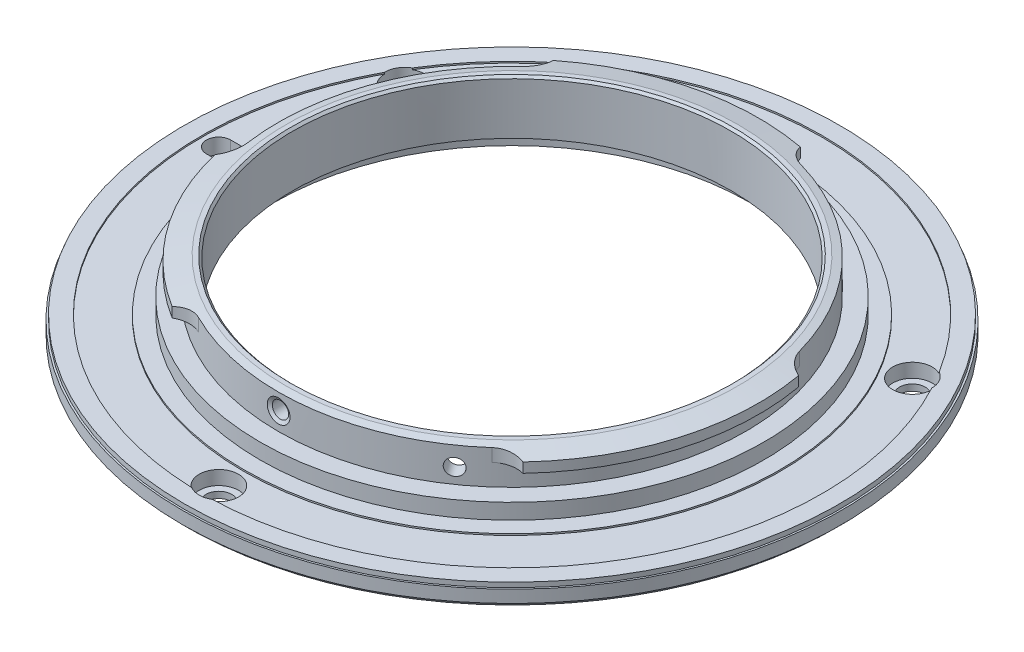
ISO-10303-21;
HEADER;
FILE_DESCRIPTION(('STEP AP214'),'2;1');
FILE_NAME('part.step','',(''),(''),'','','');
FILE_SCHEMA(('AUTOMOTIVE_DESIGN { 1 0 10303 214 1 1 1 1 }'));
ENDSEC;
DATA;
#1=APPLICATION_CONTEXT('core data for automotive mechanical design processes');
#2=APPLICATION_PROTOCOL_DEFINITION('international standard','automotive_design',2000,#1);
#3=PRODUCT_CONTEXT('',#1,'mechanical');
#4=PRODUCT('Part','Part','',(#3));
#5=PRODUCT_RELATED_PRODUCT_CATEGORY('part','',(#4));
#6=PRODUCT_DEFINITION_FORMATION('','',#4);
#7=PRODUCT_DEFINITION_CONTEXT('part definition',#1,'design');
#8=PRODUCT_DEFINITION('design','',#6,#7);
#9=PRODUCT_DEFINITION_SHAPE('','',#8);
#10=(LENGTH_UNIT() NAMED_UNIT(*) SI_UNIT(.MILLI.,.METRE.));
#11=(NAMED_UNIT(*) PLANE_ANGLE_UNIT() SI_UNIT($,.RADIAN.));
#12=(NAMED_UNIT(*) SI_UNIT($,.STERADIAN.) SOLID_ANGLE_UNIT());
#13=UNCERTAINTY_MEASURE_WITH_UNIT(LENGTH_MEASURE(1.E-05),#10,'distance_accuracy_value','');
#14=(GEOMETRIC_REPRESENTATION_CONTEXT(3) GLOBAL_UNCERTAINTY_ASSIGNED_CONTEXT((#13)) GLOBAL_UNIT_ASSIGNED_CONTEXT((#10,
#11,#12)) REPRESENTATION_CONTEXT('',''));
#15=CARTESIAN_POINT('',(0.,0.,0.));
#16=DIRECTION('',(0.,0.,1.));
#17=DIRECTION('',(1.,0.,0.));
#18=AXIS2_PLACEMENT_3D('',#15,#16,#17);
#19=CARTESIAN_POINT('',(0.,5.9944,0.));
#20=DIRECTION('',(0.,1.,0.));
#21=DIRECTION('',(0.,0.,1.));
#22=AXIS2_PLACEMENT_3D('',#19,#20,#21);
#23=CYLINDRICAL_SURFACE('',#22,17.96415);
#24=CARTESIAN_POINT('',(0.66675,4.52754999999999,17.9517723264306));
#25=CARTESIAN_POINT('',(0.666748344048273,4.56498779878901,17.9517724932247));
#26=CARTESIAN_POINT('',(0.663586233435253,4.60245241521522,17.95189069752));
#27=CARTESIAN_POINT('',(0.651016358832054,4.67634890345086,17.9523508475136));
#28=CARTESIAN_POINT('',(0.641601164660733,4.71277949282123,17.9526930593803));
#29=CARTESIAN_POINT('',(0.616794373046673,4.78352671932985,17.9535624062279));
#30=CARTESIAN_POINT('',(0.601405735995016,4.8178443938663,17.9540894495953));
#31=CARTESIAN_POINT('',(0.565093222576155,4.883399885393,17.9552689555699));
#32=CARTESIAN_POINT('',(0.544170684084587,4.91463844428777,17.9559213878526));
#33=CARTESIAN_POINT('',(0.497369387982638,4.97317791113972,17.957278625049));
#34=CARTESIAN_POINT('',(0.471487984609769,5.00047670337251,17.9579834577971));
#35=CARTESIAN_POINT('',(0.415508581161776,5.05034381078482,17.9593658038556));
#36=CARTESIAN_POINT('',(0.385410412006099,5.07291193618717,17.9600433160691));
#37=CARTESIAN_POINT('',(0.321842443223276,5.1126816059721,17.961294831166));
#38=CARTESIAN_POINT('',(0.288371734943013,5.12988169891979,17.9618688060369));
#39=CARTESIAN_POINT('',(0.219015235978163,5.15841768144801,17.9628483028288));
#40=CARTESIAN_POINT('',(0.183129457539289,5.16975360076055,17.963253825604));
#41=CARTESIAN_POINT('',(0.10997914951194,5.18623440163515,17.9638505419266));
#42=CARTESIAN_POINT('',(0.0727152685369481,5.19138215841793,17.9640418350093));
#43=CARTESIAN_POINT('',(-0.00214817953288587,5.1953493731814,17.9641888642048));
#44=CARTESIAN_POINT('',(-0.0397477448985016,5.19416886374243,17.9641446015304));
#45=CARTESIAN_POINT('',(-0.1141957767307,5.18551546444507,17.9638255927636));
#46=CARTESIAN_POINT('',(-0.151044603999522,5.17804567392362,17.9635509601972));
#47=CARTESIAN_POINT('',(-0.222964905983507,5.15703055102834,17.962802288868));
#48=CARTESIAN_POINT('',(-0.258036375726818,5.14348520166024,17.9623282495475));
#49=CARTESIAN_POINT('',(-0.325416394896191,5.11069991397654,17.9612339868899));
#50=CARTESIAN_POINT('',(-0.357724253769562,5.09145855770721,17.9606137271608));
#51=CARTESIAN_POINT('',(-0.418652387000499,5.04782849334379,17.9592969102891));
#52=CARTESIAN_POINT('',(-0.447272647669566,5.02343976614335,17.9586003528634));
#53=CARTESIAN_POINT('',(-0.500031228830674,4.9701897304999,17.9572089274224));
#54=CARTESIAN_POINT('',(-0.524166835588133,4.94132573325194,17.9565140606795));
#55=CARTESIAN_POINT('',(-0.567250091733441,4.87995397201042,17.9552047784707));
#56=CARTESIAN_POINT('',(-0.58619774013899,4.84744620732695,17.95459036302));
#57=CARTESIAN_POINT('',(-0.618366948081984,4.77970812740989,17.9535112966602));
#58=CARTESIAN_POINT('',(-0.631588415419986,4.74447776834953,17.9530466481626));
#59=CARTESIAN_POINT('',(-0.651928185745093,4.67229526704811,17.9523196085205));
#60=CARTESIAN_POINT('',(-0.659046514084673,4.63534313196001,17.9520572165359));
#61=CARTESIAN_POINT('',(-0.66697460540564,4.56078963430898,17.9517644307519));
#62=CARTESIAN_POINT('',(-0.667788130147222,4.52318867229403,17.9517338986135));
#63=CARTESIAN_POINT('',(-0.663093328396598,4.44838412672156,17.9519079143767));
#64=CARTESIAN_POINT('',(-0.657585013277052,4.41118054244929,17.9521124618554));
#65=CARTESIAN_POINT('',(-0.640406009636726,4.33823734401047,17.9527334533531));
#66=CARTESIAN_POINT('',(-0.62873703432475,4.30249732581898,17.9531498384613));
#67=CARTESIAN_POINT('',(-0.599569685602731,4.23348337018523,17.9541475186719));
#68=CARTESIAN_POINT('',(-0.582071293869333,4.20020944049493,17.9547288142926));
#69=CARTESIAN_POINT('',(-0.541732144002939,4.13705486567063,17.9559911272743));
#70=CARTESIAN_POINT('',(-0.518888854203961,4.10717583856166,17.9566721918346));
#71=CARTESIAN_POINT('',(-0.468512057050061,4.05167548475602,17.9580571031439));
#72=CARTESIAN_POINT('',(-0.440978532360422,4.02605417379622,17.9587609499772));
#73=CARTESIAN_POINT('',(-0.381986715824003,3.97978396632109,17.9601124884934));
#74=CARTESIAN_POINT('',(-0.350526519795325,3.95913749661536,17.9607601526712));
#75=CARTESIAN_POINT('',(-0.284584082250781,3.92341963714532,17.9619259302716));
#76=CARTESIAN_POINT('',(-0.250101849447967,3.90834823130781,17.9624440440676));
#77=CARTESIAN_POINT('',(-0.179103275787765,3.8842125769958,17.9632921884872));
#78=CARTESIAN_POINT('',(-0.142587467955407,3.87514676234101,17.9636222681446));
#79=CARTESIAN_POINT('',(-0.0685507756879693,3.86327450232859,17.9640573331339));
#80=CARTESIAN_POINT('',(-0.0310298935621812,3.8604680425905,17.964162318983));
#81=CARTESIAN_POINT('',(0.0439276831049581,3.8611943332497,17.9641353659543));
#82=CARTESIAN_POINT('',(0.0813644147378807,3.86472326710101,17.9640035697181));
#83=CARTESIAN_POINT('',(0.155113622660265,3.87801230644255,17.963518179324));
#84=CARTESIAN_POINT('',(0.191426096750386,3.88777242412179,17.9631645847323));
#85=CARTESIAN_POINT('',(0.26189714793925,3.9132461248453,17.9622754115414));
#86=CARTESIAN_POINT('',(0.296055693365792,3.9289597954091,17.9617398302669));
#87=CARTESIAN_POINT('',(0.361249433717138,3.96589358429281,17.9605469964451));
#88=CARTESIAN_POINT('',(0.392284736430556,3.98711351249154,17.9598897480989));
#89=CARTESIAN_POINT('',(0.450369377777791,4.03447001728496,17.9585271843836));
#90=CARTESIAN_POINT('',(0.477416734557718,4.06060902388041,17.9578218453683));
#91=CARTESIAN_POINT('',(0.526747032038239,4.11706440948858,17.9564426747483));
#92=CARTESIAN_POINT('',(0.549028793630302,4.14738181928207,17.9557688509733));
#93=CARTESIAN_POINT('',(0.588201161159,4.21134882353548,17.9545284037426));
#94=CARTESIAN_POINT('',(0.605087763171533,4.24500086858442,17.9539618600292));
#95=CARTESIAN_POINT('',(0.632951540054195,4.31463880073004,17.9530012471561));
#96=CARTESIAN_POINT('',(0.643935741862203,4.35062185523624,17.9526069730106));
#97=CARTESIAN_POINT('',(0.656780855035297,4.4102842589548,17.9521404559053));
#98=CARTESIAN_POINT('',(0.660514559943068,4.43357658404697,17.9520030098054));
#99=CARTESIAN_POINT('',(0.66549965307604,4.48042573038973,17.9518188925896));
#100=CARTESIAN_POINT('',(0.666751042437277,4.50398255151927,17.9517722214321));
#101=CARTESIAN_POINT('',(0.66675,4.52754999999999,17.9517723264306));
#102=B_SPLINE_CURVE_WITH_KNOTS('',3,(#24,#25,#26,#27,#28,#29,#30,#31,#32,#33,#34,#35,#36,#37,
#38,#39,#40,#41,#42,#43,#44,#45,#46,#47,#48,#49,#50,#51,#52,#53,#54,#55,#56,#57,#58,#59,#60,#61,
#62,#63,#64,#65,#66,#67,#68,#69,#70,#71,#72,#73,#74,#75,#76,#77,#78,#79,#80,#81,#82,#83,#84,#85,
#86,#87,#88,#89,#90,#91,#92,#93,#94,#95,#96,#97,#98,#99,#100,#101),.UNSPECIFIED.,.T.,.F.,(4,2,2,
2,2,2,2,2,2,2,2,2,2,2,2,2,2,2,2,2,2,2,2,2,2,2,2,2,2,2,2,2,2,2,2,2,2,2,4),(0.,0.112227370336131,
0.224588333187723,0.336893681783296,0.449171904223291,0.561510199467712,0.673853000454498,
0.786226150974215,0.898598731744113,1.01091908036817,1.12323885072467,1.23550330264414,
1.3477680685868,1.4600608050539,1.57235395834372,1.68471484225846,1.79707574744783,
1.90943846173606,2.02180070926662,2.13409591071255,2.24639091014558,2.35865469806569,
2.4709188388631,2.58323626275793,2.69555410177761,2.80792662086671,2.9202988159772,
3.03264169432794,3.14498431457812,3.25725928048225,3.36953446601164,3.48181130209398,
3.5940842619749,3.70641283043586,3.81876915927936,3.93120867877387,4.04351403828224,
4.11416226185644,4.18481045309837),.UNSPECIFIED.);
#103=CARTESIAN_POINT('',(0.66675,4.52754999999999,17.9517723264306));
#104=VERTEX_POINT('',#103);
#105=EDGE_CURVE('E941',#104,#104,#102,.T.);
#106=ORIENTED_EDGE('',*,*,#105,.T.);
#107=EDGE_LOOP('',(#106));
#108=FACE_BOUND('',#107,.T.);
#109=CARTESIAN_POINT('',(10.8479489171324,4.30529999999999,14.3189625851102));
#110=CARTESIAN_POINT('',(10.84794764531,4.34309408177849,14.3189636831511));
#111=CARTESIAN_POINT('',(10.8454018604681,4.38091523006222,14.3208933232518));
#112=CARTESIAN_POINT('',(10.8352762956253,4.45551493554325,14.32855580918));
#113=CARTESIAN_POINT('',(10.8276905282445,4.49229219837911,14.3342931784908));
#114=CARTESIAN_POINT('',(10.8076849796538,4.56371263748,14.3493827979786));
#115=CARTESIAN_POINT('',(10.7952675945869,4.59835686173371,14.3587332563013));
#116=CARTESIAN_POINT('',(10.7659288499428,4.66453617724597,14.3807439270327));
#117=CARTESIAN_POINT('',(10.7490085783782,4.69607201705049,14.3934033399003));
#118=CARTESIAN_POINT('',(10.7111000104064,4.7551688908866,14.4216357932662));
#119=CARTESIAN_POINT('',(10.6901095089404,4.78272775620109,14.4372104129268));
#120=CARTESIAN_POINT('',(10.644625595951,4.83307001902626,14.47077842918));
#121=CARTESIAN_POINT('',(10.6201320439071,4.85585322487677,14.4887719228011));
#122=CARTESIAN_POINT('',(10.5682960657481,4.89600212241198,14.5266249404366));
#123=CARTESIAN_POINT('',(10.5409528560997,4.91336631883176,14.5464849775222));
#124=CARTESIAN_POINT('',(10.4841707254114,4.94217463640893,14.5874629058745));
#125=CARTESIAN_POINT('',(10.4547318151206,4.95361878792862,14.6085807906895));
#126=CARTESIAN_POINT('',(10.3945887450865,4.97025696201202,14.6514358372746));
#127=CARTESIAN_POINT('',(10.3638851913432,4.97545394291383,14.673172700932));
#128=CARTESIAN_POINT('',(10.3020627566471,4.97945937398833,14.7166441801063));
#129=CARTESIAN_POINT('',(10.27094387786,4.97826785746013,14.7383787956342));
#130=CARTESIAN_POINT('',(10.2091927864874,4.96953259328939,14.7812205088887));
#131=CARTESIAN_POINT('',(10.1785603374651,4.96199203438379,14.8023279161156));
#132=CARTESIAN_POINT('',(10.1186486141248,4.94077767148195,14.8433471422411));
#133=CARTESIAN_POINT('',(10.0893693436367,4.9271038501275,14.8632589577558));
#134=CARTESIAN_POINT('',(10.0330099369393,4.89400745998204,14.9013608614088));
#135=CARTESIAN_POINT('',(10.0059303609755,4.87458343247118,14.9195505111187));
#136=CARTESIAN_POINT('',(9.95477596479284,4.83053908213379,14.9537309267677));
#137=CARTESIAN_POINT('',(9.93070115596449,4.80591873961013,14.9697216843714));
#138=CARTESIAN_POINT('',(9.88625848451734,4.75216259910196,14.9991096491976));
#139=CARTESIAN_POINT('',(9.86589290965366,4.72302403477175,15.0125052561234));
#140=CARTESIAN_POINT('',(9.82949893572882,4.66106833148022,15.0363596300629));
#141=CARTESIAN_POINT('',(9.81347053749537,4.62825119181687,15.0468183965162));
#142=CARTESIAN_POINT('',(9.78623646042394,4.55986828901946,15.0645453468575));
#143=CARTESIAN_POINT('',(9.77503086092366,4.52430248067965,15.0718134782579));
#144=CARTESIAN_POINT('',(9.75778493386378,4.45143255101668,15.0829846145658));
#145=CARTESIAN_POINT('',(9.75174458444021,4.4141284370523,15.0868876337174));
#146=CARTESIAN_POINT('',(9.74501646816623,4.33886512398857,15.0912343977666));
#147=CARTESIAN_POINT('',(9.74432544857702,4.30090633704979,15.0916802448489));
#148=CARTESIAN_POINT('',(9.74830863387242,4.22538984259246,15.0891076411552));
#149=CARTESIAN_POINT('',(9.75298282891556,4.18783213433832,15.0860891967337));
#150=CARTESIAN_POINT('',(9.76755097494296,4.11419474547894,15.076661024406));
#151=CARTESIAN_POINT('',(9.77744344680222,4.07811464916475,15.0702522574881));
#152=CARTESIAN_POINT('',(9.80214531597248,4.00844388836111,15.0541970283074));
#153=CARTESIAN_POINT('',(9.81695472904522,3.97485323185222,15.0445505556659));
#154=CARTESIAN_POINT('',(9.85104980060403,3.91109704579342,15.0222473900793));
#155=CARTESIAN_POINT('',(9.87033762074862,3.88093318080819,15.009589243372));
#156=CARTESIAN_POINT('',(9.9128051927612,3.82490354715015,14.9815761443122));
#157=CARTESIAN_POINT('',(9.93598495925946,3.79903779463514,14.966221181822));
#158=CARTESIAN_POINT('',(9.98555756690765,3.75232567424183,14.9331915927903));
#159=CARTESIAN_POINT('',(10.0119519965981,3.73148180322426,14.9155158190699));
#160=CARTESIAN_POINT('',(10.0671643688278,3.69542219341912,14.8783061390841));
#161=CARTESIAN_POINT('',(10.0959823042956,3.68020643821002,14.8587722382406));
#162=CARTESIAN_POINT('',(10.1551903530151,3.65583935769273,14.8183695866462));
#163=CARTESIAN_POINT('',(10.185580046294,3.64668642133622,14.7975011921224));
#164=CARTESIAN_POINT('',(10.247059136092,3.63469951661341,14.7549944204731));
#165=CARTESIAN_POINT('',(10.2781485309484,3.63186553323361,14.7333560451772));
#166=CARTESIAN_POINT('',(10.3401189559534,3.63259716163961,14.6899304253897));
#167=CARTESIAN_POINT('',(10.3710001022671,3.63615884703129,14.6681432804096));
#168=CARTESIAN_POINT('',(10.4317031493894,3.64957261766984,14.6250347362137));
#169=CARTESIAN_POINT('',(10.4615250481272,3.65942471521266,14.6037133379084));
#170=CARTESIAN_POINT('',(10.5192814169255,3.68513896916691,14.5621657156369));
#171=CARTESIAN_POINT('',(10.547215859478,3.70100121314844,14.5419395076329));
#172=CARTESIAN_POINT('',(10.6004309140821,3.7382845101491,14.5031939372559));
#173=CARTESIAN_POINT('',(10.625711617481,3.759705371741,14.4846745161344));
#174=CARTESIAN_POINT('',(10.6729491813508,3.80751081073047,14.4499032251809));
#175=CARTESIAN_POINT('',(10.6949043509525,3.83389789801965,14.4336525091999));
#176=CARTESIAN_POINT('',(10.7348932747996,3.8908893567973,14.4039360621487));
#177=CARTESIAN_POINT('',(10.7529260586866,3.92149476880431,14.3904710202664));
#178=CARTESIAN_POINT('',(10.7845962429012,3.98606985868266,14.3667519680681));
#179=CARTESIAN_POINT('',(10.798230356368,4.02004202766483,14.3565003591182));
#180=CARTESIAN_POINT('',(10.8207126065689,4.09034267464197,14.3395628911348));
#181=CARTESIAN_POINT('',(10.8295664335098,4.12666829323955,14.3328727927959));
#182=CARTESIAN_POINT('',(10.8399179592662,4.1869018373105,14.3250440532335));
#183=CARTESIAN_POINT('',(10.8429260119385,4.21041904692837,14.3227667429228));
#184=CARTESIAN_POINT('',(10.846941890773,4.25772059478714,14.3197256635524));
#185=CARTESIAN_POINT('',(10.8479497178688,4.28150493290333,14.3189618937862));
#186=CARTESIAN_POINT('',(10.8479489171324,4.30529999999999,14.3189625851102));
#187=B_SPLINE_CURVE_WITH_KNOTS('',3,(#109,#110,#111,#112,#113,#114,#115,#116,#117,#118,#119,
#120,#121,#122,#123,#124,#125,#126,#127,#128,#129,#130,#131,#132,#133,#134,#135,#136,#137,#138,
#139,#140,#141,#142,#143,#144,#145,#146,#147,#148,#149,#150,#151,#152,#153,#154,#155,#156,#157,
#158,#159,#160,#161,#162,#163,#164,#165,#166,#167,#168,#169,#170,#171,#172,#173,#174,#175,#176,
#177,#178,#179,#180,#181,#182,#183,#184,#185,#186),.UNSPECIFIED.,.T.,.F.,(4,2,2,2,2,2,2,2,2,2,2,
2,2,2,2,2,2,2,2,2,2,2,2,2,2,2,2,2,2,2,2,2,2,2,2,2,2,2,4),(0.,0.113295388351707,
0.226725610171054,0.340099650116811,0.453446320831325,0.566854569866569,0.680267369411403,
0.793711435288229,0.907154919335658,1.02054466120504,1.13393381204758,1.24726604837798,
1.36059860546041,1.47395993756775,1.58732169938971,1.70075314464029,1.81418461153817,
1.92761794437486,2.04105079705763,2.15441466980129,2.26777833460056,2.38110988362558,
2.49444179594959,2.60782852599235,2.72121568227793,2.83465909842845,2.94810218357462,
3.06151511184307,3.17492777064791,3.28827082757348,3.40161410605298,3.51495903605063,
3.62830006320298,3.74169852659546,3.85512501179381,3.96863605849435,4.08201168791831,
4.15334223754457,4.22467275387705),.UNSPECIFIED.);
#188=CARTESIAN_POINT('',(10.8479489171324,4.30529999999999,14.3189625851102));
#189=VERTEX_POINT('',#188);
#190=EDGE_CURVE('E406',#189,#189,#187,.T.);
#191=ORIENTED_EDGE('',*,*,#190,.T.);
#192=EDGE_LOOP('',(#191));
#193=FACE_BOUND('',#192,.T.);
#194=CARTESIAN_POINT('',(0.,5.81479487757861,0.));
#195=DIRECTION('',(0.,1.,0.));
#196=DIRECTION('',(0.,0.,1.));
#197=AXIS2_PLACEMENT_3D('',#194,#195,#196);
#198=CIRCLE('',#197,17.96415);
#199=CARTESIAN_POINT('',(0.,5.81479487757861,17.96415));
#200=VERTEX_POINT('',#199);
#201=EDGE_CURVE('E277',#200,#200,#198,.T.);
#202=ORIENTED_EDGE('',*,*,#201,.T.);
#203=EDGE_LOOP('',(#202));
#204=FACE_BOUND('',#203,.T.);
#205=CARTESIAN_POINT('',(0.,1.5875,0.));
#206=DIRECTION('',(0.,-1.,0.));
#207=DIRECTION('',(0.,0.,-1.));
#208=AXIS2_PLACEMENT_3D('',#205,#206,#207);
#209=CIRCLE('',#208,17.96415);
#210=CARTESIAN_POINT('',(0.,1.5875,-17.96415));
#211=VERTEX_POINT('',#210);
#212=EDGE_CURVE('E392',#211,#211,#209,.T.);
#213=ORIENTED_EDGE('',*,*,#212,.T.);
#214=EDGE_LOOP('',(#213));
#215=FACE_BOUND('',#214,.T.);
#216=ADVANCED_FACE('F46',(#108,#193,#204,#215),#23,.F.);
#217=CARTESIAN_POINT('',(0.,5.9944,0.));
#218=DIRECTION('',(0.,1.,0.));
#219=DIRECTION('',(0.,0.,1.));
#220=AXIS2_PLACEMENT_3D('',#217,#218,#219);
#221=CYLINDRICAL_SURFACE('',#220,25.4);
#222=DIRECTION('',(0.,1.,0.));
#223=VECTOR('',#222,1.);
#224=CARTESIAN_POINT('',(21.5707515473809,1.15569999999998,-13.411289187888));
#225=LINE('',#224,#223);
#226=CARTESIAN_POINT('',(21.570751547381,1.79069999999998,-13.411289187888));
#227=VERTEX_POINT('',#226);
#228=CARTESIAN_POINT('',(21.570751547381,1.66369999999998,-13.411289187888));
#229=VERTEX_POINT('',#228);
#230=EDGE_CURVE('E61',#227,#229,#225,.F.);
#231=ORIENTED_EDGE('',*,*,#230,.F.);
#232=CARTESIAN_POINT('',(0.,1.79069999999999,0.));
#233=DIRECTION('',(0.,1.,0.));
#234=DIRECTION('',(0.,0.,1.));
#235=AXIS2_PLACEMENT_3D('',#232,#233,#234);
#236=CIRCLE('',#235,25.4);
#237=CARTESIAN_POINT('',(-21.570751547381,1.79069999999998,-13.411289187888));
#238=VERTEX_POINT('',#237);
#239=EDGE_CURVE('E214',#227,#238,#236,.T.);
#240=ORIENTED_EDGE('',*,*,#239,.T.);
#241=DIRECTION('',(0.,1.,0.));
#242=VECTOR('',#241,1.);
#243=CARTESIAN_POINT('',(-21.5707515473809,1.15569999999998,-13.411289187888));
#244=LINE('',#243,#242);
#245=CARTESIAN_POINT('',(-21.5707515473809,1.66369999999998,-13.4112891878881));
#246=VERTEX_POINT('',#245);
#247=EDGE_CURVE('E376',#246,#238,#244,.T.);
#248=ORIENTED_EDGE('',*,*,#247,.F.);
#249=CARTESIAN_POINT('',(0.,1.66369999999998,0.));
#250=DIRECTION('',(0.,1.,0.));
#251=DIRECTION('',(0.,0.,1.));
#252=AXIS2_PLACEMENT_3D('',#249,#250,#251);
#253=CIRCLE('',#252,25.4);
#254=EDGE_CURVE('E232',#229,#246,#253,.T.);
#255=ORIENTED_EDGE('',*,*,#254,.F.);
#256=EDGE_LOOP('',(#231,#240,#248,#255));
#257=FACE_BOUND('',#256,.T.);
#258=ADVANCED_FACE('F451',(#257),#221,.F.);
#259=CARTESIAN_POINT('',(20.7872077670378,0.,-12.0015000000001));
#260=DIRECTION('',(0.,1.,0.));
#261=DIRECTION('',(0.,0.,1.));
#262=AXIS2_PLACEMENT_3D('',#259,#260,#261);
#263=CYLINDRICAL_SURFACE('',#262,1.04774999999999);
#264=CARTESIAN_POINT('',(20.7872077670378,0.,-12.0015000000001));
#265=DIRECTION('',(0.,1.,0.));
#266=DIRECTION('',(0.,0.,1.));
#267=AXIS2_PLACEMENT_3D('',#264,#265,#266);
#268=CIRCLE('',#267,1.04774999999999);
#269=CARTESIAN_POINT('',(20.7872077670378,0.,-10.9537500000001));
#270=VERTEX_POINT('',#269);
#271=EDGE_CURVE('E361',#270,#270,#268,.T.);
#272=ORIENTED_EDGE('',*,*,#271,.F.);
#273=EDGE_LOOP('',(#272));
#274=FACE_BOUND('',#273,.T.);
#275=CARTESIAN_POINT('',(20.7872077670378,0.520699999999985,-12.0015000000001));
#276=DIRECTION('',(0.,1.,0.));
#277=DIRECTION('',(0.,0.,1.));
#278=AXIS2_PLACEMENT_3D('',#275,#276,#277);
#279=CIRCLE('',#278,1.04774999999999);
#280=CARTESIAN_POINT('',(20.7872077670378,0.520699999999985,-10.9537500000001));
#281=VERTEX_POINT('',#280);
#282=EDGE_CURVE('E215',#281,#281,#279,.T.);
#283=ORIENTED_EDGE('',*,*,#282,.T.);
#284=EDGE_LOOP('',(#283));
#285=FACE_BOUND('',#284,.T.);
#286=ADVANCED_FACE('F447',(#274,#285),#263,.F.);
#287=DIRECTION('',(0.,1.,0.));
#288=VECTOR('',#287,1.);
#289=CARTESIAN_POINT('',(-22.399892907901,1.15569999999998,-11.9751742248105));
#290=LINE('',#289,#288);
#291=CARTESIAN_POINT('',(-22.399892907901,1.79069999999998,-11.9751742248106));
#292=VERTEX_POINT('',#291);
#293=CARTESIAN_POINT('',(-22.399892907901,1.66369999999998,-11.9751742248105));
#294=VERTEX_POINT('',#293);
#295=EDGE_CURVE('E69',#292,#294,#290,.F.);
#296=ORIENTED_EDGE('',*,*,#295,.F.);
#297=CARTESIAN_POINT('',(-0.829141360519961,1.79069999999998,25.3864634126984));
#298=VERTEX_POINT('',#297);
#299=EDGE_CURVE('E222',#292,#298,#236,.T.);
#300=ORIENTED_EDGE('',*,*,#299,.T.);
#301=DIRECTION('',(0.,1.,0.));
#302=VECTOR('',#301,1.);
#303=CARTESIAN_POINT('',(-0.829141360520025,1.15569999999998,25.3864634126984));
#304=LINE('',#303,#302);
#305=CARTESIAN_POINT('',(-0.829141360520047,1.66369999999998,25.3864634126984));
#306=VERTEX_POINT('',#305);
#307=EDGE_CURVE('E365',#306,#298,#304,.T.);
#308=ORIENTED_EDGE('',*,*,#307,.F.);
#309=EDGE_CURVE('E233',#294,#306,#253,.T.);
#310=ORIENTED_EDGE('',*,*,#309,.F.);
#311=EDGE_LOOP('',(#296,#300,#308,#310));
#312=FACE_BOUND('',#311,.T.);
#313=ADVANCED_FACE('F450',(#312),#221,.F.);
#314=CARTESIAN_POINT('',(-20.7872077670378,0.,-12.0015000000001));
#315=DIRECTION('',(0.,1.,0.));
#316=DIRECTION('',(0.,0.,1.));
#317=AXIS2_PLACEMENT_3D('',#314,#315,#316);
#318=CYLINDRICAL_SURFACE('',#317,1.04775000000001);
#319=CARTESIAN_POINT('',(-20.7872077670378,0.,-12.0015000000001));
#320=DIRECTION('',(0.,1.,0.));
#321=DIRECTION('',(0.,0.,1.));
#322=AXIS2_PLACEMENT_3D('',#319,#320,#321);
#323=CIRCLE('',#322,1.04775000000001);
#324=CARTESIAN_POINT('',(-20.7872077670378,0.,-10.9537500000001));
#325=VERTEX_POINT('',#324);
#326=EDGE_CURVE('E358',#325,#325,#323,.T.);
#327=ORIENTED_EDGE('',*,*,#326,.F.);
#328=EDGE_LOOP('',(#327));
#329=FACE_BOUND('',#328,.T.);
#330=CARTESIAN_POINT('',(-20.7872077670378,0.520699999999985,-12.0015000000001));
#331=DIRECTION('',(0.,1.,0.));
#332=DIRECTION('',(0.,0.,1.));
#333=AXIS2_PLACEMENT_3D('',#330,#331,#332);
#334=CIRCLE('',#333,1.04775000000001);
#335=CARTESIAN_POINT('',(-20.7872077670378,0.520699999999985,-10.9537500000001));
#336=VERTEX_POINT('',#335);
#337=EDGE_CURVE('E382',#336,#336,#334,.T.);
#338=ORIENTED_EDGE('',*,*,#337,.T.);
#339=EDGE_LOOP('',(#338));
#340=FACE_BOUND('',#339,.T.);
#341=ADVANCED_FACE('F453',(#329,#340),#318,.F.);
#342=CARTESIAN_POINT('',(0.,0.,24.003));
#343=DIRECTION('',(0.,1.,0.));
#344=DIRECTION('',(0.,0.,1.));
#345=AXIS2_PLACEMENT_3D('',#342,#343,#344);
#346=CYLINDRICAL_SURFACE('',#345,1.04775);
#347=CARTESIAN_POINT('',(0.,0.,24.003));
#348=DIRECTION('',(0.,1.,0.));
#349=DIRECTION('',(0.,0.,1.));
#350=AXIS2_PLACEMENT_3D('',#347,#348,#349);
#351=CIRCLE('',#350,1.04775);
#352=CARTESIAN_POINT('',(0.,0.,25.05075));
#353=VERTEX_POINT('',#352);
#354=EDGE_CURVE('E355',#353,#353,#351,.T.);
#355=ORIENTED_EDGE('',*,*,#354,.F.);
#356=EDGE_LOOP('',(#355));
#357=FACE_BOUND('',#356,.T.);
#358=CARTESIAN_POINT('',(0.,0.520699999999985,24.003));
#359=DIRECTION('',(0.,1.,0.));
#360=DIRECTION('',(0.,0.,1.));
#361=AXIS2_PLACEMENT_3D('',#358,#359,#360);
#362=CIRCLE('',#361,1.04775);
#363=CARTESIAN_POINT('',(0.,0.520699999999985,25.05075));
#364=VERTEX_POINT('',#363);
#365=EDGE_CURVE('E370',#364,#364,#362,.T.);
#366=ORIENTED_EDGE('',*,*,#365,.T.);
#367=EDGE_LOOP('',(#366));
#368=FACE_BOUND('',#367,.T.);
#369=ADVANCED_FACE('F456',(#357,#368),#346,.F.);
#370=CARTESIAN_POINT('',(0.,4.81329999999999,19.13255));
#371=DIRECTION('',(0.,-1.,0.));
#372=DIRECTION('',(0.,0.,-1.));
#373=AXIS2_PLACEMENT_3D('',#370,#371,#372);
#374=PLANE('',#373);
#375=CARTESIAN_POINT('',(-9.53959524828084,4.81329999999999,19.0987725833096));
#376=DIRECTION('',(0.,1.,0.));
#377=DIRECTION('',(0.,0.,1.));
#378=AXIS2_PLACEMENT_3D('',#375,#376,#377);
#379=CIRCLE('',#378,2.21615);
#380=CARTESIAN_POINT('',(-8.54931602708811,4.81329999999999,17.116181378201));
#381=VERTEX_POINT('',#380);
#382=CARTESIAN_POINT('',(-10.6481034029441,4.81329999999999,17.1797805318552));
#383=VERTEX_POINT('',#382);
#384=EDGE_CURVE('E333',#381,#383,#379,.T.);
#385=ORIENTED_EDGE('',*,*,#384,.T.);
#386=CARTESIAN_POINT('',(0.,4.81329999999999,0.));
#387=DIRECTION('',(0.,1.,0.));
#388=DIRECTION('',(0.,0.,1.));
#389=AXIS2_PLACEMENT_3D('',#386,#387,#388);
#390=CIRCLE('',#389,20.21205);
#391=CARTESIAN_POINT('',(-19.6706850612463,4.81329999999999,4.64662398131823));
#392=VERTEX_POINT('',#391);
#393=EDGE_CURVE('E261',#392,#383,#390,.T.);
#394=ORIENTED_EDGE('',*,*,#393,.F.);
#395=CARTESIAN_POINT('',(-21.1387758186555,4.81329999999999,2.98649436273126));
#396=DIRECTION('',(0.,1.,0.));
#397=DIRECTION('',(0.,0.,1.));
#398=AXIS2_PLACEMENT_3D('',#395,#396,#397);
#399=CIRCLE('',#398,2.21615);
#400=CARTESIAN_POINT('',(-18.9444174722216,4.81329999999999,2.67647457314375));
#401=VERTEX_POINT('',#400);
#402=EDGE_CURVE('E295',#392,#401,#399,.T.);
#403=ORIENTED_EDGE('',*,*,#402,.T.);
#404=CARTESIAN_POINT('',(0.,4.81329999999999,0.));
#405=DIRECTION('',(0.,1.,0.));
#406=DIRECTION('',(0.,0.,1.));
#407=AXIS2_PLACEMENT_3D('',#404,#405,#406);
#408=CIRCLE('',#407,19.13255);
#409=EDGE_CURVE('E256',#401,#381,#408,.T.);
#410=ORIENTED_EDGE('',*,*,#409,.T.);
#411=EDGE_LOOP('',(#385,#394,#403,#410));
#412=FACE_BOUND('',#411,.T.);
#413=ADVANCED_FACE('F460',(#412),#374,.T.);
#414=CARTESIAN_POINT('',(0.,5.9944,0.));
#415=DIRECTION('',(0.,1.,0.));
#416=DIRECTION('',(0.,0.,1.));
#417=AXIS2_PLACEMENT_3D('',#414,#415,#416);
#418=CYLINDRICAL_SURFACE('',#417,20.21205);
#419=DIRECTION('',(0.,1.,0.));
#420=VECTOR('',#419,1.);
#421=CARTESIAN_POINT('',(-10.6481034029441,5.40384999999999,17.1797805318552));
#422=LINE('',#421,#420);
#423=CARTESIAN_POINT('',(-10.6481034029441,5.62033573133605,17.1797805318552));
#424=VERTEX_POINT('',#423);
#425=EDGE_CURVE('E320',#424,#383,#422,.F.);
#426=ORIENTED_EDGE('',*,*,#425,.F.);
#427=CARTESIAN_POINT('',(0.,5.62033573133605,0.));
#428=DIRECTION('',(0.,1.,0.));
#429=DIRECTION('',(0.,0.,1.));
#430=AXIS2_PLACEMENT_3D('',#427,#428,#429);
#431=CIRCLE('',#430,20.21205);
#432=CARTESIAN_POINT('',(-19.6706850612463,5.62033573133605,4.64662398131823));
#433=VERTEX_POINT('',#432);
#434=EDGE_CURVE('E266',#433,#424,#431,.T.);
#435=ORIENTED_EDGE('',*,*,#434,.F.);
#436=DIRECTION('',(0.,1.,0.));
#437=VECTOR('',#436,1.);
#438=CARTESIAN_POINT('',(-19.6706850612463,5.21681786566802,4.64662398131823));
#439=LINE('',#438,#437);
#440=EDGE_CURVE('E289',#392,#433,#439,.T.);
#441=ORIENTED_EDGE('',*,*,#440,.F.);
#442=ORIENTED_EDGE('',*,*,#393,.T.);
#443=EDGE_LOOP('',(#426,#435,#441,#442));
#444=FACE_BOUND('',#443,.T.);
#445=ADVANCED_FACE('F700',(#444),#418,.T.);
#446=CARTESIAN_POINT('',(14.1576675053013,4.81329999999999,15.9789687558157));
#447=DIRECTION('',(0.,1.,0.));
#448=DIRECTION('',(0.,0.,1.));
#449=AXIS2_PLACEMENT_3D('',#446,#447,#448);
#450=CIRCLE('',#449,2.21615);
#451=CARTESIAN_POINT('',(14.7317324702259,4.81329999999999,13.8384617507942));
#452=VERTEX_POINT('',#451);
#453=CARTESIAN_POINT('',(12.687998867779,4.81329999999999,14.3202358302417));
#454=VERTEX_POINT('',#453);
#455=EDGE_CURVE('E328',#452,#454,#450,.T.);
#456=ORIENTED_EDGE('',*,*,#455,.T.);
#457=CARTESIAN_POINT('',(18.4404106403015,4.81329999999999,-5.09958085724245));
#458=VERTEX_POINT('',#457);
#459=EDGE_CURVE('E259',#454,#458,#408,.T.);
#460=ORIENTED_EDGE('',*,*,#459,.T.);
#461=CARTESIAN_POINT('',(20.5763891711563,4.81329999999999,-5.69027243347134));
#462=DIRECTION('',(0.,1.,0.));
#463=DIRECTION('',(0.,0.,1.));
#464=AXIS2_PLACEMENT_3D('',#461,#462,#463);
#465=CIRCLE('',#464,2.21615);
#466=CARTESIAN_POINT('',(19.8920368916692,4.81329999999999,-3.58243401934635));
#467=VERTEX_POINT('',#466);
#468=EDGE_CURVE('E317',#458,#467,#465,.T.);
#469=ORIENTED_EDGE('',*,*,#468,.T.);
#470=EDGE_CURVE('E264',#452,#467,#390,.T.);
#471=ORIENTED_EDGE('',*,*,#470,.F.);
#472=EDGE_LOOP('',(#456,#460,#469,#471));
#473=FACE_BOUND('',#472,.T.);
#474=ADVANCED_FACE('F723',(#473),#374,.T.);
#475=DIRECTION('',(0.,1.,0.));
#476=VECTOR('',#475,1.);
#477=CARTESIAN_POINT('',(14.7317324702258,5.21681786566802,13.8384617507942));
#478=LINE('',#477,#476);
#479=CARTESIAN_POINT('',(14.7317324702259,5.62033573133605,13.8384617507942));
#480=VERTEX_POINT('',#479);
#481=EDGE_CURVE('E322',#452,#480,#478,.T.);
#482=ORIENTED_EDGE('',*,*,#481,.F.);
#483=ORIENTED_EDGE('',*,*,#470,.T.);
#484=DIRECTION('',(0.,1.,0.));
#485=VECTOR('',#484,1.);
#486=CARTESIAN_POINT('',(19.8920368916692,5.40384999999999,-3.58243401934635));
#487=LINE('',#486,#485);
#488=CARTESIAN_POINT('',(19.8920368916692,5.62033573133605,-3.58243401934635));
#489=VERTEX_POINT('',#488);
#490=EDGE_CURVE('E303',#489,#467,#487,.F.);
#491=ORIENTED_EDGE('',*,*,#490,.F.);
#492=EDGE_CURVE('E269',#480,#489,#431,.T.);
#493=ORIENTED_EDGE('',*,*,#492,.F.);
#494=EDGE_LOOP('',(#482,#483,#491,#493));
#495=FACE_BOUND('',#494,.T.);
#496=ADVANCED_FACE('F632',(#495),#418,.T.);
#497=CARTESIAN_POINT('',(0.,5.9944,0.));
#498=DIRECTION('',(0.,1.,0.));
#499=DIRECTION('',(0.,0.,1.));
#500=AXIS2_PLACEMENT_3D('',#497,#498,#499);
#501=CYLINDRICAL_SURFACE('',#500,26.84145);
#502=CARTESIAN_POINT('',(0.,1.39699999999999,0.));
#503=DIRECTION('',(0.,1.,0.));
#504=DIRECTION('',(0.,0.,1.));
#505=AXIS2_PLACEMENT_3D('',#502,#503,#504);
#506=CIRCLE('',#505,26.84145);
#507=CARTESIAN_POINT('',(0.,1.39699999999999,26.84145));
#508=VERTEX_POINT('',#507);
#509=EDGE_CURVE('E283',#508,#508,#506,.T.);
#510=ORIENTED_EDGE('',*,*,#509,.T.);
#511=EDGE_LOOP('',(#510));
#512=FACE_BOUND('',#511,.T.);
#513=CARTESIAN_POINT('',(0.,1.79069999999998,0.));
#514=DIRECTION('',(0.,1.,0.));
#515=DIRECTION('',(0.,0.,1.));
#516=AXIS2_PLACEMENT_3D('',#513,#514,#515);
#517=CIRCLE('',#516,26.84145);
#518=CARTESIAN_POINT('',(0.,1.79069999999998,26.84145));
#519=VERTEX_POINT('',#518);
#520=EDGE_CURVE('E220',#519,#519,#517,.T.);
#521=ORIENTED_EDGE('',*,*,#520,.F.);
#522=EDGE_LOOP('',(#521));
#523=FACE_BOUND('',#522,.T.);
#524=ADVANCED_FACE('F630',(#512,#523),#501,.T.);
#525=CARTESIAN_POINT('',(0.,1.79069999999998,26.84145));
#526=DIRECTION('',(0.,1.,0.));
#527=DIRECTION('',(0.,0.,1.));
#528=AXIS2_PLACEMENT_3D('',#525,#526,#527);
#529=PLANE('',#528);
#530=CARTESIAN_POINT('',(20.7872077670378,1.79069999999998,-12.0015000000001));
#531=DIRECTION('',(0.,1.,0.));
#532=DIRECTION('',(0.,0.,1.));
#533=AXIS2_PLACEMENT_3D('',#530,#531,#532);
#534=CIRCLE('',#533,1.61289999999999);
#535=CARTESIAN_POINT('',(22.3998929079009,1.79069999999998,-11.9751742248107));
#536=VERTEX_POINT('',#535);
#537=EDGE_CURVE('E198',#536,#227,#534,.T.);
#538=ORIENTED_EDGE('',*,*,#537,.F.);
#539=CARTESIAN_POINT('',(0.829141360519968,1.79069999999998,25.3864634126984));
#540=VERTEX_POINT('',#539);
#541=EDGE_CURVE('E212',#540,#536,#236,.T.);
#542=ORIENTED_EDGE('',*,*,#541,.F.);
#543=CARTESIAN_POINT('',(0.,1.79069999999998,24.003));
#544=DIRECTION('',(0.,1.,0.));
#545=DIRECTION('',(0.,0.,1.));
#546=AXIS2_PLACEMENT_3D('',#543,#544,#545);
#547=CIRCLE('',#546,1.6129);
#548=EDGE_CURVE('E368',#298,#540,#547,.T.);
#549=ORIENTED_EDGE('',*,*,#548,.F.);
#550=ORIENTED_EDGE('',*,*,#299,.F.);
#551=CARTESIAN_POINT('',(-20.7872077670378,1.79069999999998,-12.0015000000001));
#552=DIRECTION('',(0.,1.,0.));
#553=DIRECTION('',(0.,0.,1.));
#554=AXIS2_PLACEMENT_3D('',#551,#552,#553);
#555=CIRCLE('',#554,1.61290000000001);
#556=EDGE_CURVE('E380',#238,#292,#555,.T.);
#557=ORIENTED_EDGE('',*,*,#556,.F.);
#558=ORIENTED_EDGE('',*,*,#239,.F.);
#559=EDGE_LOOP('',(#538,#542,#549,#550,#557,#558));
#560=FACE_BOUND('',#559,.T.);
#561=ORIENTED_EDGE('',*,*,#520,.T.);
#562=EDGE_LOOP('',(#561));
#563=FACE_BOUND('',#562,.T.);
#564=ADVANCED_FACE('F209',(#560,#563),#529,.T.);
#565=DIRECTION('',(0.,1.,0.));
#566=VECTOR('',#565,1.);
#567=CARTESIAN_POINT('',(22.3998929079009,1.15569999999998,-11.9751742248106));
#568=LINE('',#567,#566);
#569=CARTESIAN_POINT('',(22.3998929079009,1.66369999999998,-11.9751742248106));
#570=VERTEX_POINT('',#569);
#571=EDGE_CURVE('E194',#570,#536,#568,.T.);
#572=ORIENTED_EDGE('',*,*,#571,.F.);
#573=CARTESIAN_POINT('',(0.829141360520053,1.66369999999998,25.3864634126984));
#574=VERTEX_POINT('',#573);
#575=EDGE_CURVE('E227',#574,#570,#253,.T.);
#576=ORIENTED_EDGE('',*,*,#575,.F.);
#577=DIRECTION('',(0.,1.,0.));
#578=VECTOR('',#577,1.);
#579=CARTESIAN_POINT('',(0.829141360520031,1.15569999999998,25.3864634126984));
#580=LINE('',#579,#578);
#581=EDGE_CURVE('E219',#540,#574,#580,.F.);
#582=ORIENTED_EDGE('',*,*,#581,.F.);
#583=ORIENTED_EDGE('',*,*,#541,.T.);
#584=EDGE_LOOP('',(#572,#576,#582,#583));
#585=FACE_BOUND('',#584,.T.);
#586=ADVANCED_FACE('F218',(#585),#221,.F.);
#587=CARTESIAN_POINT('',(0.,1.66369999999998,25.4));
#588=DIRECTION('',(0.,1.,0.));
#589=DIRECTION('',(0.,0.,1.));
#590=AXIS2_PLACEMENT_3D('',#587,#588,#589);
#591=PLANE('',#590);
#592=CARTESIAN_POINT('',(20.7872077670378,1.66369999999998,-12.0015000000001));
#593=DIRECTION('',(0.,1.,0.));
#594=DIRECTION('',(0.,0.,1.));
#595=AXIS2_PLACEMENT_3D('',#592,#593,#594);
#596=CIRCLE('',#595,1.61289999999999);
#597=EDGE_CURVE('E199',#229,#570,#596,.T.);
#598=ORIENTED_EDGE('',*,*,#597,.F.);
#599=ORIENTED_EDGE('',*,*,#254,.T.);
#600=CARTESIAN_POINT('',(-20.7872077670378,1.66369999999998,-12.0015000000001));
#601=DIRECTION('',(0.,1.,0.));
#602=DIRECTION('',(0.,0.,1.));
#603=AXIS2_PLACEMENT_3D('',#600,#601,#602);
#604=CIRCLE('',#603,1.61290000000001);
#605=EDGE_CURVE('E665',#294,#246,#604,.T.);
#606=ORIENTED_EDGE('',*,*,#605,.F.);
#607=ORIENTED_EDGE('',*,*,#309,.T.);
#608=CARTESIAN_POINT('',(0.,1.66369999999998,24.003));
#609=DIRECTION('',(0.,1.,0.));
#610=DIRECTION('',(0.,0.,1.));
#611=AXIS2_PLACEMENT_3D('',#608,#609,#610);
#612=CIRCLE('',#611,1.6129);
#613=EDGE_CURVE('E666',#574,#306,#612,.T.);
#614=ORIENTED_EDGE('',*,*,#613,.F.);
#615=ORIENTED_EDGE('',*,*,#575,.T.);
#616=EDGE_LOOP('',(#598,#599,#606,#607,#614,#615));
#617=FACE_BOUND('',#616,.T.);
#618=DIRECTION('',(-1.,0.,0.));
#619=VECTOR('',#618,1.);
#620=CARTESIAN_POINT('',(0.,1.66369999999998,-0.990599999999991));
#621=LINE('',#620,#619);
#622=CARTESIAN_POINT('',(-23.2791,1.66369999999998,-0.990599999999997));
#623=VERTEX_POINT('',#622);
#624=CARTESIAN_POINT('',(-24.0284,1.66369999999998,-0.990599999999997));
#625=VERTEX_POINT('',#624);
#626=EDGE_CURVE('E668',#623,#625,#621,.T.);
#627=ORIENTED_EDGE('',*,*,#626,.F.);
#628=CARTESIAN_POINT('',(-23.2791,1.66369999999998,0.));
#629=DIRECTION('',(0.,1.,0.));
#630=DIRECTION('',(0.,0.,1.));
#631=AXIS2_PLACEMENT_3D('',#628,#629,#630);
#632=CIRCLE('',#631,0.9906);
#633=CARTESIAN_POINT('',(-23.2791,1.66369999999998,0.990600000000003));
#634=VERTEX_POINT('',#633);
#635=EDGE_CURVE('E673',#634,#623,#632,.T.);
#636=ORIENTED_EDGE('',*,*,#635,.F.);
#637=DIRECTION('',(-1.,0.,0.));
#638=VECTOR('',#637,1.);
#639=CARTESIAN_POINT('',(0.,1.66369999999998,0.990599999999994));
#640=LINE('',#639,#638);
#641=CARTESIAN_POINT('',(-24.0284,1.66369999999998,0.990600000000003));
#642=VERTEX_POINT('',#641);
#643=EDGE_CURVE('E676',#634,#642,#640,.T.);
#644=ORIENTED_EDGE('',*,*,#643,.T.);
#645=CARTESIAN_POINT('',(-24.0284,1.66369999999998,0.));
#646=DIRECTION('',(0.,1.,0.));
#647=DIRECTION('',(0.,0.,1.));
#648=AXIS2_PLACEMENT_3D('',#645,#646,#647);
#649=CIRCLE('',#648,0.9906);
#650=EDGE_CURVE('E679',#625,#642,#649,.T.);
#651=ORIENTED_EDGE('',*,*,#650,.F.);
#652=EDGE_LOOP('',(#627,#636,#644,#651));
#653=FACE_BOUND('',#652,.T.);
#654=CARTESIAN_POINT('',(0.,1.66369999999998,0.));
#655=DIRECTION('',(0.,1.,0.));
#656=DIRECTION('',(0.,0.,1.));
#657=AXIS2_PLACEMENT_3D('',#654,#655,#656);
#658=CIRCLE('',#657,21.9837);
#659=CARTESIAN_POINT('',(0.,1.66369999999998,21.9837));
#660=VERTEX_POINT('',#659);
#661=EDGE_CURVE('E237',#660,#660,#658,.T.);
#662=ORIENTED_EDGE('',*,*,#661,.F.);
#663=EDGE_LOOP('',(#662));
#664=FACE_BOUND('',#663,.T.);
#665=ADVANCED_FACE('F623',(#617,#653,#664),#591,.T.);
#666=CARTESIAN_POINT('',(0.,5.9944,0.));
#667=DIRECTION('',(0.,1.,0.));
#668=DIRECTION('',(0.,0.,1.));
#669=AXIS2_PLACEMENT_3D('',#666,#667,#668);
#670=CYLINDRICAL_SURFACE('',#669,21.9837);
#671=ORIENTED_EDGE('',*,*,#661,.T.);
#672=EDGE_LOOP('',(#671));
#673=FACE_BOUND('',#672,.T.);
#674=CARTESIAN_POINT('',(0.,1.79069999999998,0.));
#675=DIRECTION('',(0.,1.,0.));
#676=DIRECTION('',(0.,0.,1.));
#677=AXIS2_PLACEMENT_3D('',#674,#675,#676);
#678=CIRCLE('',#677,21.9837);
#679=CARTESIAN_POINT('',(0.,1.79069999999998,21.9837));
#680=VERTEX_POINT('',#679);
#681=EDGE_CURVE('E241',#680,#680,#678,.T.);
#682=ORIENTED_EDGE('',*,*,#681,.F.);
#683=EDGE_LOOP('',(#682));
#684=FACE_BOUND('',#683,.T.);
#685=ADVANCED_FACE('F619',(#673,#684),#670,.T.);
#686=CARTESIAN_POINT('',(0.,1.79069999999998,21.9837));
#687=DIRECTION('',(0.,1.,0.));
#688=DIRECTION('',(0.,0.,1.));
#689=AXIS2_PLACEMENT_3D('',#686,#687,#688);
#690=PLANE('',#689);
#691=ORIENTED_EDGE('',*,*,#681,.T.);
#692=EDGE_LOOP('',(#691));
#693=FACE_BOUND('',#692,.T.);
#694=CARTESIAN_POINT('',(0.,1.79069999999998,0.));
#695=DIRECTION('',(0.,1.,0.));
#696=DIRECTION('',(0.,0.,1.));
#697=AXIS2_PLACEMENT_3D('',#694,#695,#696);
#698=CIRCLE('',#697,20.63115);
#699=CARTESIAN_POINT('',(0.,1.79069999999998,20.63115));
#700=VERTEX_POINT('',#699);
#701=EDGE_CURVE('E245',#700,#700,#698,.T.);
#702=ORIENTED_EDGE('',*,*,#701,.F.);
#703=EDGE_LOOP('',(#702));
#704=FACE_BOUND('',#703,.T.);
#705=ADVANCED_FACE('F615',(#693,#704),#690,.T.);
#706=CARTESIAN_POINT('',(0.,5.9944,0.));
#707=DIRECTION('',(0.,1.,0.));
#708=DIRECTION('',(0.,0.,1.));
#709=AXIS2_PLACEMENT_3D('',#706,#707,#708);
#710=CYLINDRICAL_SURFACE('',#709,20.63115);
#711=ORIENTED_EDGE('',*,*,#701,.T.);
#712=EDGE_LOOP('',(#711));
#713=FACE_BOUND('',#712,.T.);
#714=CARTESIAN_POINT('',(0.,3.06069999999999,0.));
#715=DIRECTION('',(0.,1.,0.));
#716=DIRECTION('',(0.,0.,1.));
#717=AXIS2_PLACEMENT_3D('',#714,#715,#716);
#718=CIRCLE('',#717,20.63115);
#719=CARTESIAN_POINT('',(0.,3.06069999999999,20.63115));
#720=VERTEX_POINT('',#719);
#721=EDGE_CURVE('E250',#720,#720,#718,.T.);
#722=ORIENTED_EDGE('',*,*,#721,.F.);
#723=EDGE_LOOP('',(#722));
#724=FACE_BOUND('',#723,.T.);
#725=ADVANCED_FACE('F611',(#713,#724),#710,.T.);
#726=CARTESIAN_POINT('',(0.,3.06069999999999,20.63115));
#727=DIRECTION('',(0.,1.,0.));
#728=DIRECTION('',(0.,0.,1.));
#729=AXIS2_PLACEMENT_3D('',#726,#727,#728);
#730=PLANE('',#729);
#731=ORIENTED_EDGE('',*,*,#721,.T.);
#732=EDGE_LOOP('',(#731));
#733=FACE_BOUND('',#732,.T.);
#734=CARTESIAN_POINT('',(0.,3.06069999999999,0.));
#735=DIRECTION('',(0.,1.,0.));
#736=DIRECTION('',(0.,0.,1.));
#737=AXIS2_PLACEMENT_3D('',#734,#735,#736);
#738=CIRCLE('',#737,19.13255);
#739=CARTESIAN_POINT('',(0.,3.06069999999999,19.13255));
#740=VERTEX_POINT('',#739);
#741=EDGE_CURVE('E253',#740,#740,#738,.T.);
#742=ORIENTED_EDGE('',*,*,#741,.F.);
#743=EDGE_LOOP('',(#742));
#744=FACE_BOUND('',#743,.T.);
#745=ADVANCED_FACE('F608',(#733,#744),#730,.T.);
#746=CARTESIAN_POINT('',(0.,5.9944,0.));
#747=DIRECTION('',(0.,1.,0.));
#748=DIRECTION('',(0.,0.,1.));
#749=AXIS2_PLACEMENT_3D('',#746,#747,#748);
#750=CYLINDRICAL_SURFACE('',#749,19.13255);
#751=CARTESIAN_POINT('',(0.933382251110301,4.52754999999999,19.1097688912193));
#752=CARTESIAN_POINT('',(0.933382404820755,4.53659217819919,19.1097688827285));
#753=CARTESIAN_POINT('',(0.933249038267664,4.54563436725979,19.1097754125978));
#754=CARTESIAN_POINT('',(0.932716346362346,4.56367418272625,19.1098014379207));
#755=CARTESIAN_POINT('',(0.932318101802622,4.57267184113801,19.1098208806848));
#756=CARTESIAN_POINT('',(0.931258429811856,4.59062272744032,19.1098725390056));
#757=CARTESIAN_POINT('',(0.930597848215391,4.5995760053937,19.1099047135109));
#758=CARTESIAN_POINT('',(0.929016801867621,4.61743837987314,19.1099816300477));
#759=CARTESIAN_POINT('',(0.928096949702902,4.62634753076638,19.1100263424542));
#760=CARTESIAN_POINT('',(0.925998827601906,4.64412203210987,19.1101281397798));
#761=CARTESIAN_POINT('',(0.924820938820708,4.65298742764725,19.1101852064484));
#762=CARTESIAN_POINT('',(0.922207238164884,4.67067450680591,19.1103115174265));
#763=CARTESIAN_POINT('',(0.920771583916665,4.67949621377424,19.1103807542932));
#764=CARTESIAN_POINT('',(0.917643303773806,4.69709610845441,19.1105312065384));
#765=CARTESIAN_POINT('',(0.915950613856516,4.70587428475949,19.1106124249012));
#766=CARTESIAN_POINT('',(0.912307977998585,4.72338769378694,19.110786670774));
#767=CARTESIAN_POINT('',(0.910357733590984,4.73212286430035,19.1108797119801));
#768=CARTESIAN_POINT('',(0.906198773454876,4.74954925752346,19.111077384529));
#769=CARTESIAN_POINT('',(0.903989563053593,4.75824036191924,19.1111820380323));
#770=CARTESIAN_POINT('',(0.899312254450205,4.77557732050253,19.1114026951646));
#771=CARTESIAN_POINT('',(0.896843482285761,4.78422299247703,19.1115187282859));
#772=CARTESIAN_POINT('',(0.891643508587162,4.80147209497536,19.1117620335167));
#773=CARTESIAN_POINT('',(0.888911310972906,4.81007522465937,19.111889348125));
#774=CARTESIAN_POINT('',(0.883184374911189,4.82722813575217,19.1121548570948));
#775=CARTESIAN_POINT('',(0.880188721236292,4.83577761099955,19.1122930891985));
#776=CARTESIAN_POINT('',(0.873955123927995,4.85276192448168,19.112579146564));
#777=CARTESIAN_POINT('',(0.870717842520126,4.86119700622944,19.1127269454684));
#778=CARTESIAN_POINT('',(0.864008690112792,4.87793781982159,19.1130314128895));
#779=CARTESIAN_POINT('',(0.860537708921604,4.88624390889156,19.1131880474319));
#780=CARTESIAN_POINT('',(0.853363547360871,4.90272901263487,19.1135096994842));
#781=CARTESIAN_POINT('',(0.849661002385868,4.91090830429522,19.1136746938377));
#782=CARTESIAN_POINT('',(0.842025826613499,4.92714030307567,19.1140125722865));
#783=CARTESIAN_POINT('',(0.838093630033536,4.93519321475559,19.1141854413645));
#784=CARTESIAN_POINT('',(0.830000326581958,4.95117309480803,19.114538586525));
#785=CARTESIAN_POINT('',(0.825839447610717,4.95910017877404,19.1147188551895));
#786=CARTESIAN_POINT('',(0.81728965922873,4.9748292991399,19.1150863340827));
#787=CARTESIAN_POINT('',(0.81290077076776,4.98263134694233,19.1152735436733));
#788=CARTESIAN_POINT('',(0.803894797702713,4.99810990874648,19.1156544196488));
#789=CARTESIAN_POINT('',(0.799277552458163,5.00578632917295,19.115848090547));
#790=CARTESIAN_POINT('',(0.789814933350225,5.02101278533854,19.116241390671));
#791=CARTESIAN_POINT('',(0.784969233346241,5.02856261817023,19.1164410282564));
#792=CARTESIAN_POINT('',(0.775048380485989,5.04353656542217,19.1168458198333));
#793=CARTESIAN_POINT('',(0.769972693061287,5.05096032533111,19.1170509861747));
#794=CARTESIAN_POINT('',(0.759590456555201,5.0656805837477,19.1174663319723));
#795=CARTESIAN_POINT('',(0.754283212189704,5.0729765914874,19.117676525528));
#796=CARTESIAN_POINT('',(0.743433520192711,5.08744261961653,19.1181015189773));
#797=CARTESIAN_POINT('',(0.737890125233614,5.09461192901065,19.1183163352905));
#798=CARTESIAN_POINT('',(0.726588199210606,5.10879455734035,19.1187492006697));
#799=CARTESIAN_POINT('',(0.720829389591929,5.11580765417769,19.1189672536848));
#800=CARTESIAN_POINT('',(0.709130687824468,5.12963544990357,19.1194047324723));
#801=CARTESIAN_POINT('',(0.703191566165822,5.1364508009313,19.1196241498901));
#802=CARTESIAN_POINT('',(0.6911354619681,5.14988441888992,19.1200637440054));
#803=CARTESIAN_POINT('',(0.685019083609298,5.15650322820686,19.1202839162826));
#804=CARTESIAN_POINT('',(0.672610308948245,5.1695452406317,19.1207244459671));
#805=CARTESIAN_POINT('',(0.666318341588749,5.17596885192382,19.120944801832));
#806=CARTESIAN_POINT('',(0.653560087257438,5.18862201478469,19.1213851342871));
#807=CARTESIAN_POINT('',(0.647094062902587,5.19485183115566,19.1216051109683));
#808=CARTESIAN_POINT('',(0.63398815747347,5.20711794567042,19.1220441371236));
#809=CARTESIAN_POINT('',(0.62734838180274,5.21315435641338,19.1222631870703));
#810=CARTESIAN_POINT('',(0.613895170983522,5.22503387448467,19.122699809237));
#811=CARTESIAN_POINT('',(0.60708169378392,5.23087693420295,19.1229173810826));
#812=CARTESIAN_POINT('',(0.593281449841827,5.2423702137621,19.1233504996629));
#813=CARTESIAN_POINT('',(0.586294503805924,5.2480202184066,19.1235660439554));
#814=CARTESIAN_POINT('',(0.57214654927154,5.25912658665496,19.1239945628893));
#815=CARTESIAN_POINT('',(0.564985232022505,5.26458255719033,19.1242075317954));
#816=CARTESIAN_POINT('',(0.550486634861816,5.27530027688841,19.1246303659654));
#817=CARTESIAN_POINT('',(0.54314890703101,5.28056142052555,19.1248402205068));
#818=CARTESIAN_POINT('',(0.528298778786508,5.29088650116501,19.1252562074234));
#819=CARTESIAN_POINT('',(0.520785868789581,5.29594970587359,19.1254623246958));
#820=CARTESIAN_POINT('',(0.505582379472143,5.30587699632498,19.1258702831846));
#821=CARTESIAN_POINT('',(0.497891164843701,5.3107401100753,19.1260721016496));
#822=CARTESIAN_POINT('',(0.482381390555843,5.32023289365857,19.1264695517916));
#823=CARTESIAN_POINT('',(0.474563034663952,5.32486289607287,19.126665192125));
#824=CARTESIAN_POINT('',(0.458824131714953,5.33387632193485,19.1270492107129));
#825=CARTESIAN_POINT('',(0.450904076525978,5.33826060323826,19.1272376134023));
#826=CARTESIAN_POINT('',(0.434962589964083,5.34678548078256,19.1276067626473));
#827=CARTESIAN_POINT('',(0.426941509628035,5.35092673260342,19.127787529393));
#828=CARTESIAN_POINT('',(0.410798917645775,5.35896758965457,19.1281410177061));
#829=CARTESIAN_POINT('',(0.402677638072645,5.362867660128,19.1283137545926));
#830=CARTESIAN_POINT('',(0.386335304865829,5.37042768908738,19.1286507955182));
#831=CARTESIAN_POINT('',(0.378114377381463,5.37408791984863,19.1288151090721));
#832=CARTESIAN_POINT('',(0.361573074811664,5.38116905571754,19.1291349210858));
#833=CARTESIAN_POINT('',(0.353252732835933,5.38459003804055,19.1292904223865));
#834=CARTESIAN_POINT('',(0.33651269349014,5.391192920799,19.1295922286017));
#835=CARTESIAN_POINT('',(0.32809294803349,5.39437469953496,19.1297385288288));
#836=CARTESIAN_POINT('',(0.311153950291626,5.40049887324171,19.1300215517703));
#837=CARTESIAN_POINT('',(0.302634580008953,5.40344094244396,19.1301582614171));
#838=CARTESIAN_POINT('',(0.285495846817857,5.40908468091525,19.1304217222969));
#839=CARTESIAN_POINT('',(0.276876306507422,5.41178581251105,19.1305484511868));
#840=CARTESIAN_POINT('',(0.259535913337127,5.41694620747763,19.1307915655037));
#841=CARTESIAN_POINT('',(0.250814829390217,5.41940469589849,19.1309079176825));
#842=CARTESIAN_POINT('',(0.233271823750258,5.42407738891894,19.1311298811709));
#843=CARTESIAN_POINT('',(0.22444964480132,5.42629062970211,19.1312354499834));
#844=CARTESIAN_POINT('',(0.206719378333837,5.43046611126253,19.1314352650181));
#845=CARTESIAN_POINT('',(0.197811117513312,5.43242761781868,19.131529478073));
#846=CARTESIAN_POINT('',(0.179973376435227,5.43608370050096,19.1317055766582));
#847=CARTESIAN_POINT('',(0.171044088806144,5.43777921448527,19.1317875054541));
#848=CARTESIAN_POINT('',(0.153169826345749,5.44090576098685,19.1319389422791));
#849=CARTESIAN_POINT('',(0.144225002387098,5.44233765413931,19.1320084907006));
#850=CARTESIAN_POINT('',(0.126321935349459,5.44493876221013,19.13213506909));
#851=CARTESIAN_POINT('',(0.117363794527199,5.44610867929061,19.1321921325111));
#852=CARTESIAN_POINT('',(0.0994335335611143,5.44818811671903,19.1322937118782));
#853=CARTESIAN_POINT('',(0.0904614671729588,5.44909809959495,19.1323382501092));
#854=CARTESIAN_POINT('',(0.0725034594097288,5.45065931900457,19.1324147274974));
#855=CARTESIAN_POINT('',(0.0635175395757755,5.45131080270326,19.1324466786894));
#856=CARTESIAN_POINT('',(0.0455318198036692,5.45235497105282,19.1324979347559));
#857=CARTESIAN_POINT('',(0.0365320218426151,5.45274768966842,19.13251724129));
#858=CARTESIAN_POINT('',(0.0185185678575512,5.45327457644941,19.1325431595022));
#859=CARTESIAN_POINT('',(0.00950490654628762,5.45340856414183,19.132549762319));
#860=CARTESIAN_POINT('',(-0.00853632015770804,5.4534178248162,19.1325502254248));
#861=CARTESIAN_POINT('',(-0.0175638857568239,5.45329270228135,19.1325440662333));
#862=CARTESIAN_POINT('',(-0.0356329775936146,5.45278198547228,19.1325189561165));
#863=CARTESIAN_POINT('',(-0.0446744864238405,5.45239577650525,19.1324999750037));
#864=CARTESIAN_POINT('',(-0.0627715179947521,5.45136106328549,19.1324491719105));
#865=CARTESIAN_POINT('',(-0.0718269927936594,5.45071172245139,19.1324173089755));
#866=CARTESIAN_POINT('',(-0.0899516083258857,5.44914800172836,19.1323406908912));
#867=CARTESIAN_POINT('',(-0.0990206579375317,5.44823256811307,19.1322958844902));
#868=CARTESIAN_POINT('',(-0.117128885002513,5.44613872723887,19.1321935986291));
#869=CARTESIAN_POINT('',(-0.126168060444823,5.44496030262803,19.1321361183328));
#870=CARTESIAN_POINT('',(-0.144169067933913,5.44234665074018,19.1320089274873));
#871=CARTESIAN_POINT('',(-0.153131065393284,5.44091256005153,19.1319392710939));
#872=CARTESIAN_POINT('',(-0.170980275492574,5.43779069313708,19.13178806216));
#873=CARTESIAN_POINT('',(-0.179867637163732,5.43610376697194,19.1317065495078));
#874=CARTESIAN_POINT('',(-0.197567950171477,5.43247877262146,19.1315319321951));
#875=CARTESIAN_POINT('',(-0.206381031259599,5.4305413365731,19.1314388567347));
#876=CARTESIAN_POINT('',(-0.223934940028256,5.42641647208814,19.1312414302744));
#877=CARTESIAN_POINT('',(-0.232675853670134,5.42422940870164,19.1311370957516));
#878=CARTESIAN_POINT('',(-0.250084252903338,5.41960633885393,19.1309174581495));
#879=CARTESIAN_POINT('',(-0.258751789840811,5.41717052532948,19.1308021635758));
#880=CARTESIAN_POINT('',(-0.276013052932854,5.41205094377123,19.1305609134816));
#881=CARTESIAN_POINT('',(-0.284606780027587,5.40936717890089,19.130434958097));
#882=CARTESIAN_POINT('',(-0.301720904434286,5.40375103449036,19.1301726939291));
#883=CARTESIAN_POINT('',(-0.310241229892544,5.4008184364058,19.1300363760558));
#884=CARTESIAN_POINT('',(-0.327208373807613,5.39470388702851,19.129753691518));
#885=CARTESIAN_POINT('',(-0.335655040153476,5.39152151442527,19.1296073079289));
#886=CARTESIAN_POINT('',(-0.352474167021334,5.38490594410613,19.1293048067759));
#887=CARTESIAN_POINT('',(-0.360846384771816,5.38147213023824,19.1291486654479));
#888=CARTESIAN_POINT('',(-0.377516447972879,5.3743513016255,19.1288269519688));
#889=CARTESIAN_POINT('',(-0.385813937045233,5.37066345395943,19.1286613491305));
#890=CARTESIAN_POINT('',(-0.40232658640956,5.36303513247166,19.1283211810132));
#891=CARTESIAN_POINT('',(-0.41054136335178,5.35909383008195,19.1281465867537));
#892=CARTESIAN_POINT('',(-0.426825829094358,5.35098627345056,19.1277901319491));
#893=CARTESIAN_POINT('',(-0.434895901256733,5.34682078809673,19.1276082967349));
#894=CARTESIAN_POINT('',(-0.450879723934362,5.33827360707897,19.1272381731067));
#895=CARTESIAN_POINT('',(-0.458793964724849,5.33389282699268,19.1270499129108));
#896=CARTESIAN_POINT('',(-0.474468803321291,5.3249172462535,19.1266674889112));
#897=CARTESIAN_POINT('',(-0.482229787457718,5.32032311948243,19.12647334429));
#898=CARTESIAN_POINT('',(-0.497598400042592,5.31092226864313,19.1260796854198));
#899=CARTESIAN_POINT('',(-0.505206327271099,5.30611603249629,19.1258801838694));
#900=CARTESIAN_POINT('',(-0.520269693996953,5.29629287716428,19.1254763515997));
#901=CARTESIAN_POINT('',(-0.527725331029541,5.29127626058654,19.1252720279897));
#902=CARTESIAN_POINT('',(-0.542484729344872,5.28103268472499,19.1248590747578));
#903=CARTESIAN_POINT('',(-0.549788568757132,5.27580583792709,19.124650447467));
#904=CARTESIAN_POINT('',(-0.564244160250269,5.26514147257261,19.1242294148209));
#905=CARTESIAN_POINT('',(-0.571395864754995,5.25970388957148,19.1240170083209));
#906=CARTESIAN_POINT('',(-0.5855472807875,5.24861813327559,19.1235889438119));
#907=CARTESIAN_POINT('',(-0.592546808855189,5.24296972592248,19.1233732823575));
#908=CARTESIAN_POINT('',(-0.606393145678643,5.23146124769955,19.1229392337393));
#909=CARTESIAN_POINT('',(-0.613239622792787,5.22560077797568,19.1227208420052));
#910=CARTESIAN_POINT('',(-0.626778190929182,5.21366717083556,19.1222818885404));
#911=CARTESIAN_POINT('',(-0.63346980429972,5.20759349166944,19.1220613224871));
#912=CARTESIAN_POINT('',(-0.64669893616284,5.19522957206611,19.1216184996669));
#913=CARTESIAN_POINT('',(-0.653235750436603,5.18893857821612,19.1213962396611));
#914=CARTESIAN_POINT('',(-0.66612823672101,5.17616229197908,19.1209514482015));
#915=CARTESIAN_POINT('',(-0.672483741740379,5.16967683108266,19.1207289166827));
#916=CARTESIAN_POINT('',(-0.684976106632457,5.15654955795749,19.1202854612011));
#917=CARTESIAN_POINT('',(-0.691113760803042,5.14990850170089,19.1200645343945));
#918=CARTESIAN_POINT('',(-0.703170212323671,5.13647459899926,19.1196249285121));
#919=CARTESIAN_POINT('',(-0.709089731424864,5.1296824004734,19.1194062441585));
#920=CARTESIAN_POINT('',(-0.720712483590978,5.11594738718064,19.1189716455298));
#921=CARTESIAN_POINT('',(-0.726416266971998,5.10900503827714,19.1187557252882));
#922=CARTESIAN_POINT('',(-0.737609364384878,5.09497064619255,19.1183271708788));
#923=CARTESIAN_POINT('',(-0.743099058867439,5.08787890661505,19.1181145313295));
#924=CARTESIAN_POINT('',(-0.753864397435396,5.07354604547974,19.1176930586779));
#925=CARTESIAN_POINT('',(-0.759140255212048,5.06630508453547,19.1174842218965));
#926=CARTESIAN_POINT('',(-0.769478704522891,5.05167446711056,19.1170708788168));
#927=CARTESIAN_POINT('',(-0.774541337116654,5.04428483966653,19.1168663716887));
#928=CARTESIAN_POINT('',(-0.784453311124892,5.02935682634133,19.1164622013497));
#929=CARTESIAN_POINT('',(-0.789302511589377,5.0218183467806,19.1162625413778));
#930=CARTESIAN_POINT('',(-0.79878683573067,5.00659200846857,19.1158685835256));
#931=CARTESIAN_POINT('',(-0.803421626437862,4.99890394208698,19.1156742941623));
#932=CARTESIAN_POINT('',(-0.812475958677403,4.98337757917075,19.1152915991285));
#933=CARTESIAN_POINT('',(-0.816894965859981,4.97553897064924,19.1151032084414));
#934=CARTESIAN_POINT('',(-0.82551625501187,4.95970986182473,19.1147328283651));
#935=CARTESIAN_POINT('',(-0.829717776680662,4.95171894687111,19.1145508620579));
#936=CARTESIAN_POINT('',(-0.837900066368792,4.93558668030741,19.1141939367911));
#937=CARTESIAN_POINT('',(-0.841879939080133,4.92744487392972,19.1140190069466));
#938=CARTESIAN_POINT('',(-0.849590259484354,4.9110641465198,19.1136778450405));
#939=CARTESIAN_POINT('',(-0.85332120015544,4.90282545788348,19.1135115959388));
#940=CARTESIAN_POINT('',(-0.860524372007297,4.8862755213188,19.1131886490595));
#941=CARTESIAN_POINT('',(-0.863997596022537,4.87796470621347,19.1130319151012));
#942=CARTESIAN_POINT('',(-0.870688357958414,4.8612710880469,19.1127282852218));
#943=CARTESIAN_POINT('',(-0.873906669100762,4.85288859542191,19.11258135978));
#944=CARTESIAN_POINT('',(-0.880089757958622,4.83605247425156,19.1122976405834));
#945=CARTESIAN_POINT('',(-0.883055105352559,4.82759905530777,19.1121608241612));
#946=CARTESIAN_POINT('',(-0.888733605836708,4.81062147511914,19.111897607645));
#947=CARTESIAN_POINT('',(-0.89144712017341,4.80209743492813,19.1117711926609));
#948=CARTESIAN_POINT('',(-0.896623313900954,4.78497890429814,19.1115290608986));
#949=CARTESIAN_POINT('',(-0.899086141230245,4.77638445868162,19.1114133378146));
#950=CARTESIAN_POINT('',(-0.903760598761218,4.75912510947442,19.111192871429));
#951=CARTESIAN_POINT('',(-0.90597216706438,4.75046018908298,19.1110881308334));
#952=CARTESIAN_POINT('',(-0.910143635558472,4.73305999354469,19.1108899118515));
#953=CARTESIAN_POINT('',(-0.912103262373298,4.72432465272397,19.1107964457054));
#954=CARTESIAN_POINT('',(-0.915770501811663,4.70678307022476,19.1106210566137));
#955=CARTESIAN_POINT('',(-0.917477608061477,4.6979767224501,19.1105391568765));
#956=CARTESIAN_POINT('',(-0.920637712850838,4.68029289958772,19.1103871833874));
#957=CARTESIAN_POINT('',(-0.922089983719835,4.67141529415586,19.1103171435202));
#958=CARTESIAN_POINT('',(-0.924738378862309,4.6535861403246,19.1101891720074));
#959=CARTESIAN_POINT('',(-0.92593347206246,4.64463443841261,19.110131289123));
#960=CARTESIAN_POINT('',(-0.928062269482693,4.62667509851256,19.1100280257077));
#961=CARTESIAN_POINT('',(-0.928995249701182,4.61766737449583,19.1099826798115));
#962=CARTESIAN_POINT('',(-0.930592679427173,4.59964720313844,19.1099049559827));
#963=CARTESIAN_POINT('',(-0.931257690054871,4.59063480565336,19.1098725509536));
#964=CARTESIAN_POINT('',(-0.932320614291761,4.57260940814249,19.1098207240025));
#965=CARTESIAN_POINT('',(-0.932718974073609,4.5635964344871,19.1098012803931));
#966=CARTESIAN_POINT('',(-0.933249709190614,4.54557029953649,19.1097753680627));
#967=CARTESIAN_POINT('',(-0.933382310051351,4.53655714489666,19.1097688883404));
#968=CARTESIAN_POINT('',(-0.933382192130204,4.51853087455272,19.1097688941));
#969=CARTESIAN_POINT('',(-0.93324947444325,4.50951775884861,19.1097753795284));
#970=CARTESIAN_POINT('',(-0.932718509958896,4.49149178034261,19.1098013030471));
#971=CARTESIAN_POINT('',(-0.932320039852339,4.48247892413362,19.1098207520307));
#972=CARTESIAN_POINT('',(-0.931256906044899,4.46445384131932,19.1098725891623));
#973=CARTESIAN_POINT('',(-0.930591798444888,4.45544164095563,19.1099049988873));
#974=CARTESIAN_POINT('',(-0.92899417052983,4.43742171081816,19.1099827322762));
#975=CARTESIAN_POINT('',(-0.92806108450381,4.42841403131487,19.1100280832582));
#976=CARTESIAN_POINT('',(-0.925932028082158,4.4104543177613,19.110131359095));
#977=CARTESIAN_POINT('',(-0.92473676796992,4.40150219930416,19.1101892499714));
#978=CARTESIAN_POINT('',(-0.922088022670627,4.38367231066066,19.1103172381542));
#979=CARTESIAN_POINT('',(-0.920635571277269,4.37479438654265,19.1103872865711));
#980=CARTESIAN_POINT('',(-0.917475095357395,4.35710996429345,19.1105392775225));
#981=CARTESIAN_POINT('',(-0.915767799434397,4.34830333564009,19.1106211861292));
#982=CARTESIAN_POINT('',(-0.912100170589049,4.33076124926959,19.1107965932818));
#983=CARTESIAN_POINT('',(-0.910140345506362,4.32202568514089,19.1108900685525));
#984=CARTESIAN_POINT('',(-0.905968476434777,4.30462507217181,19.1110883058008));
#985=CARTESIAN_POINT('',(-0.903756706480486,4.29595995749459,19.1111930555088));
#986=CARTESIAN_POINT('',(-0.899081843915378,4.27870026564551,19.1114135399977));
#987=CARTESIAN_POINT('',(-0.896618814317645,4.27010567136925,19.111529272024));
#988=CARTESIAN_POINT('',(-0.89144221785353,4.25298689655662,19.1117714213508));
#989=CARTESIAN_POINT('',(-0.888728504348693,4.24446276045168,19.1118978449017));
#990=CARTESIAN_POINT('',(-0.883049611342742,4.22748503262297,19.1121610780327));
#991=CARTESIAN_POINT('',(-0.880084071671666,4.21903156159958,19.1122979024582));
#992=CARTESIAN_POINT('',(-0.873900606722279,4.20219537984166,19.1125816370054));
#993=CARTESIAN_POINT('',(-0.870682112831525,4.19381287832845,19.1127285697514));
#994=CARTESIAN_POINT('',(-0.863990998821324,4.17711928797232,19.1130322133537));
#995=CARTESIAN_POINT('',(-0.860517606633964,4.16880850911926,19.1131889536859));
#996=CARTESIAN_POINT('',(-0.853314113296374,4.15225868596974,19.1135119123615));
#997=CARTESIAN_POINT('',(-0.849583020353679,4.14402007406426,19.1136781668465));
#998=CARTESIAN_POINT('',(-0.841872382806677,4.12763947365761,19.1140193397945));
#999=CARTESIAN_POINT('',(-0.837892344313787,4.11949771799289,19.1141942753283));
#1000=CARTESIAN_POINT('',(-0.829709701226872,4.10336551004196,19.1145512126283));
#1001=CARTESIAN_POINT('',(-0.825507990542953,4.095374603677,19.114733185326));
#1002=CARTESIAN_POINT('',(-0.816886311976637,4.07954550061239,19.115103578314));
#1003=CARTESIAN_POINT('',(-0.812467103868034,4.07170688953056,19.1152919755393));
#1004=CARTESIAN_POINT('',(-0.803412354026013,4.05618050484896,19.1156746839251));
#1005=CARTESIAN_POINT('',(-0.79877734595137,4.04849241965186,19.1158689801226));
#1006=CARTESIAN_POINT('',(-0.789292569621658,4.03326602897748,19.1162629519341));
#1007=CARTESIAN_POINT('',(-0.784443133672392,4.02572751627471,19.1164626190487));
#1008=CARTESIAN_POINT('',(-0.774530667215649,4.01079942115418,19.1168668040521));
#1009=CARTESIAN_POINT('',(-0.769467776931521,4.00340974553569,19.1170713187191));
#1010=CARTESIAN_POINT('',(-0.759128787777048,3.98877901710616,19.1174846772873));
#1011=CARTESIAN_POINT('',(-0.75385264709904,3.98153799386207,19.1176935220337));
#1012=CARTESIAN_POINT('',(-0.743086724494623,3.96720500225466,19.1181150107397));
#1013=CARTESIAN_POINT('',(-0.7375967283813,3.96011319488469,19.1183276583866));
#1014=CARTESIAN_POINT('',(-0.726403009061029,3.94607866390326,19.1187562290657));
#1015=CARTESIAN_POINT('',(-0.720698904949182,3.93913624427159,19.1189721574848));
#1016=CARTESIAN_POINT('',(-0.709075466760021,3.92540106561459,19.1194067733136));
#1017=CARTESIAN_POINT('',(-0.703155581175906,3.91860877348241,19.1196254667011));
#1018=CARTESIAN_POINT('',(-0.691098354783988,3.90517466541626,19.1200650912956));
#1019=CARTESIAN_POINT('',(-0.684960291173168,3.89853349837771,19.1202860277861));
#1020=CARTESIAN_POINT('',(-0.672467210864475,3.88540613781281,19.1207294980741));
#1021=CARTESIAN_POINT('',(-0.666111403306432,3.87892069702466,19.1209520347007));
#1022=CARTESIAN_POINT('',(-0.653218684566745,3.86614483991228,19.1213968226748));
#1023=CARTESIAN_POINT('',(-0.646681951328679,3.85985424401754,19.1216190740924));
#1024=CARTESIAN_POINT('',(-0.633453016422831,3.84749112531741,19.122061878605));
#1025=CARTESIAN_POINT('',(-0.626761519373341,3.84141784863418,19.1222824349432));
#1026=CARTESIAN_POINT('',(-0.613223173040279,3.82948500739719,19.1227213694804));
#1027=CARTESIAN_POINT('',(-0.606376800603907,3.82362490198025,19.1229397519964));
#1028=CARTESIAN_POINT('',(-0.592530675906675,3.81211713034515,19.1233737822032));
#1029=CARTESIAN_POINT('',(-0.585531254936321,3.8064690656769,19.1235894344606));
#1030=CARTESIAN_POINT('',(-0.571380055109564,3.79538397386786,19.1240174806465));
#1031=CARTESIAN_POINT('',(-0.564228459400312,3.78994671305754,19.1242298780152));
#1032=CARTESIAN_POINT('',(-0.549773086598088,3.77928297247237,19.1246508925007));
#1033=CARTESIAN_POINT('',(-0.5424693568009,3.77405642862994,19.1248595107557));
#1034=CARTESIAN_POINT('',(-0.527710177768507,3.76381343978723,19.1252724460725));
#1035=CARTESIAN_POINT('',(-0.520254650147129,3.75879710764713,19.1254767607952));
#1036=CARTESIAN_POINT('',(-0.505191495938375,3.74897450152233,19.1258805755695));
#1037=CARTESIAN_POINT('',(-0.497583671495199,3.74416853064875,19.1260800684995));
#1038=CARTESIAN_POINT('',(-0.482215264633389,3.73476819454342,19.1264737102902));
#1039=CARTESIAN_POINT('',(-0.474454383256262,3.73017431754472,19.1266678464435));
#1040=CARTESIAN_POINT('',(-0.458779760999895,3.72119922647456,19.1270502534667));
#1041=CARTESIAN_POINT('',(-0.45086563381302,3.71681868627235,19.1272385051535));
#1042=CARTESIAN_POINT('',(-0.434882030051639,3.70827196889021,19.1276086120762));
#1043=CARTESIAN_POINT('',(-0.426812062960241,3.70410670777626,19.1277904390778));
#1044=CARTESIAN_POINT('',(-0.410527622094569,3.69599949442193,19.1281468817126));
#1045=CARTESIAN_POINT('',(-0.402312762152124,3.69205831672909,19.1283214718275));
#1046=CARTESIAN_POINT('',(-0.385799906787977,3.684430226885,19.1286616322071));
#1047=CARTESIAN_POINT('',(-0.377502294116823,3.68074248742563,19.128827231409));
#1048=CARTESIAN_POINT('',(-0.360832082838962,3.67362192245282,19.1291489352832));
#1049=CARTESIAN_POINT('',(-0.352459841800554,3.67018826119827,19.1293050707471));
#1050=CARTESIAN_POINT('',(-0.335640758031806,3.6635730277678,19.1296075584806));
#1051=CARTESIAN_POINT('',(-0.32719415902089,3.66039083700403,19.1297539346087));
#1052=CARTESIAN_POINT('',(-0.310227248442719,3.65427667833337,19.1300366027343));
#1053=CARTESIAN_POINT('',(-0.301707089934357,3.65134428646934,19.1301729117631));
#1054=CARTESIAN_POINT('',(-0.284593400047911,3.64572857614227,19.1304351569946));
#1055=CARTESIAN_POINT('',(-0.275999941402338,3.64304503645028,19.1305611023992));
#1056=CARTESIAN_POINT('',(-0.258739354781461,3.63792591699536,19.1308023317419));
#1057=CARTESIAN_POINT('',(-0.250072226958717,3.63549033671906,19.1309176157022));
#1058=CARTESIAN_POINT('',(-0.232664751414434,3.6308677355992,19.1311372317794));
#1059=CARTESIAN_POINT('',(-0.223924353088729,3.6286809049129,19.1312415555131));
#1060=CARTESIAN_POINT('',(-0.20637150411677,3.62455649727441,19.1314389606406));
#1061=CARTESIAN_POINT('',(-0.197558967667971,3.62261928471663,19.1315320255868));
#1062=CARTESIAN_POINT('',(-0.179859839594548,3.61899471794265,19.1317066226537));
#1063=CARTESIAN_POINT('',(-0.170973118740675,3.61730799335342,19.1317881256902));
#1064=CARTESIAN_POINT('',(-0.153125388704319,3.61418651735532,19.1319393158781));
#1065=CARTESIAN_POINT('',(-0.144164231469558,3.61275261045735,19.1320089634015));
#1066=CARTESIAN_POINT('',(-0.126164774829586,3.61013925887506,19.1321361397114));
#1067=CARTESIAN_POINT('',(-0.117126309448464,3.60896095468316,19.1321936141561));
#1068=CARTESIAN_POINT('',(-0.0990180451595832,3.60686714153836,19.1322958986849));
#1069=CARTESIAN_POINT('',(-0.0899482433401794,3.60595165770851,19.1323407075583));
#1070=CARTESIAN_POINT('',(-0.0718221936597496,3.60438789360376,19.1324173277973));
#1071=CARTESIAN_POINT('',(-0.0627660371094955,3.60373855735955,19.1324491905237));
#1072=CARTESIAN_POINT('',(-0.0446677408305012,3.60270389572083,19.1324999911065));
#1073=CARTESIAN_POINT('',(-0.0356256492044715,3.60231773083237,19.1325189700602));
#1074=CARTESIAN_POINT('',(-0.0175555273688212,3.60180713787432,19.132544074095));
#1075=CARTESIAN_POINT('',(-0.00852751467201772,3.60168209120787,19.1325502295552));
#1076=CARTESIAN_POINT('',(0.00951445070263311,3.60169152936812,19.1325497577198));
#1077=CARTESIAN_POINT('',(0.0185284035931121,3.60182561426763,19.1325431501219));
#1078=CARTESIAN_POINT('',(0.0365422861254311,3.60235270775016,19.1325172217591));
#1079=CARTESIAN_POINT('',(0.04554222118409,3.60274553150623,19.1324979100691));
#1080=CARTESIAN_POINT('',(0.0635280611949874,3.60378990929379,19.1324466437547));
#1081=CARTESIAN_POINT('',(0.0725139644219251,3.6044414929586,19.1324146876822));
#1082=CARTESIAN_POINT('',(0.0904717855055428,3.6060028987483,19.1323382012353));
#1083=CARTESIAN_POINT('',(0.0994436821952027,3.60691296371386,19.1322936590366));
#1084=CARTESIAN_POINT('',(0.117373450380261,3.60899253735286,19.1321920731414));
#1085=CARTESIAN_POINT('',(0.126331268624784,3.61016250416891,19.1321350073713));
#1086=CARTESIAN_POINT('',(0.144233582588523,3.61276368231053,19.1320084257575));
#1087=CARTESIAN_POINT('',(0.153177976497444,3.61419559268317,19.1319388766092));
#1088=CARTESIAN_POINT('',(0.171051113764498,3.61732209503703,19.1317874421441));
#1089=CARTESIAN_POINT('',(0.17997970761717,3.61901753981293,19.1317055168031));
#1090=CARTESIAN_POINT('',(0.197816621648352,3.62267356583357,19.1315294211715));
#1091=CARTESIAN_POINT('',(0.206724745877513,3.62463510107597,19.1314352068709));
#1092=CARTESIAN_POINT('',(0.224455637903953,3.62881083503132,19.1312353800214));
#1093=CARTESIAN_POINT('',(0.233278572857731,3.63102432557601,19.1311297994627));
#1094=CARTESIAN_POINT('',(0.250822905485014,3.63569752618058,19.1309078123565));
#1095=CARTESIAN_POINT('',(0.259544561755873,3.63815626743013,19.130791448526));
#1096=CARTESIAN_POINT('',(0.276886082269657,3.64331719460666,19.130548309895));
#1097=CARTESIAN_POINT('',(0.285506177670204,3.64601860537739,19.1304215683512));
#1098=CARTESIAN_POINT('',(0.302645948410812,3.65166291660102,19.1301580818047));
#1099=CARTESIAN_POINT('',(0.31116580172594,3.65460527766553,19.1300213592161));
#1100=CARTESIAN_POINT('',(0.328105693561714,3.66073004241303,19.1297383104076));
#1101=CARTESIAN_POINT('',(0.33652585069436,3.66391211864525,19.1295919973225));
#1102=CARTESIAN_POINT('',(0.353266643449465,3.67051559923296,19.1292901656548));
#1103=CARTESIAN_POINT('',(0.361587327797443,3.67393688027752,19.1291346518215));
#1104=CARTESIAN_POINT('',(0.378129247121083,3.68101861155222,19.1288148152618));
#1105=CARTESIAN_POINT('',(0.386350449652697,3.68467913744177,19.1286504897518));
#1106=CARTESIAN_POINT('',(0.402693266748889,3.69223974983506,19.1283134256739));
#1107=CARTESIAN_POINT('',(0.410814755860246,3.6961401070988,19.1281406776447));
#1108=CARTESIAN_POINT('',(0.4269577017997,3.70418152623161,19.1277871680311));
#1109=CARTESIAN_POINT('',(0.434978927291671,3.70832305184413,19.1276063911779));
#1110=CARTESIAN_POINT('',(0.450920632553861,3.71684845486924,19.1272372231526));
#1111=CARTESIAN_POINT('',(0.45884076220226,3.72123298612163,19.1270488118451));
#1112=CARTESIAN_POINT('',(0.474579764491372,3.73024689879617,19.1266647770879));
#1113=CARTESIAN_POINT('',(0.482398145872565,3.73487713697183,19.1264691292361));
#1114=CARTESIAN_POINT('',(0.49790781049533,3.74437030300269,19.126071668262));
#1115=CARTESIAN_POINT('',(0.505598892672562,3.74923355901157,19.125869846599));
#1116=CARTESIAN_POINT('',(0.520802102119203,3.75916112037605,19.1254618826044));
#1117=CARTESIAN_POINT('',(0.528314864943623,3.76422445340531,19.1252557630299));
#1118=CARTESIAN_POINT('',(0.543164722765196,3.7745498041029,19.1248397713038));
#1119=CARTESIAN_POINT('',(0.550502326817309,3.77981109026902,19.124629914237));
#1120=CARTESIAN_POINT('',(0.565000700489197,3.79052911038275,19.1242070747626));
#1121=CARTESIAN_POINT('',(0.572161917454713,3.79598523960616,19.123994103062));
#1122=CARTESIAN_POINT('',(0.586309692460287,3.80709194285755,19.1235655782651));
#1123=CARTESIAN_POINT('',(0.593296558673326,3.81274212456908,19.1233500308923));
#1124=CARTESIAN_POINT('',(0.607096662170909,3.82423577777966,19.1229169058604));
#1125=CARTESIAN_POINT('',(0.613910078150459,3.8300790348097,19.1226993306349));
#1126=CARTESIAN_POINT('',(0.627363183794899,3.84195896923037,19.122262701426));
#1127=CARTESIAN_POINT('',(0.634002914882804,3.84799559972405,19.1220436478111));
#1128=CARTESIAN_POINT('',(0.647108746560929,3.8602621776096,19.1216046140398));
#1129=CARTESIAN_POINT('',(0.653574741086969,3.86649223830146,19.1213846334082));
#1130=CARTESIAN_POINT('',(0.666332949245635,3.87914591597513,19.1209442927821));
#1131=CARTESIAN_POINT('',(0.672624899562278,3.88556979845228,19.120723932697));
#1132=CARTESIAN_POINT('',(0.685033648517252,3.89861237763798,19.1202833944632));
#1133=CARTESIAN_POINT('',(0.691150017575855,3.90523148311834,19.1200632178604));
#1134=CARTESIAN_POINT('',(0.703206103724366,3.91866571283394,19.1196236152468));
#1135=CARTESIAN_POINT('',(0.709145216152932,3.92548137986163,19.1194041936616));
#1136=CARTESIAN_POINT('',(0.720843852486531,3.9393097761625,19.118966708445));
#1137=CARTESIAN_POINT('',(0.726602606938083,3.94632315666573,19.1187486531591));
#1138=CARTESIAN_POINT('',(0.737904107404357,3.96050597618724,19.118315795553));
#1139=CARTESIAN_POINT('',(0.74344714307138,3.96767518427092,19.1181009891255));
#1140=CARTESIAN_POINT('',(0.754296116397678,3.98214097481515,19.1176760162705));
#1141=CARTESIAN_POINT('',(0.759603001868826,3.9894368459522,19.1174658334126));
#1142=CARTESIAN_POINT('',(0.769984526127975,4.00415680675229,19.1170505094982));
#1143=CARTESIAN_POINT('',(0.775059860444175,4.01158040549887,19.1168453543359));
#1144=CARTESIAN_POINT('',(0.784980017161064,4.0265540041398,19.1164405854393));
#1145=CARTESIAN_POINT('',(0.78982537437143,4.03410364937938,19.1162409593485));
#1146=CARTESIAN_POINT('',(0.799287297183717,4.04932968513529,19.115847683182));
#1147=CARTESIAN_POINT('',(0.803904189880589,4.05700587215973,19.1156540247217));
#1148=CARTESIAN_POINT('',(0.81290946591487,4.07248393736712,19.1152731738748));
#1149=CARTESIAN_POINT('',(0.81729801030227,4.08028572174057,19.1150859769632));
#1150=CARTESIAN_POINT('',(0.825847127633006,4.09601429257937,19.1147185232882));
#1151=CARTESIAN_POINT('',(0.830007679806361,4.10394109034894,19.1145382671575));
#1152=CARTESIAN_POINT('',(0.838100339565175,4.11992036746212,19.1141851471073));
#1153=CARTESIAN_POINT('',(0.84203221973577,4.12797296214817,19.1140122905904));
#1154=CARTESIAN_POINT('',(0.849666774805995,4.14420429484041,19.1136744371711));
#1155=CARTESIAN_POINT('',(0.853369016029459,4.15238323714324,19.1135094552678));
#1156=CARTESIAN_POINT('',(0.860542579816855,4.16886760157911,19.1131878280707));
#1157=CARTESIAN_POINT('',(0.864013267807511,4.17717330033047,19.113031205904));
#1158=CARTESIAN_POINT('',(0.870721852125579,4.19391330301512,19.1127267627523));
#1159=CARTESIAN_POINT('',(0.873958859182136,4.20234796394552,19.1125789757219));
#1160=CARTESIAN_POINT('',(0.880192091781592,4.21933187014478,19.1122929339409));
#1161=CARTESIAN_POINT('',(0.883187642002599,4.22788136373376,19.1121547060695));
#1162=CARTESIAN_POINT('',(0.888914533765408,4.24503476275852,19.1118891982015));
#1163=CARTESIAN_POINT('',(0.891646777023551,4.25363836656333,19.1117618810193));
#1164=CARTESIAN_POINT('',(0.896846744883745,4.27088820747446,19.1115185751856));
#1165=CARTESIAN_POINT('',(0.899315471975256,4.2795341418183,19.1114025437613));
#1166=CARTESIAN_POINT('',(0.903992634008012,4.29687146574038,19.1111818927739));
#1167=CARTESIAN_POINT('',(0.906201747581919,4.3055626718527,19.1110772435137));
#1168=CARTESIAN_POINT('',(0.910360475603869,4.32298913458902,19.1108795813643));
#1169=CARTESIAN_POINT('',(0.912310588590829,4.33172427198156,19.1107865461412));
#1170=CARTESIAN_POINT('',(0.915952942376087,4.3492374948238,19.1106123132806));
#1171=CARTESIAN_POINT('',(0.917645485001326,4.35801551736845,19.1105311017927));
#1172=CARTESIAN_POINT('',(0.920773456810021,4.37561497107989,19.110380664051));
#1173=CARTESIAN_POINT('',(0.922208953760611,4.38443639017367,19.1103114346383));
#1174=CARTESIAN_POINT('',(0.924822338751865,4.40212275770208,19.1101851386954));
#1175=CARTESIAN_POINT('',(0.926000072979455,4.41098772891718,19.1101280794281));
#1176=CARTESIAN_POINT('',(0.928097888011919,4.42876120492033,19.1100262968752));
#1177=CARTESIAN_POINT('',(0.929017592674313,4.43766975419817,19.1099815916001));
#1178=CARTESIAN_POINT('',(0.930598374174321,4.45553050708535,19.109904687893));
#1179=CARTESIAN_POINT('',(0.931258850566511,4.46448276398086,19.1098725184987));
#1180=CARTESIAN_POINT('',(0.932318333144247,4.48243160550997,19.1098208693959));
#1181=CARTESIAN_POINT('',(0.932716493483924,4.49142824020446,19.1098014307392));
#1182=CARTESIAN_POINT('',(0.933249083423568,4.50946656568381,19.1097754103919));
#1183=CARTESIAN_POINT('',(0.933382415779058,4.51850828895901,19.1097688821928));
#1184=CARTESIAN_POINT('',(0.933382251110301,4.52754999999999,19.1097688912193));
#1185=B_SPLINE_CURVE_WITH_KNOTS('',3,(#751,#752,#753,#754,#755,#756,#757,#758,#759,#760,#761,
#762,#763,#764,#765,#766,#767,#768,#769,#770,#771,#772,#773,#774,#775,#776,#777,#778,#779,#780,
#781,#782,#783,#784,#785,#786,#787,#788,#789,#790,#791,#792,#793,#794,#795,#796,#797,#798,#799,
#800,#801,#802,#803,#804,#805,#806,#807,#808,#809,#810,#811,#812,#813,#814,#815,#816,#817,#818,
#819,#820,#821,#822,#823,#824,#825,#826,#827,#828,#829,#830,#831,#832,#833,#834,#835,#836,#837,
#838,#839,#840,#841,#842,#843,#844,#845,#846,#847,#848,#849,#850,#851,#852,#853,#854,#855,#856,
#857,#858,#859,#860,#861,#862,#863,#864,#865,#866,#867,#868,#869,#870,#871,#872,#873,#874,#875,
#876,#877,#878,#879,#880,#881,#882,#883,#884,#885,#886,#887,#888,#889,#890,#891,#892,#893,#894,
#895,#896,#897,#898,#899,#900,#901,#902,#903,#904,#905,#906,#907,#908,#909,#910,#911,#912,#913,
#914,#915,#916,#917,#918,#919,#920,#921,#922,#923,#924,#925,#926,#927,#928,#929,#930,#931,#932,
#933,#934,#935,#936,#937,#938,#939,#940,#941,#942,#943,#944,#945,#946,#947,#948,#949,#950,#951,
#952,#953,#954,#955,#956,#957,#958,#959,#960,#961,#962,#963,#964,#965,#966,#967,#968,#969,#970,
#971,#972,#973,#974,#975,#976,#977,#978,#979,#980,#981,#982,#983,#984,#985,#986,#987,#988,#989,
#990,#991,#992,#993,#994,#995,#996,#997,#998,#999,#1000,#1001,#1002,#1003,#1004,#1005,#1006,
#1007,#1008,#1009,#1010,#1011,#1012,#1013,#1014,#1015,#1016,#1017,#1018,#1019,#1020,#1021,#1022,
#1023,#1024,#1025,#1026,#1027,#1028,#1029,#1030,#1031,#1032,#1033,#1034,#1035,#1036,#1037,#1038,
#1039,#1040,#1041,#1042,#1043,#1044,#1045,#1046,#1047,#1048,#1049,#1050,#1051,#1052,#1053,#1054,
#1055,#1056,#1057,#1058,#1059,#1060,#1061,#1062,#1063,#1064,#1065,#1066,#1067,#1068,#1069,#1070,
#1071,#1072,#1073,#1074,#1075,#1076,#1077,#1078,#1079,#1080,#1081,#1082,#1083,#1084,#1085,#1086,
#1087,#1088,#1089,#1090,#1091,#1092,#1093,#1094,#1095,#1096,#1097,#1098,#1099,#1100,#1101,#1102,
#1103,#1104,#1105,#1106,#1107,#1108,#1109,#1110,#1111,#1112,#1113,#1114,#1115,#1116,#1117,#1118,
#1119,#1120,#1121,#1122,#1123,#1124,#1125,#1126,#1127,#1128,#1129,#1130,#1131,#1132,#1133,#1134,
#1135,#1136,#1137,#1138,#1139,#1140,#1141,#1142,#1143,#1144,#1145,#1146,#1147,#1148,#1149,#1150,
#1151,#1152,#1153,#1154,#1155,#1156,#1157,#1158,#1159,#1160,#1161,#1162,#1163,#1164,#1165,#1166,
#1167,#1168,#1169,#1170,#1171,#1172,#1173,#1174,#1175,#1176,#1177,#1178,#1179,#1180,#1181,#1182,
#1183,#1184),.UNSPECIFIED.,.F.,.F.,(4,2,2,2,2,2,2,2,2,2,2,2,2,2,2,2,2,2,2,2,2,2,2,2,2,2,2,2,2,2,
2,2,2,2,2,2,2,2,2,2,2,2,2,2,2,2,2,2,2,2,2,2,2,2,2,2,2,2,2,2,2,2,2,2,2,2,2,2,2,2,2,2,2,2,2,2,2,2,
2,2,2,2,2,2,2,2,2,2,2,2,2,2,2,2,2,2,2,2,2,2,2,2,2,2,2,2,2,2,2,2,2,2,2,2,2,2,2,2,2,2,2,2,2,2,2,2,
2,2,2,2,2,2,2,2,2,2,2,2,2,2,2,2,2,2,2,2,2,2,2,2,2,2,2,2,2,2,2,2,2,2,2,2,2,2,2,2,2,2,2,2,2,2,2,2,
2,2,2,2,2,2,2,2,2,2,2,2,2,2,2,2,2,2,2,2,2,2,2,2,2,2,2,2,2,2,2,2,2,2,2,2,2,2,2,2,2,2,4),(0.,
0.0271255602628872,0.0541411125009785,0.0810702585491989,0.107936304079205,0.13476292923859,
0.161573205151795,0.188390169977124,0.215238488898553,0.242138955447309,0.269111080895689,
0.296189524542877,0.323366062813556,0.350470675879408,0.377477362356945,0.404412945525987,
0.431299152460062,0.458159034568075,0.485016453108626,0.511893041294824,0.538809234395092,
0.565791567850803,0.592861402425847,0.620052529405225,0.6472801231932,0.674404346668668,
0.701445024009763,0.728424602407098,0.755365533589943,0.782290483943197,0.80922201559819,
0.836182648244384,0.86319510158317,0.89028546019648,0.917468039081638,0.944769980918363,
0.97203179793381,0.999191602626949,1.02627441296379,1.05330323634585,1.08030082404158,
1.10728965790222,1.13429213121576,1.16133070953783,1.1884281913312,1.21560959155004,
1.24289428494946,1.27025683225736,1.29752062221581,1.32469376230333,1.35179317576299,
1.37884406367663,1.40586902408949,1.43289043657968,1.45993069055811,1.48701225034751,
1.51415779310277,1.54139032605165,1.56873220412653,1.5960758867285,1.62330091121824,
1.65043637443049,1.67750465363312,1.70453384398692,1.73154222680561,1.75855026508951,
1.7855822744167,1.81266090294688,1.83980826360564,1.8670493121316,1.89438445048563,
1.92163116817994,1.94877063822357,1.9758295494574,2.00282916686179,2.02979119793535,
2.05673898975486,2.08369508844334,2.11068206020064,2.13772273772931,2.16483796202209,
2.192059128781,2.21930460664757,2.2464376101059,2.27347084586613,2.30042969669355,
2.32733822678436,2.35421916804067,2.38109490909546,2.40798814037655,2.4349218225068,
2.46191913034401,2.48900519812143,2.51619373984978,2.54332673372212,2.57034909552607,
2.59728607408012,2.62416069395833,2.65099614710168,2.67781567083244,2.70464178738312,
2.73149677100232,2.75840489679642,2.78538864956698,2.8124786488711,2.83964275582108,
2.86674968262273,2.89381113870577,2.92084962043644,2.94788799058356,2.97494910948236,
3.00205546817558,3.02921947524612,3.05631077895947,3.08329556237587,3.11020462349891,
3.1370603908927,3.16388722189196,3.1907073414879,3.21754325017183,3.24441820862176,
3.27135540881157,3.29837786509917,3.32551083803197,3.35269946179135,3.37978577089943,
3.40678338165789,3.43371744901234,3.46061114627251,3.48748744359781,3.51436903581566,
3.5412782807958,3.56823790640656,3.59527207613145,3.62240615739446,3.64965222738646,
3.67687239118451,3.70398654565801,3.73102627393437,3.75801235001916,3.78496760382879,
3.81191459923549,3.83887588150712,3.8658748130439,3.89293307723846,3.92007190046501,
3.94731802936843,3.97465323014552,4.00189448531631,4.02904173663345,4.05611998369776,
4.08315131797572,4.11015838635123,4.1371653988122,4.16419292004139,4.19125945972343,
4.21839292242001,4.24561537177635,4.2729568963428,4.30030103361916,4.32753560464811,
4.3546828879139,4.38176578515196,4.40880691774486,4.43582875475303,4.46285368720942,
4.48990409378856,4.51700256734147,4.5441744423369,4.57143614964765,4.59879831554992,
4.6260853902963,4.65326864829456,4.68036796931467,4.70740820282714,4.7344121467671,
4.76140227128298,4.78840097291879,4.8154307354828,4.84251430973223,4.86967467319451,
4.89693691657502,4.92423875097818,4.95142117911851,4.97851148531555,5.00552398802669,
5.03248476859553,5.05941654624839,5.08634184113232,5.11328321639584,5.14026334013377,
5.16730465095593,5.19442957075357,5.22165771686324,5.24884794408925,5.27591681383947,
5.30289815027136,5.329813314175,5.35668875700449,5.38354498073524,5.41040364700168,
5.43728858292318,5.46422283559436,5.4912281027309,5.51833124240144,5.54550772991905,
5.57258757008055,5.59956041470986,5.62646110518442,5.65330924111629,5.68012566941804,
5.70693501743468,5.73376031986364,5.76062452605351,5.78755059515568,5.81456306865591,
5.84168722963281),.UNSPECIFIED.);
#1186=CARTESIAN_POINT('',(0.933382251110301,4.52754999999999,19.1097688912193));
#1187=VERTEX_POINT('',#1186);
#1188=EDGE_CURVE('E591',#1187,#1187,#1185,.F.);
#1189=ORIENTED_EDGE('',*,*,#1188,.T.);
#1190=EDGE_LOOP('',(#1189));
#1191=FACE_BOUND('',#1190,.T.);
#1192=CARTESIAN_POINT('',(11.5185577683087,4.30529999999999,15.2766912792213));
#1193=CARTESIAN_POINT('',(11.5185564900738,4.2675042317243,15.2766923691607));
#1194=CARTESIAN_POINT('',(11.5160062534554,4.2296813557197,15.2786161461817));
#1195=CARTESIAN_POINT('',(11.5058632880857,4.15507812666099,15.286255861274));
#1196=CARTESIAN_POINT('',(11.4982645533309,4.11829906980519,15.291976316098));
#1197=CARTESIAN_POINT('',(11.4782258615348,4.04687503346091,15.3070231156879));
#1198=CARTESIAN_POINT('',(11.4657882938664,4.01222901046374,15.3163476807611));
#1199=CARTESIAN_POINT('',(11.4364040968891,3.94604645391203,15.3383006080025));
#1200=CARTESIAN_POINT('',(11.4194585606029,3.91450916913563,15.3509281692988));
#1201=CARTESIAN_POINT('',(11.3814980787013,3.85541159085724,15.3790938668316));
#1202=CARTESIAN_POINT('',(11.360481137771,3.82785325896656,15.3946334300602));
#1203=CARTESIAN_POINT('',(11.3149453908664,3.77751245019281,15.4281326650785));
#1204=CARTESIAN_POINT('',(11.2904264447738,3.75473016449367,15.446092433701));
#1205=CARTESIAN_POINT('',(11.238544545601,3.71458422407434,15.4838824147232));
#1206=CARTESIAN_POINT('',(11.2111809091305,3.69722187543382,15.503713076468));
#1207=CARTESIAN_POINT('',(11.1543644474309,3.66841711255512,15.5446404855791));
#1208=CARTESIAN_POINT('',(11.1249116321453,3.65697467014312,15.5657372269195));
#1209=CARTESIAN_POINT('',(11.0647471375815,3.64033910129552,15.6085618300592));
#1210=CARTESIAN_POINT('',(11.0340359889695,3.63514336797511,15.6302894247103));
#1211=CARTESIAN_POINT('',(10.9722069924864,3.63114066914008,15.6737542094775));
#1212=CARTESIAN_POINT('',(10.9410891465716,3.63233367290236,15.6954913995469));
#1213=CARTESIAN_POINT('',(10.879346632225,3.64107239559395,15.7383511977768));
#1214=CARTESIAN_POINT('',(10.8487217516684,3.64861530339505,15.7594740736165));
#1215=CARTESIAN_POINT('',(10.788832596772,3.6698353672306,15.8005341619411));
#1216=CARTESIAN_POINT('',(10.7595683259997,3.68351253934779,15.8204713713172));
#1217=CARTESIAN_POINT('',(10.7032455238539,3.7166161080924,15.8586305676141));
#1218=CARTESIAN_POINT('',(10.6761874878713,3.73604379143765,15.8768521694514));
#1219=CARTESIAN_POINT('',(10.6250795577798,3.78009595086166,15.9110999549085));
#1220=CARTESIAN_POINT('',(10.6010296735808,3.80472044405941,15.9271261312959));
#1221=CARTESIAN_POINT('',(10.5566392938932,3.85848313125,15.9565832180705));
#1222=CARTESIAN_POINT('',(10.5363008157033,3.88762376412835,15.9700127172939));
#1223=CARTESIAN_POINT('',(10.4999584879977,3.94958294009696,15.9939306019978));
#1224=CARTESIAN_POINT('',(10.4839546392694,3.98240148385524,16.0044189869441));
#1225=CARTESIAN_POINT('',(10.4567645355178,4.05078628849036,16.0221974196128));
#1226=CARTESIAN_POINT('',(10.4455783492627,4.08635258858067,16.0294874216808));
#1227=CARTESIAN_POINT('',(10.4283639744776,4.15922267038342,16.0406920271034));
#1228=CARTESIAN_POINT('',(10.4223357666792,4.19652644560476,16.0446066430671));
#1229=CARTESIAN_POINT('',(10.4156231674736,4.27179113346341,16.0489650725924));
#1230=CARTESIAN_POINT('',(10.4149359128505,4.30975168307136,16.0494107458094));
#1231=CARTESIAN_POINT('',(10.4189186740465,4.38527117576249,16.0468254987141));
#1232=CARTESIAN_POINT('',(10.4235886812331,4.42283011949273,16.0437945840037));
#1233=CARTESIAN_POINT('',(10.4381415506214,4.49647070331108,16.0343302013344));
#1234=CARTESIAN_POINT('',(10.4480231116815,4.53255270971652,16.0278975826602));
#1235=CARTESIAN_POINT('',(10.4726979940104,4.60222643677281,16.0117857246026));
#1236=CARTESIAN_POINT('',(10.4874913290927,4.63581815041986,16.0021064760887));
#1237=CARTESIAN_POINT('',(10.5215502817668,4.69957345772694,15.9797328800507));
#1238=CARTESIAN_POINT('',(10.54081780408,4.72973558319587,15.9670372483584));
#1239=CARTESIAN_POINT('',(10.5832438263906,4.78576076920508,15.9389480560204));
#1240=CARTESIAN_POINT('',(10.6064023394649,4.81162381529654,15.9235544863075));
#1241=CARTESIAN_POINT('',(10.6559325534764,4.85832808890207,15.8904517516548));
#1242=CARTESIAN_POINT('',(10.6823056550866,4.87916711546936,15.8727415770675));
#1243=CARTESIAN_POINT('',(10.737479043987,4.91521676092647,15.8354703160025));
#1244=CARTESIAN_POINT('',(10.7662793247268,4.93042739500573,15.8159092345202));
#1245=CARTESIAN_POINT('',(10.8254587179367,4.95478462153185,15.7754618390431));
#1246=CARTESIAN_POINT('',(10.8558374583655,4.96393263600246,15.7545758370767));
#1247=CARTESIAN_POINT('',(10.9173018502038,4.97590960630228,15.7120458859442));
#1248=CARTESIAN_POINT('',(10.9483875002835,4.9787385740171,15.6904019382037));
#1249=CARTESIAN_POINT('',(11.0103604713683,4.97799698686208,15.6469761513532));
#1250=CARTESIAN_POINT('',(11.0412478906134,4.97442989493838,15.6251943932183));
#1251=CARTESIAN_POINT('',(11.1019706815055,4.9610045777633,15.5821084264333));
#1252=CARTESIAN_POINT('',(11.1318060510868,4.95114634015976,15.560804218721));
#1253=CARTESIAN_POINT('',(11.1895950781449,4.92541913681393,15.5193008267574));
#1254=CARTESIAN_POINT('',(11.2175487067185,4.90955007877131,15.4991016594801));
#1255=CARTESIAN_POINT('',(11.2708054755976,4.872252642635,15.4604171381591));
#1256=CARTESIAN_POINT('',(11.2961087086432,4.85082445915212,15.4419317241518));
#1257=CARTESIAN_POINT('',(11.3433901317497,4.80300590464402,15.4072330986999));
#1258=CARTESIAN_POINT('',(11.3653668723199,4.77661338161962,15.3910208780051));
#1259=CARTESIAN_POINT('',(11.4053970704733,4.71961185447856,15.3613804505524));
#1260=CARTESIAN_POINT('',(11.4234495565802,4.68900180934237,15.3479529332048));
#1261=CARTESIAN_POINT('',(11.4551541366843,4.62441963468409,15.3243044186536));
#1262=CARTESIAN_POINT('',(11.4688030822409,4.5904451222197,15.314085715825));
#1263=CARTESIAN_POINT('',(11.4913086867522,4.5201413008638,15.2972054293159));
#1264=CARTESIAN_POINT('',(11.5001710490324,4.48381485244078,15.2905396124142));
#1265=CARTESIAN_POINT('',(11.5105271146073,4.42359976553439,15.2827438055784));
#1266=CARTESIAN_POINT('',(11.5135350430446,4.40010180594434,15.2804773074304));
#1267=CARTESIAN_POINT('',(11.5175507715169,4.35283947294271,15.2774507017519));
#1268=CARTESIAN_POINT('',(11.5185585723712,4.32907509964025,15.2766905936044));
#1269=CARTESIAN_POINT('',(11.5185577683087,4.30529999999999,15.2766912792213));
#1270=B_SPLINE_CURVE_WITH_KNOTS('',3,(#1192,#1193,#1194,#1195,#1196,#1197,#1198,#1199,#1200,
#1201,#1202,#1203,#1204,#1205,#1206,#1207,#1208,#1209,#1210,#1211,#1212,#1213,#1214,#1215,#1216,
#1217,#1218,#1219,#1220,#1221,#1222,#1223,#1224,#1225,#1226,#1227,#1228,#1229,#1230,#1231,#1232,
#1233,#1234,#1235,#1236,#1237,#1238,#1239,#1240,#1241,#1242,#1243,#1244,#1245,#1246,#1247,#1248,
#1249,#1250,#1251,#1252,#1253,#1254,#1255,#1256,#1257,#1258,#1259,#1260,#1261,#1262,#1263,#1264,
#1265,#1266,#1267,#1268,#1269),.UNSPECIFIED.,.T.,.F.,(4,2,2,2,2,2,2,2,2,2,2,2,2,2,2,2,2,2,2,2,2,
2,2,2,2,2,2,2,2,2,2,2,2,2,2,2,2,2,4),(0.,0.11330052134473,0.226736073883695,0.34011568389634,
0.453467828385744,0.566875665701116,0.680288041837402,0.793727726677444,0.907166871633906,
1.02055865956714,1.1339499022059,1.24729097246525,1.36063233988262,1.47399908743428,
1.58736620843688,1.70079476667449,1.81422334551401,1.92765354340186,2.04108331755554,
2.15445227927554,2.26782105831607,2.381161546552,2.4945023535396,2.60789149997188,
2.72128102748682,2.83472013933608,2.9481589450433,3.06157113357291,3.17498310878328,
3.28833369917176,3.40168451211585,3.51503706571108,3.6283856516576,3.74178348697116,
3.85520936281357,3.96871615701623,4.08208740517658,4.1533581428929,4.22462885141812),.UNSPECIFIED.);
#1271=CARTESIAN_POINT('',(11.5185577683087,4.30529999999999,15.2766912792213));
#1272=VERTEX_POINT('',#1271);
#1273=EDGE_CURVE('E397',#1272,#1272,#1270,.T.);
#1274=ORIENTED_EDGE('',*,*,#1273,.T.);
#1275=EDGE_LOOP('',(#1274));
#1276=FACE_BOUND('',#1275,.T.);
#1277=ORIENTED_EDGE('',*,*,#741,.T.);
#1278=EDGE_LOOP('',(#1277));
#1279=FACE_BOUND('',#1278,.T.);
#1280=ORIENTED_EDGE('',*,*,#409,.F.);
#1281=DIRECTION('',(0.,1.,0.));
#1282=VECTOR('',#1281,1.);
#1283=CARTESIAN_POINT('',(-18.9444174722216,4.81329999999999,2.67647457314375));
#1284=LINE('',#1283,#1282);
#1285=CARTESIAN_POINT('',(-18.9444174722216,5.8596551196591,2.67647457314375));
#1286=VERTEX_POINT('',#1285);
#1287=EDGE_CURVE('E292',#401,#1286,#1284,.T.);
#1288=ORIENTED_EDGE('',*,*,#1287,.T.);
#1289=CARTESIAN_POINT('',(0.,5.8596551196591,0.));
#1290=DIRECTION('',(0.,-1.,0.));
#1291=DIRECTION('',(0.,0.,-1.));
#1292=AXIS2_PLACEMENT_3D('',#1289,#1290,#1291);
#1293=CIRCLE('',#1292,19.13255);
#1294=CARTESIAN_POINT('',(-13.1599110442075,5.8596551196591,-13.8878079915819));
#1295=VERTEX_POINT('',#1294);
#1296=EDGE_CURVE('E704',#1286,#1295,#1293,.T.);
#1297=ORIENTED_EDGE('',*,*,#1296,.T.);
#1298=DIRECTION('',(0.,1.,0.));
#1299=VECTOR('',#1298,1.);
#1300=CARTESIAN_POINT('',(-13.1599110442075,4.81329999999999,-13.8878079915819));
#1301=LINE('',#1300,#1299);
#1302=CARTESIAN_POINT('',(-13.1599110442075,4.81329999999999,-13.8878079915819));
#1303=VERTEX_POINT('',#1302);
#1304=EDGE_CURVE('E291',#1303,#1295,#1301,.T.);
#1305=ORIENTED_EDGE('',*,*,#1304,.F.);
#1306=CARTESIAN_POINT('',(5.26030757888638,4.81329999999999,-18.3952068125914));
#1307=VERTEX_POINT('',#1306);
#1308=EDGE_CURVE('E260',#1307,#1303,#408,.T.);
#1309=ORIENTED_EDGE('',*,*,#1308,.F.);
#1310=DIRECTION('',(0.,1.,0.));
#1311=VECTOR('',#1310,1.);
#1312=CARTESIAN_POINT('',(5.26030757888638,4.81329999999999,-18.3952068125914));
#1313=LINE('',#1312,#1311);
#1314=CARTESIAN_POINT('',(5.26030757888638,5.8596551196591,-18.3952068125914));
#1315=VERTEX_POINT('',#1314);
#1316=EDGE_CURVE('E309',#1307,#1315,#1313,.T.);
#1317=ORIENTED_EDGE('',*,*,#1316,.T.);
#1318=CARTESIAN_POINT('',(0.,5.8596551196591,0.));
#1319=DIRECTION('',(0.,-1.,0.));
#1320=DIRECTION('',(0.,0.,-1.));
#1321=AXIS2_PLACEMENT_3D('',#1318,#1319,#1320);
#1322=CIRCLE('',#1321,19.13255);
#1323=CARTESIAN_POINT('',(18.4404106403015,5.8596551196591,-5.09958085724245));
#1324=VERTEX_POINT('',#1323);
#1325=EDGE_CURVE('E537',#1315,#1324,#1322,.T.);
#1326=ORIENTED_EDGE('',*,*,#1325,.T.);
#1327=DIRECTION('',(0.,1.,0.));
#1328=VECTOR('',#1327,1.);
#1329=CARTESIAN_POINT('',(18.4404106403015,4.81329999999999,-5.09958085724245));
#1330=LINE('',#1329,#1328);
#1331=EDGE_CURVE('E308',#458,#1324,#1330,.T.);
#1332=ORIENTED_EDGE('',*,*,#1331,.F.);
#1333=ORIENTED_EDGE('',*,*,#459,.F.);
#1334=DIRECTION('',(0.,1.,0.));
#1335=VECTOR('',#1334,1.);
#1336=CARTESIAN_POINT('',(12.687998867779,4.81329999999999,14.3202358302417));
#1337=LINE('',#1336,#1335);
#1338=CARTESIAN_POINT('',(12.687998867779,5.8596551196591,14.3202358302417));
#1339=VERTEX_POINT('',#1338);
#1340=EDGE_CURVE('E325',#454,#1339,#1337,.T.);
#1341=ORIENTED_EDGE('',*,*,#1340,.T.);
#1342=CARTESIAN_POINT('',(0.,5.8596551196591,0.));
#1343=DIRECTION('',(0.,-1.,0.));
#1344=DIRECTION('',(0.,0.,-1.));
#1345=AXIS2_PLACEMENT_3D('',#1342,#1343,#1344);
#1346=CIRCLE('',#1345,19.13255);
#1347=CARTESIAN_POINT('',(-8.54931602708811,5.8596551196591,17.116181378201));
#1348=VERTEX_POINT('',#1347);
#1349=EDGE_CURVE('E497',#1339,#1348,#1346,.T.);
#1350=ORIENTED_EDGE('',*,*,#1349,.T.);
#1351=DIRECTION('',(0.,1.,0.));
#1352=VECTOR('',#1351,1.);
#1353=CARTESIAN_POINT('',(-8.54931602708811,4.81329999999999,17.116181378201));
#1354=LINE('',#1353,#1352);
#1355=EDGE_CURVE('E324',#381,#1348,#1354,.T.);
#1356=ORIENTED_EDGE('',*,*,#1355,.F.);
#1357=EDGE_LOOP('',(#1280,#1288,#1297,#1305,#1309,#1317,#1326,#1332,#1333,#1341,#1350,#1356));
#1358=FACE_BOUND('',#1357,.T.);
#1359=ADVANCED_FACE('F598',(#1191,#1276,#1279,#1358),#750,.T.);
#1360=CARTESIAN_POINT('',(5.86961635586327,4.81329999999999,-20.5259493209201));
#1361=DIRECTION('',(0.,1.,0.));
#1362=DIRECTION('',(0.,0.,1.));
#1363=AXIS2_PLACEMENT_3D('',#1360,#1361,#1362);
#1364=CIRCLE('',#1363,2.21615);
#1365=CARTESIAN_POINT('',(3.75588617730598,4.81329999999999,-19.8600172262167));
#1366=VERTEX_POINT('',#1365);
#1367=EDGE_CURVE('E312',#1366,#1307,#1364,.T.);
#1368=ORIENTED_EDGE('',*,*,#1367,.T.);
#1369=ORIENTED_EDGE('',*,*,#1308,.T.);
#1370=CARTESIAN_POINT('',(-14.6842419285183,4.81329999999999,-15.4964521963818));
#1371=DIRECTION('',(0.,1.,0.));
#1372=DIRECTION('',(0.,0.,1.));
#1373=AXIS2_PLACEMENT_3D('',#1370,#1371,#1372);
#1374=CIRCLE('',#1373,2.21615000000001);
#1375=CARTESIAN_POINT('',(-12.5018471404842,4.81329999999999,-15.8817751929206));
#1376=VERTEX_POINT('',#1375);
#1377=EDGE_CURVE('E300',#1303,#1376,#1374,.T.);
#1378=ORIENTED_EDGE('',*,*,#1377,.T.);
#1379=EDGE_CURVE('E265',#1366,#1376,#390,.T.);
#1380=ORIENTED_EDGE('',*,*,#1379,.F.);
#1381=EDGE_LOOP('',(#1368,#1369,#1378,#1380));
#1382=FACE_BOUND('',#1381,.T.);
#1383=ADVANCED_FACE('F607',(#1382),#374,.T.);
#1384=DIRECTION('',(0.,1.,0.));
#1385=VECTOR('',#1384,1.);
#1386=CARTESIAN_POINT('',(3.75588617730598,5.21681786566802,-19.8600172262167));
#1387=LINE('',#1386,#1385);
#1388=CARTESIAN_POINT('',(3.75588617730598,5.62033573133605,-19.8600172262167));
#1389=VERTEX_POINT('',#1388);
#1390=EDGE_CURVE('E306',#1366,#1389,#1387,.T.);
#1391=ORIENTED_EDGE('',*,*,#1390,.F.);
#1392=ORIENTED_EDGE('',*,*,#1379,.T.);
#1393=DIRECTION('',(0.,1.,0.));
#1394=VECTOR('',#1393,1.);
#1395=CARTESIAN_POINT('',(-12.5018471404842,5.40384999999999,-15.8817751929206));
#1396=LINE('',#1395,#1394);
#1397=CARTESIAN_POINT('',(-12.5018471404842,5.62033573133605,-15.8817751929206));
#1398=VERTEX_POINT('',#1397);
#1399=EDGE_CURVE('E286',#1398,#1376,#1396,.F.);
#1400=ORIENTED_EDGE('',*,*,#1399,.F.);
#1401=EDGE_CURVE('E270',#1389,#1398,#431,.T.);
#1402=ORIENTED_EDGE('',*,*,#1401,.F.);
#1403=EDGE_LOOP('',(#1391,#1392,#1400,#1402));
#1404=FACE_BOUND('',#1403,.T.);
#1405=ADVANCED_FACE('F511',(#1404),#418,.T.);
#1406=CARTESIAN_POINT('',(0.,5.99439999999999,0.));
#1407=DIRECTION('',(0.,-1.,0.));
#1408=DIRECTION('',(0.,0.,-1.));
#1409=AXIS2_PLACEMENT_3D('',#1406,#1407,#1408);
#1410=CONICAL_SURFACE('',#1409,18.5247551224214,1.35263017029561);
#1411=CARTESIAN_POINT('',(-8.29675643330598,5.85487955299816,17.2639231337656));
#1412=CARTESIAN_POINT('',(-8.33709416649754,5.85646511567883,17.2366027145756));
#1413=CARTESIAN_POINT('',(-8.37832349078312,5.8576581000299,17.2106156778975));
#1414=CARTESIAN_POINT('',(-8.46249049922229,5.85925361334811,17.1613636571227));
#1415=CARTESIAN_POINT('',(-8.50543109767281,5.85965472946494,17.1381036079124));
#1416=CARTESIAN_POINT('',(-8.65811580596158,5.85965608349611,17.0618316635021));
#1417=CARTESIAN_POINT('',(-8.77174956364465,5.85716223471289,17.0163329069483));
#1418=CARTESIAN_POINT('',(-9.00482068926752,5.8472803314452,16.9446495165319));
#1419=CARTESIAN_POINT('',(-9.12426501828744,5.83988626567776,16.9184886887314));
#1420=CARTESIAN_POINT('',(-9.36533157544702,5.82053132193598,16.8861460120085));
#1421=CARTESIAN_POINT('',(-9.4869511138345,5.8085757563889,16.8799410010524));
#1422=CARTESIAN_POINT('',(-9.72906374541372,5.78058833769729,16.887416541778));
#1423=CARTESIAN_POINT('',(-9.84955701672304,5.76455714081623,16.9010938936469));
#1424=CARTESIAN_POINT('',(-10.0878919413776,5.72877502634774,16.9480402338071));
#1425=CARTESIAN_POINT('',(-10.2056721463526,5.70897479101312,16.9815830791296));
#1426=CARTESIAN_POINT('',(-10.4336917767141,5.6665147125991,17.0673307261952));
#1427=CARTESIAN_POINT('',(-10.5439293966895,5.64385418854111,17.1195399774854));
#1428=CARTESIAN_POINT('',(-10.7594964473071,5.59518760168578,17.2441950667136));
#1429=CARTESIAN_POINT('',(-10.8642751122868,5.56906899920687,17.3175497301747));
#1430=CARTESIAN_POINT('',(-11.0594786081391,5.5153581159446,17.4809156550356));
#1431=CARTESIAN_POINT('',(-11.1499067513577,5.48776617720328,17.5709230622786));
#1432=CARTESIAN_POINT('',(-11.2884957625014,5.44061915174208,17.7348210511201));
#1433=CARTESIAN_POINT('',(-11.3410752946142,5.42122030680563,17.8050752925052));
#1434=CARTESIAN_POINT('',(-11.4374848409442,5.3824194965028,17.951169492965));
#1435=CARTESIAN_POINT('',(-11.4813295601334,5.36301759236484,18.0269997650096));
#1436=CARTESIAN_POINT('',(-11.5205480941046,5.34372135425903,18.1052200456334));
#1437=B_SPLINE_CURVE_WITH_KNOTS('',3,(#1411,#1412,#1413,#1414,#1415,#1416,#1417,#1418,#1419,
#1420,#1421,#1422,#1423,#1424,#1425,#1426,#1427,#1428,#1429,#1430,#1431,#1432,#1433,#1434,#1435,
#1436),.UNSPECIFIED.,.F.,.F.,(4,2,2,2,2,2,2,2,2,2,2,2,4),(0.,0.146161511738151,
0.292583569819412,0.65792631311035,1.02371806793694,1.38908510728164,1.7543933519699,
2.124858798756,2.49541261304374,2.88517761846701,3.27485252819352,3.54389682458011,
3.81248428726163),.UNSPECIFIED.);
#1438=EDGE_CURVE('E681',#1348,#424,#1437,.T.);
#1439=ORIENTED_EDGE('',*,*,#1438,.F.);
#1440=ORIENTED_EDGE('',*,*,#1349,.F.);
#1441=CARTESIAN_POINT('',(14.7327209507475,5.62013573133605,13.8387270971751));
#1442=CARTESIAN_POINT('',(14.6729525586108,5.63223059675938,13.8226692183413));
#1443=CARTESIAN_POINT('',(14.6124860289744,5.6440458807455,13.8091077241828));
#1444=CARTESIAN_POINT('',(14.4905058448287,5.66702958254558,13.7870778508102));
#1445=CARTESIAN_POINT('',(14.4289920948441,5.67819794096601,13.7786099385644));
#1446=CARTESIAN_POINT('',(14.2435431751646,5.71057637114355,13.7610125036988));
#1447=CARTESIAN_POINT('',(14.1185803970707,5.73068413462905,13.7596570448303));
#1448=CARTESIAN_POINT('',(13.8695228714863,5.76717813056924,13.7780765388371));
#1449=CARTESIAN_POINT('',(13.7454297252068,5.78355868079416,13.7978834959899));
#1450=CARTESIAN_POINT('',(13.5019859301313,5.81188976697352,13.8583297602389));
#1451=CARTESIAN_POINT('',(13.3826311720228,5.82384421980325,13.8989505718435));
#1452=CARTESIAN_POINT('',(13.162242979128,5.84198550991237,13.9956295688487));
#1453=CARTESIAN_POINT('',(13.0605194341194,5.84858431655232,14.0500331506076));
#1454=CARTESIAN_POINT('',(12.9150578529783,5.8552135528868,14.1430557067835));
#1455=CARTESIAN_POINT('',(12.8676966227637,5.85687849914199,14.1760203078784));
#1456=CARTESIAN_POINT('',(12.7756629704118,5.85910054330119,14.2455588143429));
#1457=CARTESIAN_POINT('',(12.7309909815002,5.85965746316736,14.2821332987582));
#1458=CARTESIAN_POINT('',(12.6877988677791,5.85965511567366,14.3204130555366));
#1459=B_SPLINE_CURVE_WITH_KNOTS('',3,(#1441,#1442,#1443,#1444,#1445,#1446,#1447,#1448,#1449,
#1450,#1451,#1452,#1453,#1454,#1455,#1456,#1457,#1458),.UNSPECIFIED.,.F.,.F.,(4,2,2,2,2,2,2,2,
4),(0.,0.189065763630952,0.37814885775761,0.755940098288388,1.13430348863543,1.51233124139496,
1.85740184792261,2.03042256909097,2.20347108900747),.UNSPECIFIED.);
#1460=EDGE_CURVE('E490',#480,#1339,#1459,.T.);
#1461=ORIENTED_EDGE('',*,*,#1460,.F.);
#1462=ORIENTED_EDGE('',*,*,#492,.T.);
#1463=CARTESIAN_POINT('',(18.4402106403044,5.85965508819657,-5.10030454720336));
#1464=CARTESIAN_POINT('',(18.4564676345,5.85966249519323,-5.04141458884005));
#1465=CARTESIAN_POINT('',(18.4751720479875,5.8590404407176,-4.98320411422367));
#1466=CARTESIAN_POINT('',(18.5173065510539,5.85655476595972,-4.86855386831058));
#1467=CARTESIAN_POINT('',(18.540736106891,5.85469128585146,-4.81211389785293));
#1468=CARTESIAN_POINT('',(18.592083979,5.84974699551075,-4.70155686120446));
#1469=CARTESIAN_POINT('',(18.6199896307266,5.84666958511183,-4.64743377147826));
#1470=CARTESIAN_POINT('',(18.6801058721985,5.8393342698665,-4.54173750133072));
#1471=CARTESIAN_POINT('',(18.7123164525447,5.8350763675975,-4.49016431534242));
#1472=CARTESIAN_POINT('',(18.8150944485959,5.82058841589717,-4.33976418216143));
#1473=CARTESIAN_POINT('',(18.8918312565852,5.80864186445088,-4.24520703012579));
#1474=CARTESIAN_POINT('',(19.0593467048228,5.78066966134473,-4.07020515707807));
#1475=CARTESIAN_POINT('',(19.1501349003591,5.76464122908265,-3.989770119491));
#1476=CARTESIAN_POINT('',(19.344599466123,5.72884408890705,-3.84393280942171));
#1477=CARTESIAN_POINT('',(19.4484426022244,5.709024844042,-3.77876369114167));
#1478=CARTESIAN_POINT('',(19.6107266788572,5.67716951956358,-3.69463962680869));
#1479=CARTESIAN_POINT('',(19.6659429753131,5.66618945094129,-3.66885851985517));
#1480=CARTESIAN_POINT('',(19.7781944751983,5.64360790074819,-3.62196391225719));
#1481=CARTESIAN_POINT('',(19.8352295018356,5.63200647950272,-3.60084995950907));
#1482=CARTESIAN_POINT('',(19.8930104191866,5.62013573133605,-3.58211819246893));
#1483=B_SPLINE_CURVE_WITH_KNOTS('',3,(#1463,#1464,#1465,#1466,#1467,#1468,#1469,#1470,#1471,
#1472,#1473,#1474,#1475,#1476,#1477,#1478,#1479,#1480,#1481,#1482),.UNSPECIFIED.,.F.,.F.,(4,2,2,
2,2,2,2,2,2,4),(0.,0.183216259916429,0.366411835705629,0.549097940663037,0.731783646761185,
1.09699271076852,1.46245122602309,1.83317241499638,2.01875553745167,2.20432067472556),.UNSPECIFIED.);
#1484=EDGE_CURVE('E498',#1324,#489,#1483,.T.);
#1485=ORIENTED_EDGE('',*,*,#1484,.F.);
#1486=ORIENTED_EDGE('',*,*,#1325,.F.);
#1487=CARTESIAN_POINT('',(3.75557885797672,5.62013573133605,-19.8609934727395));
#1488=CARTESIAN_POINT('',(3.77414932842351,5.63223060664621,-19.8019573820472));
#1489=CARTESIAN_POINT('',(3.79520034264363,5.64404590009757,-19.7436737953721));
#1490=CARTESIAN_POINT('',(3.84216048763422,5.66702961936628,-19.6289600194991));
#1491=CARTESIAN_POINT('',(3.86807006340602,5.67819798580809,-19.5725300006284));
#1492=CARTESIAN_POINT('',(3.95287016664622,5.71057640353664,-19.4066689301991));
#1493=CARTESIAN_POINT('',(4.01886938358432,5.73068414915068,-19.3005481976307));
#1494=CARTESIAN_POINT('',(4.16822264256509,5.76717811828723,-19.1003921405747));
#1495=CARTESIAN_POINT('',(4.25160281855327,5.78355865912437,-19.0063753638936));
#1496=CARTESIAN_POINT('',(4.43338485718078,5.81188974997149,-18.833534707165));
#1497=CARTESIAN_POINT('',(4.53177334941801,5.8238442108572,-18.7546974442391));
#1498=CARTESIAN_POINT('',(4.73178945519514,5.84199123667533,-18.6207271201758));
#1499=CARTESIAN_POINT('',(4.83239911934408,5.84859305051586,-18.5641327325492));
#1500=CARTESIAN_POINT('',(4.98912175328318,5.8552223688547,-18.491400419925));
#1501=CARTESIAN_POINT('',(5.0424096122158,5.85688660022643,-18.4691602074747));
#1502=CARTESIAN_POINT('',(5.15058611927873,5.85910570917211,-18.4288926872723));
#1503=CARTESIAN_POINT('',(5.20547502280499,5.85966040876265,-18.4108660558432));
#1504=CARTESIAN_POINT('',(5.26100741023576,5.85965509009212,-18.3950068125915));
#1505=B_SPLINE_CURVE_WITH_KNOTS('',3,(#1487,#1488,#1489,#1490,#1491,#1492,#1493,#1494,#1495,
#1496,#1497,#1498,#1499,#1500,#1501,#1502,#1503,#1504),.UNSPECIFIED.,.F.,.F.,(4,2,2,2,2,2,2,2,
4),(0.,0.189065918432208,0.378149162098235,0.755940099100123,1.13430323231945,1.51233124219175,
1.85763002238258,2.03076652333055,2.20393079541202),.UNSPECIFIED.);
#1506=EDGE_CURVE('E533',#1389,#1315,#1505,.T.);
#1507=ORIENTED_EDGE('',*,*,#1506,.F.);
#1508=ORIENTED_EDGE('',*,*,#1401,.T.);
#1509=CARTESIAN_POINT('',(-13.1601221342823,5.85965511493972,-13.8876079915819));
#1510=CARTESIAN_POINT('',(-13.1157659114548,5.85965938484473,-13.9296188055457));
#1511=CARTESIAN_POINT('',(-13.0731590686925,5.85903418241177,-13.9734712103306));
#1512=CARTESIAN_POINT('',(-12.991728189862,5.85654222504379,-14.0645164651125));
#1513=CARTESIAN_POINT('',(-12.952903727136,5.85467561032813,-14.1117089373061));
#1514=CARTESIAN_POINT('',(-12.8794137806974,5.84972510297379,-14.2089658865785));
#1515=CARTESIAN_POINT('',(-12.8447370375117,5.84664460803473,-14.2590220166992));
#1516=CARTESIAN_POINT('',(-12.7796566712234,5.83930320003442,-14.361737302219));
#1517=CARTESIAN_POINT('',(-12.7492530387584,5.8350422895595,-14.4143964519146));
#1518=CARTESIAN_POINT('',(-12.6647423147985,5.82054547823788,-14.5757713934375));
#1519=CARTESIAN_POINT('',(-12.6173024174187,5.80859323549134,-14.6879284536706));
#1520=CARTESIAN_POINT('',(-12.5414769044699,5.78061029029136,-14.9180112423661));
#1521=CARTESIAN_POINT('',(-12.513104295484,5.76457681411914,-15.0359408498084));
#1522=CARTESIAN_POINT('',(-12.4756959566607,5.72878195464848,-15.2760400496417));
#1523=CARTESIAN_POINT('',(-12.4669314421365,5.70897234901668,-15.3982456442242));
#1524=CARTESIAN_POINT('',(-12.4688601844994,5.6771345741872,-15.5809106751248));
#1525=CARTESIAN_POINT('',(-12.4720220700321,5.66616091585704,-15.6417278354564));
#1526=CARTESIAN_POINT('',(-12.4833146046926,5.64359303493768,-15.7627773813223));
#1527=CARTESIAN_POINT('',(-12.4914447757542,5.63199887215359,-15.823009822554));
#1528=CARTESIAN_POINT('',(-12.502025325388,5.620135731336,-15.8827830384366));
#1529=B_SPLINE_CURVE_WITH_KNOTS('',3,(#1509,#1510,#1511,#1512,#1513,#1514,#1515,#1516,#1517,
#1518,#1519,#1520,#1521,#1522,#1523,#1524,#1525,#1526,#1527,#1528),.UNSPECIFIED.,.F.,.F.,(4,2,2,
2,2,2,2,2,2,4),(0.,0.183217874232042,0.36641505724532,0.549103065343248,0.731790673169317,
1.09700339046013,1.46246498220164,1.83295110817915,2.01841530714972,2.20386166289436),.UNSPECIFIED.);
#1530=EDGE_CURVE('E526',#1295,#1398,#1529,.T.);
#1531=ORIENTED_EDGE('',*,*,#1530,.F.);
#1532=ORIENTED_EDGE('',*,*,#1296,.F.);
#1533=CARTESIAN_POINT('',(-19.6714519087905,5.62013573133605,4.64730180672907));
#1534=CARTESIAN_POINT('',(-19.6250730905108,5.63223059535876,4.60632473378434));
#1535=CARTESIAN_POINT('',(-19.5803906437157,5.644045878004,4.56338764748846));
#1536=CARTESIAN_POINT('',(-19.4946948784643,5.6670295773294,4.47382921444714));
#1537=CARTESIAN_POINT('',(-19.4536818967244,5.67819793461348,4.42720753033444));
#1538=CARTESIAN_POINT('',(-19.3366515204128,5.71057636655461,4.28227697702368));
#1539=CARTESIAN_POINT('',(-19.2665496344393,5.73068413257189,4.17882040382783));
#1540=CARTESIAN_POINT('',(-19.144445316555,5.76717813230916,3.96096844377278));
#1541=CARTESIAN_POINT('',(-19.0924704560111,5.78355868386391,3.84655672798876));
#1542=CARTESIAN_POINT('',(-19.0085101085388,5.8118897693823,3.61018985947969));
#1543=CARTESIAN_POINT('',(-18.97650692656,5.82384422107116,3.48824148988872));
#1544=CARTESIAN_POINT('',(-18.935487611,5.84198469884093,3.25111282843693));
#1545=CARTESIAN_POINT('',(-18.9247091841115,5.84858307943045,3.13627061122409));
#1546=CARTESIAN_POINT('',(-18.9219914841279,5.85521230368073,2.9636459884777));
#1547=CARTESIAN_POINT('',(-18.923338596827,5.8568773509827,2.90596320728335));
#1548=CARTESIAN_POINT('',(-18.9305257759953,5.85909981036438,2.79084753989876));
#1549=CARTESIAN_POINT('',(-18.9363665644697,5.85965704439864,2.7334146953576));
#1550=CARTESIAN_POINT('',(-18.9444457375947,5.85965511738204,2.67627457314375));
#1551=B_SPLINE_CURVE_WITH_KNOTS('',3,(#1533,#1534,#1535,#1536,#1537,#1538,#1539,#1540,#1541,
#1542,#1543,#1544,#1545,#1546,#1547,#1548,#1549,#1550),.UNSPECIFIED.,.F.,.F.,(4,2,2,2,2,2,2,2,
4),(0.,0.189065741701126,0.378148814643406,0.755940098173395,1.13430352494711,1.51233124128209,
1.85736953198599,2.03037385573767,2.2034059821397),.UNSPECIFIED.);
#1552=EDGE_CURVE('E224',#433,#1286,#1551,.T.);
#1553=ORIENTED_EDGE('',*,*,#1552,.F.);
#1554=ORIENTED_EDGE('',*,*,#434,.T.);
#1555=EDGE_LOOP('',(#1439,#1440,#1461,#1462,#1485,#1486,#1507,#1508,#1531,#1532,#1553,#1554));
#1556=FACE_BOUND('',#1555,.T.);
#1557=CARTESIAN_POINT('',(0.,5.99439999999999,0.));
#1558=DIRECTION('',(0.,1.,0.));
#1559=DIRECTION('',(0.,0.,1.));
#1560=AXIS2_PLACEMENT_3D('',#1557,#1558,#1559);
#1561=CIRCLE('',#1560,18.5247551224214);
#1562=CARTESIAN_POINT('',(0.,5.99439999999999,18.5247551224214));
#1563=VERTEX_POINT('',#1562);
#1564=EDGE_CURVE('E271',#1563,#1563,#1561,.T.);
#1565=ORIENTED_EDGE('',*,*,#1564,.F.);
#1566=EDGE_LOOP('',(#1565));
#1567=FACE_BOUND('',#1566,.T.);
#1568=ADVANCED_FACE('F505',(#1556,#1567),#1410,.T.);
#1569=CARTESIAN_POINT('',(0.,5.99439999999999,18.5247551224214));
#1570=DIRECTION('',(0.,1.,0.));
#1571=DIRECTION('',(0.,0.,1.));
#1572=AXIS2_PLACEMENT_3D('',#1569,#1570,#1571);
#1573=PLANE('',#1572);
#1574=ORIENTED_EDGE('',*,*,#1564,.T.);
#1575=EDGE_LOOP('',(#1574));
#1576=FACE_BOUND('',#1575,.T.);
#1577=CARTESIAN_POINT('',(0.,5.99439999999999,0.));
#1578=DIRECTION('',(0.,1.,0.));
#1579=DIRECTION('',(0.,0.,1.));
#1580=AXIS2_PLACEMENT_3D('',#1577,#1578,#1579);
#1581=CIRCLE('',#1580,18.1437551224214);
#1582=CARTESIAN_POINT('',(0.,5.99439999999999,18.1437551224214));
#1583=VERTEX_POINT('',#1582);
#1584=EDGE_CURVE('E274',#1583,#1583,#1581,.T.);
#1585=ORIENTED_EDGE('',*,*,#1584,.F.);
#1586=EDGE_LOOP('',(#1585));
#1587=FACE_BOUND('',#1586,.T.);
#1588=ADVANCED_FACE('F510',(#1576,#1587),#1573,.T.);
#1589=CARTESIAN_POINT('',(0.,5.81479487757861,0.));
#1590=DIRECTION('',(0.,1.,0.));
#1591=DIRECTION('',(0.,0.,1.));
#1592=AXIS2_PLACEMENT_3D('',#1589,#1590,#1591);
#1593=CONICAL_SURFACE('',#1592,17.96415,0.785398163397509);
#1594=ORIENTED_EDGE('',*,*,#1584,.T.);
#1595=EDGE_LOOP('',(#1594));
#1596=FACE_BOUND('',#1595,.T.);
#1597=ORIENTED_EDGE('',*,*,#201,.F.);
#1598=EDGE_LOOP('',(#1597));
#1599=FACE_BOUND('',#1598,.T.);
#1600=ADVANCED_FACE('F566',(#1596,#1599),#1593,.F.);
#1601=CARTESIAN_POINT('',(0.,0.,17.96415));
#1602=DIRECTION('',(0.,-1.,0.));
#1603=DIRECTION('',(0.,0.,-1.));
#1604=AXIS2_PLACEMENT_3D('',#1601,#1602,#1603);
#1605=PLANE('',#1604);
#1606=CARTESIAN_POINT('',(0.,0.,0.));
#1607=DIRECTION('',(0.,-1.,0.));
#1608=DIRECTION('',(0.,0.,-1.));
#1609=AXIS2_PLACEMENT_3D('',#1606,#1607,#1608);
#1610=CIRCLE('',#1609,26.6065);
#1611=CARTESIAN_POINT('',(0.,0.,-26.6065));
#1612=VERTEX_POINT('',#1611);
#1613=EDGE_CURVE('E14',#1612,#1612,#1610,.T.);
#1614=ORIENTED_EDGE('',*,*,#1613,.T.);
#1615=EDGE_LOOP('',(#1614));
#1616=FACE_BOUND('',#1615,.T.);
#1617=CARTESIAN_POINT('',(0.,0.,0.));
#1618=DIRECTION('',(0.,-1.,0.));
#1619=DIRECTION('',(0.,0.,-1.));
#1620=AXIS2_PLACEMENT_3D('',#1617,#1618,#1619);
#1621=CIRCLE('',#1620,19.47545);
#1622=CARTESIAN_POINT('',(0.,0.,-19.47545));
#1623=VERTEX_POINT('',#1622);
#1624=EDGE_CURVE('E393',#1623,#1623,#1621,.T.);
#1625=ORIENTED_EDGE('',*,*,#1624,.F.);
#1626=EDGE_LOOP('',(#1625));
#1627=FACE_BOUND('',#1626,.T.);
#1628=ORIENTED_EDGE('',*,*,#271,.T.);
#1629=EDGE_LOOP('',(#1628));
#1630=FACE_BOUND('',#1629,.T.);
#1631=ORIENTED_EDGE('',*,*,#326,.T.);
#1632=EDGE_LOOP('',(#1631));
#1633=FACE_BOUND('',#1632,.T.);
#1634=ORIENTED_EDGE('',*,*,#354,.T.);
#1635=EDGE_LOOP('',(#1634));
#1636=FACE_BOUND('',#1635,.T.);
#1637=ADVANCED_FACE('F562',(#1616,#1627,#1630,#1633,#1636),#1605,.T.);
#1638=CARTESIAN_POINT('',(0.,5.9944,0.));
#1639=DIRECTION('',(0.,1.,0.));
#1640=DIRECTION('',(0.,0.,1.));
#1641=AXIS2_PLACEMENT_3D('',#1638,#1639,#1640);
#1642=CYLINDRICAL_SURFACE('',#1641,26.9875);
#1643=CARTESIAN_POINT('',(0.,0.38099999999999,0.));
#1644=DIRECTION('',(0.,-1.,0.));
#1645=DIRECTION('',(0.,0.,-1.));
#1646=AXIS2_PLACEMENT_3D('',#1643,#1644,#1645);
#1647=CIRCLE('',#1646,26.9875);
#1648=CARTESIAN_POINT('',(0.,0.38099999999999,-26.9875));
#1649=VERTEX_POINT('',#1648);
#1650=EDGE_CURVE('E54',#1649,#1649,#1647,.F.);
#1651=ORIENTED_EDGE('',*,*,#1650,.T.);
#1652=EDGE_LOOP('',(#1651));
#1653=FACE_BOUND('',#1652,.T.);
#1654=CARTESIAN_POINT('',(0.,1.39699999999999,0.));
#1655=DIRECTION('',(0.,1.,0.));
#1656=DIRECTION('',(0.,0.,1.));
#1657=AXIS2_PLACEMENT_3D('',#1654,#1655,#1656);
#1658=CIRCLE('',#1657,26.9875);
#1659=CARTESIAN_POINT('',(0.,1.39699999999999,26.9875));
#1660=VERTEX_POINT('',#1659);
#1661=EDGE_CURVE('E280',#1660,#1660,#1658,.T.);
#1662=ORIENTED_EDGE('',*,*,#1661,.F.);
#1663=EDGE_LOOP('',(#1662));
#1664=FACE_BOUND('',#1663,.T.);
#1665=ADVANCED_FACE('F558',(#1653,#1664),#1642,.T.);
#1666=CARTESIAN_POINT('',(0.,1.39699999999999,26.84145));
#1667=DIRECTION('',(0.,1.,0.));
#1668=DIRECTION('',(0.,0.,1.));
#1669=AXIS2_PLACEMENT_3D('',#1666,#1667,#1668);
#1670=PLANE('',#1669);
#1671=ORIENTED_EDGE('',*,*,#1661,.T.);
#1672=EDGE_LOOP('',(#1671));
#1673=FACE_BOUND('',#1672,.T.);
#1674=ORIENTED_EDGE('',*,*,#509,.F.);
#1675=EDGE_LOOP('',(#1674));
#1676=FACE_BOUND('',#1675,.T.);
#1677=ADVANCED_FACE('F554',(#1673,#1676),#1670,.T.);
#1678=CARTESIAN_POINT('',(-14.6842419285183,4.81329999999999,-15.4964521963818));
#1679=DIRECTION('',(0.,1.,0.));
#1680=DIRECTION('',(0.,0.,1.));
#1681=AXIS2_PLACEMENT_3D('',#1678,#1679,#1680);
#1682=CYLINDRICAL_SURFACE('',#1681,2.21615000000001);
#1683=ORIENTED_EDGE('',*,*,#1399,.T.);
#1684=ORIENTED_EDGE('',*,*,#1377,.F.);
#1685=ORIENTED_EDGE('',*,*,#1304,.T.);
#1686=ORIENTED_EDGE('',*,*,#1530,.T.);
#1687=EDGE_LOOP('',(#1683,#1684,#1685,#1686));
#1688=FACE_BOUND('',#1687,.T.);
#1689=ADVANCED_FACE('F549',(#1688),#1682,.F.);
#1690=CARTESIAN_POINT('',(-21.1387758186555,4.81329999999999,2.98649436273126));
#1691=DIRECTION('',(0.,1.,0.));
#1692=DIRECTION('',(0.,0.,1.));
#1693=AXIS2_PLACEMENT_3D('',#1690,#1691,#1692);
#1694=CYLINDRICAL_SURFACE('',#1693,2.21615);
#1695=ORIENTED_EDGE('',*,*,#440,.T.);
#1696=ORIENTED_EDGE('',*,*,#1552,.T.);
#1697=ORIENTED_EDGE('',*,*,#1287,.F.);
#1698=ORIENTED_EDGE('',*,*,#402,.F.);
#1699=EDGE_LOOP('',(#1695,#1696,#1697,#1698));
#1700=FACE_BOUND('',#1699,.T.);
#1701=ADVANCED_FACE('F545',(#1700),#1694,.F.);
#1702=CARTESIAN_POINT('',(20.5763891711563,4.81329999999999,-5.69027243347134));
#1703=DIRECTION('',(0.,1.,0.));
#1704=DIRECTION('',(0.,0.,1.));
#1705=AXIS2_PLACEMENT_3D('',#1702,#1703,#1704);
#1706=CYLINDRICAL_SURFACE('',#1705,2.21615);
#1707=ORIENTED_EDGE('',*,*,#490,.T.);
#1708=ORIENTED_EDGE('',*,*,#468,.F.);
#1709=ORIENTED_EDGE('',*,*,#1331,.T.);
#1710=ORIENTED_EDGE('',*,*,#1484,.T.);
#1711=EDGE_LOOP('',(#1707,#1708,#1709,#1710));
#1712=FACE_BOUND('',#1711,.T.);
#1713=ADVANCED_FACE('F541',(#1712),#1706,.F.);
#1714=CARTESIAN_POINT('',(5.86961635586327,4.81329999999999,-20.5259493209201));
#1715=DIRECTION('',(0.,1.,0.));
#1716=DIRECTION('',(0.,0.,1.));
#1717=AXIS2_PLACEMENT_3D('',#1714,#1715,#1716);
#1718=CYLINDRICAL_SURFACE('',#1717,2.21615);
#1719=ORIENTED_EDGE('',*,*,#1390,.T.);
#1720=ORIENTED_EDGE('',*,*,#1506,.T.);
#1721=ORIENTED_EDGE('',*,*,#1316,.F.);
#1722=ORIENTED_EDGE('',*,*,#1367,.F.);
#1723=EDGE_LOOP('',(#1719,#1720,#1721,#1722));
#1724=FACE_BOUND('',#1723,.T.);
#1725=ADVANCED_FACE('F538',(#1724),#1718,.F.);
#1726=CARTESIAN_POINT('',(-9.53959524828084,4.81329999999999,19.0987725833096));
#1727=DIRECTION('',(0.,1.,0.));
#1728=DIRECTION('',(0.,0.,1.));
#1729=AXIS2_PLACEMENT_3D('',#1726,#1727,#1728);
#1730=CYLINDRICAL_SURFACE('',#1729,2.21615);
#1731=ORIENTED_EDGE('',*,*,#425,.T.);
#1732=ORIENTED_EDGE('',*,*,#384,.F.);
#1733=ORIENTED_EDGE('',*,*,#1355,.T.);
#1734=ORIENTED_EDGE('',*,*,#1438,.T.);
#1735=EDGE_LOOP('',(#1731,#1732,#1733,#1734));
#1736=FACE_BOUND('',#1735,.T.);
#1737=ADVANCED_FACE('F485',(#1736),#1730,.F.);
#1738=CARTESIAN_POINT('',(14.1576675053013,4.81329999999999,15.9789687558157));
#1739=DIRECTION('',(0.,1.,0.));
#1740=DIRECTION('',(0.,0.,1.));
#1741=AXIS2_PLACEMENT_3D('',#1738,#1739,#1740);
#1742=CYLINDRICAL_SURFACE('',#1741,2.21615);
#1743=ORIENTED_EDGE('',*,*,#481,.T.);
#1744=ORIENTED_EDGE('',*,*,#1460,.T.);
#1745=ORIENTED_EDGE('',*,*,#1340,.F.);
#1746=ORIENTED_EDGE('',*,*,#455,.F.);
#1747=EDGE_LOOP('',(#1743,#1744,#1745,#1746));
#1748=FACE_BOUND('',#1747,.T.);
#1749=ADVANCED_FACE('F480',(#1748),#1742,.F.);
#1750=CARTESIAN_POINT('',(0.,0.393699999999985,-0.99059999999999));
#1751=DIRECTION('',(0.,0.,-1.));
#1752=DIRECTION('',(-1.,0.,0.));
#1753=AXIS2_PLACEMENT_3D('',#1750,#1751,#1752);
#1754=PLANE('',#1753);
#1755=ORIENTED_EDGE('',*,*,#626,.T.);
#1756=DIRECTION('',(0.,1.,0.));
#1757=VECTOR('',#1756,1.);
#1758=CARTESIAN_POINT('',(-24.0284,0.393699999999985,-0.990599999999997));
#1759=LINE('',#1758,#1757);
#1760=CARTESIAN_POINT('',(-24.0284,0.393699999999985,-0.990599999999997));
#1761=VERTEX_POINT('',#1760);
#1762=EDGE_CURVE('E337',#1761,#625,#1759,.T.);
#1763=ORIENTED_EDGE('',*,*,#1762,.F.);
#1764=DIRECTION('',(-1.,0.,0.));
#1765=VECTOR('',#1764,1.);
#1766=CARTESIAN_POINT('',(0.,0.393699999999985,-0.99059999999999));
#1767=LINE('',#1766,#1765);
#1768=CARTESIAN_POINT('',(-23.2791,0.393699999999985,-0.990599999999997));
#1769=VERTEX_POINT('',#1768);
#1770=EDGE_CURVE('E352',#1769,#1761,#1767,.T.);
#1771=ORIENTED_EDGE('',*,*,#1770,.F.);
#1772=DIRECTION('',(0.,1.,0.));
#1773=VECTOR('',#1772,1.);
#1774=CARTESIAN_POINT('',(-23.2791,0.393699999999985,-0.990599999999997));
#1775=LINE('',#1774,#1773);
#1776=EDGE_CURVE('E336',#1769,#623,#1775,.T.);
#1777=ORIENTED_EDGE('',*,*,#1776,.T.);
#1778=EDGE_LOOP('',(#1755,#1763,#1771,#1777));
#1779=FACE_BOUND('',#1778,.T.);
#1780=ADVANCED_FACE('F470',(#1779),#1754,.F.);
#1781=CARTESIAN_POINT('',(-23.2791,0.393699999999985,0.));
#1782=DIRECTION('',(0.,1.,0.));
#1783=DIRECTION('',(0.,0.,1.));
#1784=AXIS2_PLACEMENT_3D('',#1781,#1782,#1783);
#1785=CYLINDRICAL_SURFACE('',#1784,0.9906);
#1786=ORIENTED_EDGE('',*,*,#635,.T.);
#1787=ORIENTED_EDGE('',*,*,#1776,.F.);
#1788=CARTESIAN_POINT('',(-23.2791,0.393699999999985,0.));
#1789=DIRECTION('',(0.,1.,0.));
#1790=DIRECTION('',(0.,0.,1.));
#1791=AXIS2_PLACEMENT_3D('',#1788,#1789,#1790);
#1792=CIRCLE('',#1791,0.9906);
#1793=CARTESIAN_POINT('',(-23.2791,0.393699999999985,0.990600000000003));
#1794=VERTEX_POINT('',#1793);
#1795=EDGE_CURVE('E340',#1794,#1769,#1792,.T.);
#1796=ORIENTED_EDGE('',*,*,#1795,.F.);
#1797=DIRECTION('',(0.,1.,0.));
#1798=VECTOR('',#1797,1.);
#1799=CARTESIAN_POINT('',(-23.2791,0.393699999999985,0.990600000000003));
#1800=LINE('',#1799,#1798);
#1801=EDGE_CURVE('E342',#1794,#634,#1800,.T.);
#1802=ORIENTED_EDGE('',*,*,#1801,.T.);
#1803=EDGE_LOOP('',(#1786,#1787,#1796,#1802));
#1804=FACE_BOUND('',#1803,.T.);
#1805=ADVANCED_FACE('F466',(#1804),#1785,.F.);
#1806=CARTESIAN_POINT('',(0.,0.393699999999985,0.990599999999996));
#1807=DIRECTION('',(0.,0.,-1.));
#1808=DIRECTION('',(-1.,0.,0.));
#1809=AXIS2_PLACEMENT_3D('',#1806,#1807,#1808);
#1810=PLANE('',#1809);
#1811=ORIENTED_EDGE('',*,*,#643,.F.);
#1812=ORIENTED_EDGE('',*,*,#1801,.F.);
#1813=DIRECTION('',(-1.,0.,0.));
#1814=VECTOR('',#1813,1.);
#1815=CARTESIAN_POINT('',(0.,0.393699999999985,0.990599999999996));
#1816=LINE('',#1815,#1814);
#1817=CARTESIAN_POINT('',(-24.0284,0.393699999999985,0.990600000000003));
#1818=VERTEX_POINT('',#1817);
#1819=EDGE_CURVE('E347',#1794,#1818,#1816,.T.);
#1820=ORIENTED_EDGE('',*,*,#1819,.T.);
#1821=DIRECTION('',(0.,1.,0.));
#1822=VECTOR('',#1821,1.);
#1823=CARTESIAN_POINT('',(-24.0284,0.393699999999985,0.990600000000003));
#1824=LINE('',#1823,#1822);
#1825=EDGE_CURVE('E339',#1818,#642,#1824,.T.);
#1826=ORIENTED_EDGE('',*,*,#1825,.T.);
#1827=EDGE_LOOP('',(#1811,#1812,#1820,#1826));
#1828=FACE_BOUND('',#1827,.T.);
#1829=ADVANCED_FACE('F469',(#1828),#1810,.T.);
#1830=CARTESIAN_POINT('',(-24.0284,0.393699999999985,0.));
#1831=DIRECTION('',(0.,1.,0.));
#1832=DIRECTION('',(0.,0.,1.));
#1833=AXIS2_PLACEMENT_3D('',#1830,#1831,#1832);
#1834=CYLINDRICAL_SURFACE('',#1833,0.9906);
#1835=ORIENTED_EDGE('',*,*,#650,.T.);
#1836=ORIENTED_EDGE('',*,*,#1825,.F.);
#1837=CARTESIAN_POINT('',(-24.0284,0.393699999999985,0.));
#1838=DIRECTION('',(0.,1.,0.));
#1839=DIRECTION('',(0.,0.,1.));
#1840=AXIS2_PLACEMENT_3D('',#1837,#1838,#1839);
#1841=CIRCLE('',#1840,0.9906);
#1842=EDGE_CURVE('E349',#1761,#1818,#1841,.T.);
#1843=ORIENTED_EDGE('',*,*,#1842,.F.);
#1844=ORIENTED_EDGE('',*,*,#1762,.T.);
#1845=EDGE_LOOP('',(#1835,#1836,#1843,#1844));
#1846=FACE_BOUND('',#1845,.T.);
#1847=ADVANCED_FACE('F464',(#1846),#1834,.F.);
#1848=CARTESIAN_POINT('',(0.,0.393699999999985,0.));
#1849=DIRECTION('',(0.,1.,0.));
#1850=DIRECTION('',(0.,0.,1.));
#1851=AXIS2_PLACEMENT_3D('',#1848,#1849,#1850);
#1852=PLANE('',#1851);
#1853=ORIENTED_EDGE('',*,*,#1770,.T.);
#1854=ORIENTED_EDGE('',*,*,#1842,.T.);
#1855=ORIENTED_EDGE('',*,*,#1819,.F.);
#1856=ORIENTED_EDGE('',*,*,#1795,.T.);
#1857=EDGE_LOOP('',(#1853,#1854,#1855,#1856));
#1858=FACE_BOUND('',#1857,.T.);
#1859=ADVANCED_FACE('F445',(#1858),#1852,.T.);
#1860=CARTESIAN_POINT('',(0.,0.520699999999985,24.003));
#1861=DIRECTION('',(0.,1.,0.));
#1862=DIRECTION('',(0.,0.,1.));
#1863=AXIS2_PLACEMENT_3D('',#1860,#1861,#1862);
#1864=CYLINDRICAL_SURFACE('',#1863,1.6129);
#1865=ORIENTED_EDGE('',*,*,#581,.T.);
#1866=ORIENTED_EDGE('',*,*,#613,.T.);
#1867=ORIENTED_EDGE('',*,*,#307,.T.);
#1868=ORIENTED_EDGE('',*,*,#548,.T.);
#1869=EDGE_LOOP('',(#1865,#1866,#1867,#1868));
#1870=FACE_BOUND('',#1869,.T.);
#1871=CARTESIAN_POINT('',(0.,0.520699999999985,24.003));
#1872=DIRECTION('',(0.,1.,0.));
#1873=DIRECTION('',(0.,0.,1.));
#1874=AXIS2_PLACEMENT_3D('',#1871,#1872,#1873);
#1875=CIRCLE('',#1874,1.6129);
#1876=CARTESIAN_POINT('',(0.,0.520699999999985,25.6159));
#1877=VERTEX_POINT('',#1876);
#1878=EDGE_CURVE('E367',#1877,#1877,#1875,.T.);
#1879=ORIENTED_EDGE('',*,*,#1878,.F.);
#1880=EDGE_LOOP('',(#1879));
#1881=FACE_BOUND('',#1880,.T.);
#1882=ADVANCED_FACE('F441',(#1870,#1881),#1864,.F.);
#1883=CARTESIAN_POINT('',(0.,0.520699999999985,24.003));
#1884=DIRECTION('',(0.,1.,0.));
#1885=DIRECTION('',(0.,0.,1.));
#1886=AXIS2_PLACEMENT_3D('',#1883,#1884,#1885);
#1887=PLANE('',#1886);
#1888=ORIENTED_EDGE('',*,*,#365,.F.);
#1889=EDGE_LOOP('',(#1888));
#1890=FACE_BOUND('',#1889,.T.);
#1891=ORIENTED_EDGE('',*,*,#1878,.T.);
#1892=EDGE_LOOP('',(#1891));
#1893=FACE_BOUND('',#1892,.T.);
#1894=ADVANCED_FACE('F438',(#1890,#1893),#1887,.T.);
#1895=CARTESIAN_POINT('',(-20.7872077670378,0.520699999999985,-12.0015000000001));
#1896=DIRECTION('',(0.,1.,0.));
#1897=DIRECTION('',(0.,0.,1.));
#1898=AXIS2_PLACEMENT_3D('',#1895,#1896,#1897);
#1899=CYLINDRICAL_SURFACE('',#1898,1.61290000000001);
#1900=ORIENTED_EDGE('',*,*,#295,.T.);
#1901=ORIENTED_EDGE('',*,*,#605,.T.);
#1902=ORIENTED_EDGE('',*,*,#247,.T.);
#1903=ORIENTED_EDGE('',*,*,#556,.T.);
#1904=EDGE_LOOP('',(#1900,#1901,#1902,#1903));
#1905=FACE_BOUND('',#1904,.T.);
#1906=CARTESIAN_POINT('',(-20.7872077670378,0.520699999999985,-12.0015000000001));
#1907=DIRECTION('',(0.,1.,0.));
#1908=DIRECTION('',(0.,0.,1.));
#1909=AXIS2_PLACEMENT_3D('',#1906,#1907,#1908);
#1910=CIRCLE('',#1909,1.61290000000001);
#1911=CARTESIAN_POINT('',(-20.7872077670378,0.520699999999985,-10.3886000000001));
#1912=VERTEX_POINT('',#1911);
#1913=EDGE_CURVE('E379',#1912,#1912,#1910,.T.);
#1914=ORIENTED_EDGE('',*,*,#1913,.F.);
#1915=EDGE_LOOP('',(#1914));
#1916=FACE_BOUND('',#1915,.T.);
#1917=ADVANCED_FACE('F434',(#1905,#1916),#1899,.F.);
#1918=CARTESIAN_POINT('',(-20.7872077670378,0.520699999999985,-12.0015000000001));
#1919=DIRECTION('',(0.,1.,0.));
#1920=DIRECTION('',(0.,0.,1.));
#1921=AXIS2_PLACEMENT_3D('',#1918,#1919,#1920);
#1922=PLANE('',#1921);
#1923=ORIENTED_EDGE('',*,*,#337,.F.);
#1924=EDGE_LOOP('',(#1923));
#1925=FACE_BOUND('',#1924,.T.);
#1926=ORIENTED_EDGE('',*,*,#1913,.T.);
#1927=EDGE_LOOP('',(#1926));
#1928=FACE_BOUND('',#1927,.T.);
#1929=ADVANCED_FACE('F431',(#1925,#1928),#1922,.T.);
#1930=CARTESIAN_POINT('',(20.7872077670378,0.520699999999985,-12.0015000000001));
#1931=DIRECTION('',(0.,1.,0.));
#1932=DIRECTION('',(0.,0.,1.));
#1933=AXIS2_PLACEMENT_3D('',#1930,#1931,#1932);
#1934=CYLINDRICAL_SURFACE('',#1933,1.61289999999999);
#1935=ORIENTED_EDGE('',*,*,#230,.T.);
#1936=ORIENTED_EDGE('',*,*,#597,.T.);
#1937=ORIENTED_EDGE('',*,*,#571,.T.);
#1938=ORIENTED_EDGE('',*,*,#537,.T.);
#1939=EDGE_LOOP('',(#1935,#1936,#1937,#1938));
#1940=FACE_BOUND('',#1939,.T.);
#1941=CARTESIAN_POINT('',(20.7872077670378,0.520699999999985,-12.0015000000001));
#1942=DIRECTION('',(0.,1.,0.));
#1943=DIRECTION('',(0.,0.,1.));
#1944=AXIS2_PLACEMENT_3D('',#1941,#1942,#1943);
#1945=CIRCLE('',#1944,1.61289999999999);
#1946=CARTESIAN_POINT('',(20.7872077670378,0.520699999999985,-10.3886000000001));
#1947=VERTEX_POINT('',#1946);
#1948=EDGE_CURVE('E204',#1947,#1947,#1945,.T.);
#1949=ORIENTED_EDGE('',*,*,#1948,.F.);
#1950=EDGE_LOOP('',(#1949));
#1951=FACE_BOUND('',#1950,.T.);
#1952=ADVANCED_FACE('F196',(#1940,#1951),#1934,.F.);
#1953=CARTESIAN_POINT('',(20.7872077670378,0.520699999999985,-12.0015000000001));
#1954=DIRECTION('',(0.,1.,0.));
#1955=DIRECTION('',(0.,0.,1.));
#1956=AXIS2_PLACEMENT_3D('',#1953,#1954,#1955);
#1957=PLANE('',#1956);
#1958=ORIENTED_EDGE('',*,*,#282,.F.);
#1959=EDGE_LOOP('',(#1958));
#1960=FACE_BOUND('',#1959,.T.);
#1961=ORIENTED_EDGE('',*,*,#1948,.T.);
#1962=EDGE_LOOP('',(#1961));
#1963=FACE_BOUND('',#1962,.T.);
#1964=ADVANCED_FACE('F424',(#1960,#1963),#1957,.T.);
#1965=CARTESIAN_POINT('',(0.,1.5875,0.));
#1966=DIRECTION('',(0.,-1.,0.));
#1967=DIRECTION('',(0.,0.,-1.));
#1968=AXIS2_PLACEMENT_3D('',#1965,#1966,#1967);
#1969=CYLINDRICAL_SURFACE('',#1968,19.47545);
#1970=CARTESIAN_POINT('',(0.,1.5875,0.));
#1971=DIRECTION('',(0.,-1.,0.));
#1972=DIRECTION('',(0.,0.,-1.));
#1973=AXIS2_PLACEMENT_3D('',#1970,#1971,#1972);
#1974=CIRCLE('',#1973,19.47545);
#1975=CARTESIAN_POINT('',(0.,1.5875,-19.47545));
#1976=VERTEX_POINT('',#1975);
#1977=EDGE_CURVE('E396',#1976,#1976,#1974,.T.);
#1978=ORIENTED_EDGE('',*,*,#1977,.F.);
#1979=EDGE_LOOP('',(#1978));
#1980=FACE_BOUND('',#1979,.T.);
#1981=ORIENTED_EDGE('',*,*,#1624,.T.);
#1982=EDGE_LOOP('',(#1981));
#1983=FACE_BOUND('',#1982,.T.);
#1984=ADVANCED_FACE('F420',(#1980,#1983),#1969,.F.);
#1985=CARTESIAN_POINT('',(0.,1.5875,0.));
#1986=DIRECTION('',(0.,-1.,0.));
#1987=DIRECTION('',(0.,0.,-1.));
#1988=AXIS2_PLACEMENT_3D('',#1985,#1986,#1987);
#1989=PLANE('',#1988);
#1990=ORIENTED_EDGE('',*,*,#212,.F.);
#1991=EDGE_LOOP('',(#1990));
#1992=FACE_BOUND('',#1991,.T.);
#1993=ORIENTED_EDGE('',*,*,#1977,.T.);
#1994=EDGE_LOOP('',(#1993));
#1995=FACE_BOUND('',#1994,.T.);
#1996=ADVANCED_FACE('F417',(#1992,#1995),#1989,.T.);
#1997=CARTESIAN_POINT('',(-21.5593918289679,4.30529999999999,-30.7900024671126));
#1998=DIRECTION('',(0.573576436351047,0.,0.819152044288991));
#1999=DIRECTION('',(0.819152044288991,0.,-0.573576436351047));
#2000=AXIS2_PLACEMENT_3D('',#1997,#1998,#1999);
#2001=CYLINDRICAL_SURFACE('',#2000,0.6731);
#2002=ORIENTED_EDGE('',*,*,#190,.F.);
#2003=EDGE_LOOP('',(#2002));
#2004=FACE_BOUND('',#2003,.T.);
#2005=ORIENTED_EDGE('',*,*,#1273,.F.);
#2006=EDGE_LOOP('',(#2005));
#2007=FACE_BOUND('',#2006,.T.);
#2008=ADVANCED_FACE('F411',(#2004,#2007),#2001,.F.);
#2009=CARTESIAN_POINT('',(0.,4.52754999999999,-26.9885));
#2010=DIRECTION('',(0.,0.,1.));
#2011=DIRECTION('',(1.,0.,0.));
#2012=AXIS2_PLACEMENT_3D('',#2009,#2010,#2011);
#2013=CYLINDRICAL_SURFACE('',#2012,0.66675);
#2014=CARTESIAN_POINT('',(0.666750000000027,4.52754999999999,18.9558286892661));
#2015=CARTESIAN_POINT('',(0.666750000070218,4.50552223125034,18.955828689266));
#2016=CARTESIAN_POINT('',(0.665661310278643,4.48368230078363,18.95590270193));
#2017=CARTESIAN_POINT('',(0.661382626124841,4.44035801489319,18.9561914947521));
#2018=CARTESIAN_POINT('',(0.658192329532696,4.41887489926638,18.9564062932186));
#2019=CARTESIAN_POINT('',(0.649723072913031,4.3762644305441,18.9569696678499));
#2020=CARTESIAN_POINT('',(0.644440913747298,4.35513174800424,18.9573184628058));
#2021=CARTESIAN_POINT('',(0.634925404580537,4.32372151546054,18.9579360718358));
#2022=CARTESIAN_POINT('',(0.631478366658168,4.3132794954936,18.9581582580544));
#2023=CARTESIAN_POINT('',(0.624061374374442,4.2925519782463,18.9586318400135));
#2024=CARTESIAN_POINT('',(0.620116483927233,4.28233485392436,18.958881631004));
#2025=CARTESIAN_POINT('',(0.611749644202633,4.26214974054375,18.9594057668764));
#2026=CARTESIAN_POINT('',(0.607330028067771,4.25218820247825,18.9596799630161));
#2027=CARTESIAN_POINT('',(0.598024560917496,4.23252371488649,18.9602503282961));
#2028=CARTESIAN_POINT('',(0.593138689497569,4.22282077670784,18.9605465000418));
#2029=CARTESIAN_POINT('',(0.577785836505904,4.19409751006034,18.9614646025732));
#2030=CARTESIAN_POINT('',(0.566622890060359,4.17545906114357,18.9621162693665));
#2031=CARTESIAN_POINT('',(0.548483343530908,4.14828704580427,18.9631391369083));
#2032=CARTESIAN_POINT('',(0.542197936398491,4.13935354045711,18.9634879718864));
#2033=CARTESIAN_POINT('',(0.529163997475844,4.12176544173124,18.9641979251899));
#2034=CARTESIAN_POINT('',(0.52238881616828,4.11307862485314,18.9645604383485));
#2035=CARTESIAN_POINT('',(0.50844097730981,4.09608273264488,18.965291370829));
#2036=CARTESIAN_POINT('',(0.50129139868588,4.08779817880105,18.965658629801));
#2037=CARTESIAN_POINT('',(0.486626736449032,4.0716233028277,18.9663950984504));
#2038=CARTESIAN_POINT('',(0.479115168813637,4.06373710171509,18.9667641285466));
#2039=CARTESIAN_POINT('',(0.456049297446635,4.04067476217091,18.967869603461));
#2040=CARTESIAN_POINT('',(0.439964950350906,4.0260936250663,18.9686044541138));
#2041=CARTESIAN_POINT('',(0.414780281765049,4.00540933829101,18.9696878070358));
#2042=CARTESIAN_POINT('',(0.406208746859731,3.99871280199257,18.9700457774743));
#2043=CARTESIAN_POINT('',(0.388708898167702,3.98572002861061,18.9707527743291));
#2044=CARTESIAN_POINT('',(0.379776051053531,3.97942110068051,18.9711019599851));
#2045=CARTESIAN_POINT('',(0.361565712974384,3.96724097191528,18.9717880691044));
#2046=CARTESIAN_POINT('',(0.352244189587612,3.96133409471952,18.9721264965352));
#2047=CARTESIAN_POINT('',(0.333412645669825,3.9500452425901,18.972782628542));
#2048=CARTESIAN_POINT('',(0.323893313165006,3.94465402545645,18.9731008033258));
#2049=CARTESIAN_POINT('',(0.304648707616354,3.93436894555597,18.9737154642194));
#2050=CARTESIAN_POINT('',(0.2949238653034,3.92947505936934,18.974011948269));
#2051=CARTESIAN_POINT('',(0.27527134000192,3.92017909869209,18.9745813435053));
#2052=CARTESIAN_POINT('',(0.265343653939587,3.91577703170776,18.9748542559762));
#2053=CARTESIAN_POINT('',(0.245286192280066,3.90746282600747,18.9753746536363));
#2054=CARTESIAN_POINT('',(0.235156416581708,3.9035506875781,18.9756221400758));
#2055=CARTESIAN_POINT('',(0.214694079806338,3.89621796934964,18.97608983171));
#2056=CARTESIAN_POINT('',(0.204361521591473,3.89279738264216,18.9763100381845));
#2057=CARTESIAN_POINT('',(0.18349145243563,3.88645297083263,18.9767212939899));
#2058=CARTESIAN_POINT('',(0.172950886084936,3.88352869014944,18.9769123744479));
#2059=CARTESIAN_POINT('',(0.151673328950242,3.87818762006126,18.9772633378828));
#2060=CARTESIAN_POINT('',(0.140898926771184,3.87576497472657,18.9774236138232));
#2061=CARTESIAN_POINT('',(0.119390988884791,3.87148510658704,18.9777079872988));
#2062=CARTESIAN_POINT('',(0.108614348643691,3.8696158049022,18.9778328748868));
#2063=CARTESIAN_POINT('',(0.0870402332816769,3.86641576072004,18.9780473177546));
#2064=CARTESIAN_POINT('',(0.0762387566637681,3.86508391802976,18.9781369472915));
#2065=CARTESIAN_POINT('',(0.0437915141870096,3.8618846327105,18.9783526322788));
#2066=CARTESIAN_POINT('',(0.0221030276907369,3.8608117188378,18.9784254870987));
#2067=CARTESIAN_POINT('',(-0.0105153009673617,3.86079428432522,18.9784266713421));
#2068=CARTESIAN_POINT('',(-0.0214023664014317,3.86105421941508,18.9784090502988));
#2069=CARTESIAN_POINT('',(-0.0432054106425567,3.86211181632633,18.9783374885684));
#2070=CARTESIAN_POINT('',(-0.0541194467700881,3.86290948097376,18.9782835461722));
#2071=CARTESIAN_POINT('',(-0.0759847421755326,3.86505256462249,18.9781390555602));
#2072=CARTESIAN_POINT('',(-0.0869360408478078,3.86640095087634,18.9780483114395));
#2073=CARTESIAN_POINT('',(-0.108607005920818,3.86961407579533,18.9778329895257));
#2074=CARTESIAN_POINT('',(-0.119379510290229,3.87148355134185,18.9777080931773));
#2075=CARTESIAN_POINT('',(-0.151437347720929,3.87786056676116,18.9772843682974));
#2076=CARTESIAN_POINT('',(-0.172521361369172,3.88314061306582,18.9769361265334));
#2077=CARTESIAN_POINT('',(-0.20369296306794,3.89258339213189,18.9763238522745));
#2078=CARTESIAN_POINT('',(-0.21400917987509,3.89598535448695,18.9761047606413));
#2079=CARTESIAN_POINT('',(-0.234492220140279,3.9033006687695,18.9756380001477));
#2080=CARTESIAN_POINT('',(-0.244659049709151,3.90721399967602,18.9753903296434));
#2081=CARTESIAN_POINT('',(-0.264841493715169,3.91555834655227,18.9748678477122));
#2082=CARTESIAN_POINT('',(-0.274853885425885,3.91998795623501,18.9745931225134));
#2083=CARTESIAN_POINT('',(-0.289766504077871,3.92703252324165,18.9741615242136));
#2084=CARTESIAN_POINT('',(-0.294719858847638,3.92944801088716,18.9740143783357));
#2085=CARTESIAN_POINT('',(-0.304533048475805,3.93438451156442,18.9737155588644));
#2086=CARTESIAN_POINT('',(-0.309402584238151,3.93690968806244,18.9735636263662));
#2087=CARTESIAN_POINT('',(-0.333538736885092,3.94980860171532,18.9727927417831));
#2088=CARTESIAN_POINT('',(-0.352222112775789,3.9610105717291,18.972139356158));
#2089=CARTESIAN_POINT('',(-0.388348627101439,3.98513621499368,18.9707797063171));
#2090=CARTESIAN_POINT('',(-0.40579497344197,3.99806030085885,18.9700733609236));
#2091=CARTESIAN_POINT('',(-0.431034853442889,4.01874471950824,18.9689890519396));
#2092=CARTESIAN_POINT('',(-0.439292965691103,4.02585624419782,18.9686234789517));
#2093=CARTESIAN_POINT('',(-0.455494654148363,4.04051863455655,18.9678866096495));
#2094=CARTESIAN_POINT('',(-0.463433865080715,4.04806512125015,18.9675155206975));
#2095=CARTESIAN_POINT('',(-0.479008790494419,4.06362399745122,18.96676938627));
#2096=CARTESIAN_POINT('',(-0.486585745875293,4.07157898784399,18.9663971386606));
#2097=CARTESIAN_POINT('',(-0.501279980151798,4.08778469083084,18.9656592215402));
#2098=CARTESIAN_POINT('',(-0.508406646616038,4.09604480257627,18.9652930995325));
#2099=CARTESIAN_POINT('',(-0.529128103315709,4.1212829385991,18.9642074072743));
#2100=CARTESIAN_POINT('',(-0.542070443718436,4.13872253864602,18.9635002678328));
#2101=CARTESIAN_POINT('',(-0.560184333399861,4.16579463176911,18.96247956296));
#2102=CARTESIAN_POINT('',(-0.566005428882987,4.1749711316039,18.9621459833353));
#2103=CARTESIAN_POINT('',(-0.577210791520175,4.19363129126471,18.9614946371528));
#2104=CARTESIAN_POINT('',(-0.582595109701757,4.20311500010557,18.9611768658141));
#2105=CARTESIAN_POINT('',(-0.592920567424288,4.22239374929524,18.9605596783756));
#2106=CARTESIAN_POINT('',(-0.597863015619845,4.23219151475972,18.9602601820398));
#2107=CARTESIAN_POINT('',(-0.607290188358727,4.25209502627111,18.9596824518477));
#2108=CARTESIAN_POINT('',(-0.611735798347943,4.26211756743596,18.9594066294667));
#2109=CARTESIAN_POINT('',(-0.620108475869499,4.28231430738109,18.9588821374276));
#2110=CARTESIAN_POINT('',(-0.624034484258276,4.29248630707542,18.9586335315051));
#2111=CARTESIAN_POINT('',(-0.631372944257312,4.31297557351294,18.9581650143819));
#2112=CARTESIAN_POINT('',(-0.634785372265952,4.32329284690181,18.9579451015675));
#2113=CARTESIAN_POINT('',(-0.644257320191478,4.35446117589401,18.9573304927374));
#2114=CARTESIAN_POINT('',(-0.649553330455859,4.37552938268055,18.9569809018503));
#2115=CARTESIAN_POINT('',(-0.655955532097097,4.40756445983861,18.9565551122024));
#2116=CARTESIAN_POINT('',(-0.657832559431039,4.41831836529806,18.9564295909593));
#2117=CARTESIAN_POINT('',(-0.661063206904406,4.43996647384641,18.9562128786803));
#2118=CARTESIAN_POINT('',(-0.662418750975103,4.45088022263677,18.9561215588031));
#2119=CARTESIAN_POINT('',(-0.664589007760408,4.47279429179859,18.9559750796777));
#2120=CARTESIAN_POINT('',(-0.665399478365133,4.48373994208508,18.9559202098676));
#2121=CARTESIAN_POINT('',(-0.666480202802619,4.50564274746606,18.955846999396));
#2122=CARTESIAN_POINT('',(-0.666749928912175,4.51659419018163,18.9558286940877));
#2123=CARTESIAN_POINT('',(-0.666750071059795,4.53849715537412,18.9558286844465));
#2124=CARTESIAN_POINT('',(-0.666480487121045,4.54944867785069,18.9558469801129));
#2125=CARTESIAN_POINT('',(-0.665400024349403,4.57135180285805,18.9559201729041));
#2126=CARTESIAN_POINT('',(-0.664589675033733,4.58229770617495,18.9559750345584));
#2127=CARTESIAN_POINT('',(-0.662419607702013,4.60421239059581,18.956121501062));
#2128=CARTESIAN_POINT('',(-0.661064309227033,4.61512512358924,18.9562128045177));
#2129=CARTESIAN_POINT('',(-0.657834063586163,4.63677256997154,18.9564294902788));
#2130=CARTESIAN_POINT('',(-0.655957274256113,4.64752596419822,18.9565549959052));
#2131=CARTESIAN_POINT('',(-0.649555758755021,4.67956018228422,18.9569807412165));
#2132=CARTESIAN_POINT('',(-0.644260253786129,4.70062785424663,18.957330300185));
#2133=CARTESIAN_POINT('',(-0.63478903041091,4.73179577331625,18.9579448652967));
#2134=CARTESIAN_POINT('',(-0.631376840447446,4.7421129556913,18.9581647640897));
#2135=CARTESIAN_POINT('',(-0.624038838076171,4.76260212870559,18.9586332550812));
#2136=CARTESIAN_POINT('',(-0.620113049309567,4.77277412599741,18.9588818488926));
#2137=CARTESIAN_POINT('',(-0.611740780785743,4.79297094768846,18.9594063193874));
#2138=CARTESIAN_POINT('',(-0.607295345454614,4.80299360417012,18.9596821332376));
#2139=CARTESIAN_POINT('',(-0.597868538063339,4.82289730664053,18.9602598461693));
#2140=CARTESIAN_POINT('',(-0.592926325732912,4.83269505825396,18.9605593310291));
#2141=CARTESIAN_POINT('',(-0.582601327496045,4.85197383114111,18.9611764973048));
#2142=CARTESIAN_POINT('',(-0.577217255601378,4.861457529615,18.9614942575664));
#2143=CARTESIAN_POINT('',(-0.566012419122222,4.88011764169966,18.9621455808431));
#2144=CARTESIAN_POINT('',(-0.560191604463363,4.88929410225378,18.9624791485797));
#2145=CARTESIAN_POINT('',(-0.542078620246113,4.91636603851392,18.9634998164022));
#2146=CARTESIAN_POINT('',(-0.529137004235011,4.93380544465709,18.9642069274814));
#2147=CARTESIAN_POINT('',(-0.508416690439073,4.9590433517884,18.9652925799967));
#2148=CARTESIAN_POINT('',(-0.50129052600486,4.96730328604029,18.9656586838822));
#2149=CARTESIAN_POINT('',(-0.486597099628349,4.98350888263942,18.9663965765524));
#2150=CARTESIAN_POINT('',(-0.479021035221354,4.99146336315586,18.9667687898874));
#2151=CARTESIAN_POINT('',(-0.46344610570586,5.0070230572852,18.9675149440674));
#2152=CARTESIAN_POINT('',(-0.455506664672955,5.01457014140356,18.9678860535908));
#2153=CARTESIAN_POINT('',(-0.439304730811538,5.02923346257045,18.9686229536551));
#2154=CARTESIAN_POINT('',(-0.431046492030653,5.03634542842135,18.9689885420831));
#2155=CARTESIAN_POINT('',(-0.405806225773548,5.05703110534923,18.9700728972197));
#2156=CARTESIAN_POINT('',(-0.38835961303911,5.06995594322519,18.9707792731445));
#2157=CARTESIAN_POINT('',(-0.352232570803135,5.09408294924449,18.9721389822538));
#2158=CARTESIAN_POINT('',(-0.33354898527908,5.10528550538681,18.97279239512));
#2159=CARTESIAN_POINT('',(-0.309412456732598,5.11818514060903,18.9735633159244));
#2160=CARTESIAN_POINT('',(-0.304542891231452,5.12071043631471,18.9737152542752));
#2161=CARTESIAN_POINT('',(-0.294729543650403,5.12564721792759,18.9740140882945));
#2162=CARTESIAN_POINT('',(-0.28977618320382,5.12806280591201,18.974161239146));
#2163=CARTESIAN_POINT('',(-0.274864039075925,5.13510744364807,18.9745928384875));
#2164=CARTESIAN_POINT('',(-0.264851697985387,5.13953723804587,18.9748675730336));
#2165=CARTESIAN_POINT('',(-0.244669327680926,5.14788194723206,18.9753900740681));
#2166=CARTESIAN_POINT('',(-0.234502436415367,5.15179549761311,18.9756377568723));
#2167=CARTESIAN_POINT('',(-0.21401906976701,5.1591112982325,18.9761045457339));
#2168=CARTESIAN_POINT('',(-0.20370258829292,5.16251352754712,18.9763236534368));
#2169=CARTESIAN_POINT('',(-0.172529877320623,5.17195713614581,18.9769359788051));
#2170=CARTESIAN_POINT('',(-0.151444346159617,5.17723780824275,18.9772842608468));
#2171=CARTESIAN_POINT('',(-0.119384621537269,5.18361554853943,18.977708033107));
#2172=CARTESIAN_POINT('',(-0.108610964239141,5.18548527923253,18.9778329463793));
#2173=CARTESIAN_POINT('',(-0.0869380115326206,5.18869881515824,18.9780482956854));
#2174=CARTESIAN_POINT('',(-0.0759851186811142,5.19004737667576,18.9781390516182));
#2175=CARTESIAN_POINT('',(-0.0541231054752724,5.1921901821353,18.9782835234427));
#2176=CARTESIAN_POINT('',(-0.0432094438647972,5.19298790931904,18.9783374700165));
#2177=CARTESIAN_POINT('',(-0.0214079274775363,5.19404558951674,18.9784090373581));
#2178=CARTESIAN_POINT('',(-0.0105214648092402,5.19430561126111,18.9784266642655));
#2179=CARTESIAN_POINT('',(0.0220955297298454,5.19428850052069,18.9784255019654));
#2180=CARTESIAN_POINT('',(0.043783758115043,5.19321588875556,18.9783526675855));
#2181=CARTESIAN_POINT('',(0.0762315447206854,5.19001691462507,18.978137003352));
#2182=CARTESIAN_POINT('',(0.0870333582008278,5.18868515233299,18.9780473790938));
#2183=CARTESIAN_POINT('',(0.108608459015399,5.18548517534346,18.9778329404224));
#2184=CARTESIAN_POINT('',(0.119385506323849,5.18361591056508,18.9777080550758));
#2185=CARTESIAN_POINT('',(0.140895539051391,5.1793357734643,18.9774236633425));
#2186=CARTESIAN_POINT('',(0.151670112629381,5.17691311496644,18.9772633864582));
#2187=CARTESIAN_POINT('',(0.172945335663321,5.17157277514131,18.9769124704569));
#2188=CARTESIAN_POINT('',(0.183485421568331,5.16864874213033,18.9767214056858));
#2189=CARTESIAN_POINT('',(0.204354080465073,5.16230499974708,18.9763101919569));
#2190=CARTESIAN_POINT('',(0.2146860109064,5.15888476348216,18.9760900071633));
#2191=CARTESIAN_POINT('',(0.235147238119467,5.15155276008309,18.9756223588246));
#2192=CARTESIAN_POINT('',(0.245276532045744,5.14764098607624,18.9753748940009));
#2193=CARTESIAN_POINT('',(0.265333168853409,5.13932750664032,18.9748545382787));
#2194=CARTESIAN_POINT('',(0.275260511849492,5.13492580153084,18.9745816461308));
#2195=CARTESIAN_POINT('',(0.294912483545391,5.12563054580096,18.9740122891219));
#2196=CARTESIAN_POINT('',(0.304637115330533,5.12073700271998,18.9737158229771));
#2197=CARTESIAN_POINT('',(0.323881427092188,5.11045257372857,18.9731011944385));
#2198=CARTESIAN_POINT('',(0.333400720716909,5.10506163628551,18.9727830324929));
#2199=CARTESIAN_POINT('',(0.352232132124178,5.09377340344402,18.9721269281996));
#2200=CARTESIAN_POINT('',(0.361553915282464,5.08786664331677,18.9717885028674));
#2201=CARTESIAN_POINT('',(0.379764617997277,5.07568682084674,18.9711024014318));
#2202=CARTESIAN_POINT('',(0.388697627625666,5.06938805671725,18.970753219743));
#2203=CARTESIAN_POINT('',(0.406197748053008,5.05639564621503,18.9700462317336));
#2204=CARTESIAN_POINT('',(0.414769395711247,5.04969930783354,18.9696882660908));
#2205=CARTESIAN_POINT('',(0.439954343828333,5.02901567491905,18.9686049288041));
#2206=CARTESIAN_POINT('',(0.456038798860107,5.01443505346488,18.9678700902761));
#2207=CARTESIAN_POINT('',(0.479104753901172,4.99137365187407,18.9667646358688));
#2208=CARTESIAN_POINT('',(0.486616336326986,4.98348779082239,18.9663956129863));
#2209=CARTESIAN_POINT('',(0.501281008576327,4.96731365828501,18.965659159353));
#2210=CARTESIAN_POINT('',(0.508430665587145,4.95902940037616,18.965291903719));
#2211=CARTESIAN_POINT('',(0.52237831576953,4.94203460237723,18.9645609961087));
#2212=CARTESIAN_POINT('',(0.529154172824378,4.93334738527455,18.9641984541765));
#2213=CARTESIAN_POINT('',(0.542188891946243,4.91575909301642,18.9634884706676));
#2214=CARTESIAN_POINT('',(0.548474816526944,4.90682530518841,18.9631396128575));
#2215=CARTESIAN_POINT('',(0.566615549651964,4.87965277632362,18.9621166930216));
#2216=CARTESIAN_POINT('',(0.577779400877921,4.86101370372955,18.9614649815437));
#2217=CARTESIAN_POINT('',(0.593133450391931,4.83228943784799,18.9605468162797));
#2218=CARTESIAN_POINT('',(0.598019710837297,4.8225861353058,18.9602506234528));
#2219=CARTESIAN_POINT('',(0.607325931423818,4.80292085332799,18.9596802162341));
#2220=CARTESIAN_POINT('',(0.611745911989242,4.79295888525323,18.9594059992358));
#2221=CARTESIAN_POINT('',(0.620113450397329,4.77277284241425,18.9588818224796));
#2222=CARTESIAN_POINT('',(0.624058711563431,4.76255512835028,18.9586320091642));
#2223=CARTESIAN_POINT('',(0.631476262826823,4.74182671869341,18.9581583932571));
#2224=CARTESIAN_POINT('',(0.634923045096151,4.73138581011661,18.9579362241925));
#2225=CARTESIAN_POINT('',(0.644438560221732,4.69997694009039,18.9573186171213));
#2226=CARTESIAN_POINT('',(0.649721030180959,4.67884439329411,18.9569698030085));
#2227=CARTESIAN_POINT('',(0.658190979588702,4.6362333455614,18.9564063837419));
#2228=CARTESIAN_POINT('',(0.661381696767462,4.61474939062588,18.9561915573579));
#2229=CARTESIAN_POINT('',(0.665661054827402,4.57142228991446,18.9559027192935));
#2230=CARTESIAN_POINT('',(0.666749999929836,4.54957776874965,18.9558286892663));
#2231=CARTESIAN_POINT('',(0.666750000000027,4.52754999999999,18.9558286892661));
#2232=B_SPLINE_CURVE_WITH_KNOTS('',3,(#2014,#2015,#2016,#2017,#2018,#2019,#2020,#2021,#2022,
#2023,#2024,#2025,#2026,#2027,#2028,#2029,#2030,#2031,#2032,#2033,#2034,#2035,#2036,#2037,#2038,
#2039,#2040,#2041,#2042,#2043,#2044,#2045,#2046,#2047,#2048,#2049,#2050,#2051,#2052,#2053,#2054,
#2055,#2056,#2057,#2058,#2059,#2060,#2061,#2062,#2063,#2064,#2065,#2066,#2067,#2068,#2069,#2070,
#2071,#2072,#2073,#2074,#2075,#2076,#2077,#2078,#2079,#2080,#2081,#2082,#2083,#2084,#2085,#2086,
#2087,#2088,#2089,#2090,#2091,#2092,#2093,#2094,#2095,#2096,#2097,#2098,#2099,#2100,#2101,#2102,
#2103,#2104,#2105,#2106,#2107,#2108,#2109,#2110,#2111,#2112,#2113,#2114,#2115,#2116,#2117,#2118,
#2119,#2120,#2121,#2122,#2123,#2124,#2125,#2126,#2127,#2128,#2129,#2130,#2131,#2132,#2133,#2134,
#2135,#2136,#2137,#2138,#2139,#2140,#2141,#2142,#2143,#2144,#2145,#2146,#2147,#2148,#2149,#2150,
#2151,#2152,#2153,#2154,#2155,#2156,#2157,#2158,#2159,#2160,#2161,#2162,#2163,#2164,#2165,#2166,
#2167,#2168,#2169,#2170,#2171,#2172,#2173,#2174,#2175,#2176,#2177,#2178,#2179,#2180,#2181,#2182,
#2183,#2184,#2185,#2186,#2187,#2188,#2189,#2190,#2191,#2192,#2193,#2194,#2195,#2196,#2197,#2198,
#2199,#2200,#2201,#2202,#2203,#2204,#2205,#2206,#2207,#2208,#2209,#2210,#2211,#2212,#2213,#2214,
#2215,#2216,#2217,#2218,#2219,#2220,#2221,#2222,#2223,#2224,#2225,#2226,#2227,#2228,#2229,#2230,
#2231),.UNSPECIFIED.,.T.,.F.,(4,2,2,2,2,2,2,2,2,2,2,2,2,2,2,2,2,2,2,2,2,2,2,2,2,2,2,2,2,2,2,2,2,
2,2,2,2,2,2,2,2,2,2,2,2,2,2,2,2,2,2,2,2,2,2,2,2,2,2,2,2,2,2,2,2,2,2,2,2,2,2,2,2,2,2,2,2,2,2,2,2,
2,2,2,2,2,2,2,2,2,2,2,2,2,2,2,2,2,2,2,2,2,2,2,2,2,2,2,4),(-3.17748566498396E-07,
9.01446244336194E-05,0.000180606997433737,0.000271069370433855,0.000316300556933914,
0.000361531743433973,0.000406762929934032,0.00045199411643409,0.000542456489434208,
0.000587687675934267,0.000632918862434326,0.000678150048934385,0.000723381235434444,
0.000813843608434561,0.00085907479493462,0.000904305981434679,0.000949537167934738,
0.000994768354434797,0.00103999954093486,0.00108523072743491,0.00113046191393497,
0.00117569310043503,0.00122092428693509,0.00126615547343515,0.00131138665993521,
0.00135661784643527,0.00144708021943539,0.00149231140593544,0.0015375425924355,
0.00158277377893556,0.00162800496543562,0.00171846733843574,0.0017636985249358,
0.00180892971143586,0.00185416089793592,0.00187677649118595,0.00189939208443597,
0.00198985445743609,0.00208031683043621,0.00212554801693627,0.00217077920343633,
0.00221601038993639,0.00226124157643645,0.00235170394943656,0.00239693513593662,
0.00244216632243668,0.00248739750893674,0.0025326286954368,0.00257785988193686,
0.00262309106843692,0.00271355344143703,0.00275878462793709,0.00280401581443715,
0.00284924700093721,0.00289447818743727,0.00293970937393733,0.00298494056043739,
0.00303017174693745,0.00307540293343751,0.00316586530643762,0.00321109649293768,
0.00325632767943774,0.0033015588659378,0.00334679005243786,0.00339202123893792,
0.00343725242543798,0.00352771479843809,0.00357294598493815,0.00361817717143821,
0.00366340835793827,0.00370863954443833,0.00379910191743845,0.00388956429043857,
0.00391217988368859,0.00393479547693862,0.00398002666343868,0.00402525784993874,
0.0040704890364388,0.00416095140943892,0.00420618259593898,0.00425141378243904,
0.0042966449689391,0.00434187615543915,0.00443233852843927,0.00447756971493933,
0.00452280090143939,0.00456803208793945,0.00461326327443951,0.00465849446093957,
0.00470372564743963,0.00474895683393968,0.00479418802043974,0.0048394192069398,
0.00488465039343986,0.00492988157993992,0.00497511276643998,0.0050655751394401,
0.00511080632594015,0.00515603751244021,0.00520126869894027,0.00524649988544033,
0.00533696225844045,0.00538219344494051,0.00542742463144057,0.00547265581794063,
0.00551788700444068,0.0056083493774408,0.00569881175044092,0.00578927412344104),.UNSPECIFIED.);
#2233=CARTESIAN_POINT('',(0.666750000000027,4.52754999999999,18.9558286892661));
#2234=VERTEX_POINT('',#2233);
#2235=EDGE_CURVE('E662',#2234,#2234,#2232,.F.);
#2236=ORIENTED_EDGE('',*,*,#2235,.T.);
#2237=EDGE_LOOP('',(#2236));
#2238=FACE_BOUND('',#2237,.T.);
#2239=ORIENTED_EDGE('',*,*,#105,.F.);
#2240=EDGE_LOOP('',(#2239));
#2241=FACE_BOUND('',#2240,.T.);
#2242=ADVANCED_FACE('F639',(#2238,#2241),#2013,.F.);
#2243=CARTESIAN_POINT('',(0.933382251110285,4.52754999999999,19.1097688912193));
#2244=CARTESIAN_POINT('',(0.933382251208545,4.49696176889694,19.1097688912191));
#2245=CARTESIAN_POINT('',(0.931858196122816,4.46663437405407,19.1098435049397));
#2246=CARTESIAN_POINT('',(0.925868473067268,4.40647334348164,19.110134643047));
#2247=CARTESIAN_POINT('',(0.921402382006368,4.37664142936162,19.110351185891));
#2248=CARTESIAN_POINT('',(0.909546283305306,4.31747162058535,19.1109191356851));
#2249=CARTESIAN_POINT('',(0.90215179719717,4.28812632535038,19.1112707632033));
#2250=CARTESIAN_POINT('',(0.888831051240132,4.24450940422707,19.1118933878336));
#2251=CARTESIAN_POINT('',(0.884005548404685,4.23000939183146,19.1121173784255));
#2252=CARTESIAN_POINT('',(0.873622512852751,4.2012267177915,19.1125948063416));
#2253=CARTESIAN_POINT('',(0.868100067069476,4.18703900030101,19.1128466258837));
#2254=CARTESIAN_POINT('',(0.856387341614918,4.15900951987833,19.1133750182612));
#2255=CARTESIAN_POINT('',(0.850200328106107,4.14517671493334,19.1136514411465));
#2256=CARTESIAN_POINT('',(0.83717361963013,4.117870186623,19.1142264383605));
#2257=CARTESIAN_POINT('',(0.830333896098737,4.10439647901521,19.1145250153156));
#2258=CARTESIAN_POINT('',(0.808841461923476,4.06451073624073,19.1154505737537));
#2259=CARTESIAN_POINT('',(0.793214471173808,4.03862898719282,19.1161075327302));
#2260=CARTESIAN_POINT('',(0.767820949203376,4.00089734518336,19.1171387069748));
#2261=CARTESIAN_POINT('',(0.759022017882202,3.98849208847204,19.1174903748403));
#2262=CARTESIAN_POINT('',(0.740775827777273,3.96406887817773,19.1182060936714));
#2263=CARTESIAN_POINT('',(0.731291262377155,3.95200617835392,19.1185715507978));
#2264=CARTESIAN_POINT('',(0.711765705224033,3.92840531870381,19.1193084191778));
#2265=CARTESIAN_POINT('',(0.701757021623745,3.91690120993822,19.1196786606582));
#2266=CARTESIAN_POINT('',(0.681227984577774,3.89444043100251,19.1204211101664));
#2267=CARTESIAN_POINT('',(0.670712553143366,3.88348948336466,19.1207931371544));
#2268=CARTESIAN_POINT('',(0.638422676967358,3.85146462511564,19.1219075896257));
#2269=CARTESIAN_POINT('',(0.615906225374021,3.83121694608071,19.1226484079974));
#2270=CARTESIAN_POINT('',(0.580650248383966,3.80249430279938,19.1237405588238));
#2271=CARTESIAN_POINT('',(0.568650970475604,3.79319534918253,19.1241014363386));
#2272=CARTESIAN_POINT('',(0.544152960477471,3.77515330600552,19.1248141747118));
#2273=CARTESIAN_POINT('',(0.531647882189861,3.76640647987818,19.125166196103));
#2274=CARTESIAN_POINT('',(0.506155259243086,3.74949289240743,19.1258578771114));
#2275=CARTESIAN_POINT('',(0.493106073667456,3.74129047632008,19.12619905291));
#2276=CARTESIAN_POINT('',(0.466743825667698,3.72561453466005,19.1268605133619));
#2277=CARTESIAN_POINT('',(0.453417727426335,3.71812817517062,19.1271812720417));
#2278=CARTESIAN_POINT('',(0.426477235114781,3.70384609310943,19.1278009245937));
#2279=CARTESIAN_POINT('',(0.412863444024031,3.69705033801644,19.1280998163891));
#2280=CARTESIAN_POINT('',(0.385351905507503,3.68414176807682,19.1286738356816));
#2281=CARTESIAN_POINT('',(0.371454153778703,3.67802896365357,19.1289489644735));
#2282=CARTESIAN_POINT('',(0.343375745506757,3.66648367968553,19.1294735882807));
#2283=CARTESIAN_POINT('',(0.329195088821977,3.66105120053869,19.1297230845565));
#2284=CARTESIAN_POINT('',(0.30054989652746,3.65086883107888,19.1301945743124));
#2285=CARTESIAN_POINT('',(0.28608536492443,3.64611893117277,19.1304165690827));
#2286=CARTESIAN_POINT('',(0.256869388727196,3.63730894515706,19.1308311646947));
#2287=CARTESIAN_POINT('',(0.242113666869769,3.63324822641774,19.1310237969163));
#2288=CARTESIAN_POINT('',(0.212327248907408,3.62583150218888,19.1313776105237));
#2289=CARTESIAN_POINT('',(0.197244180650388,3.62246736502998,19.1315391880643));
#2290=CARTESIAN_POINT('',(0.167135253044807,3.61652424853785,19.1318258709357));
#2291=CARTESIAN_POINT('',(0.152049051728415,3.61392849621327,19.1319517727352));
#2292=CARTESIAN_POINT('',(0.121847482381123,3.60948484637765,19.1321679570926));
#2293=CARTESIAN_POINT('',(0.106726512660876,3.60763542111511,19.1322583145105));
#2294=CARTESIAN_POINT('',(0.0613036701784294,3.60319282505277,19.1324757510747));
#2295=CARTESIAN_POINT('',(0.0309419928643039,3.60170295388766,19.1325491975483));
#2296=CARTESIAN_POINT('',(-0.0147203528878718,3.60167874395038,19.132550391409));
#2297=CARTESIAN_POINT('',(-0.0299611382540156,3.60203969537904,19.1325326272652));
#2298=CARTESIAN_POINT('',(-0.0604831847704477,3.60350829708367,19.1324604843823));
#2299=CARTESIAN_POINT('',(-0.0757617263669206,3.60461595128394,19.1324061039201));
#2300=CARTESIAN_POINT('',(-0.106370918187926,3.60759188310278,19.1322604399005));
#2301=CARTESIAN_POINT('',(-0.12170162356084,3.60946428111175,19.1321689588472));
#2302=CARTESIAN_POINT('',(-0.152038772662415,3.61392609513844,19.1319518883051));
#2303=CARTESIAN_POINT('',(-0.167119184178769,3.61652208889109,19.131825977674));
#2304=CARTESIAN_POINT('',(-0.211996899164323,3.62537734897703,19.1313988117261));
#2305=CARTESIAN_POINT('',(-0.241512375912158,3.6327093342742,19.1310477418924));
#2306=CARTESIAN_POINT('',(-0.285149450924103,3.64582177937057,19.1304304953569));
#2307=CARTESIAN_POINT('',(-0.299591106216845,3.65054581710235,19.1302096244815));
#2308=CARTESIAN_POINT('',(-0.328265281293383,3.66070401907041,19.129739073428));
#2309=CARTESIAN_POINT('',(-0.342497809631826,3.66613815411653,19.1294893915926));
#2310=CARTESIAN_POINT('',(-0.370751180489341,3.67772529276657,19.1289626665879));
#2311=CARTESIAN_POINT('',(-0.384767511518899,3.68387634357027,19.1286857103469));
#2312=CARTESIAN_POINT('',(-0.405643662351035,3.69365858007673,19.1282506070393));
#2313=CARTESIAN_POINT('',(-0.4125778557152,3.69701277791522,19.1281022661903));
#2314=CARTESIAN_POINT('',(-0.426315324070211,3.7038677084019,19.1278010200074));
#2315=CARTESIAN_POINT('',(-0.433132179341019,3.70737422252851,19.127647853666));
#2316=CARTESIAN_POINT('',(-0.466920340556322,3.72528593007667,19.1268707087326));
#2317=CARTESIAN_POINT('',(-0.493075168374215,3.7408412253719,19.1262120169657));
#2318=CARTESIAN_POINT('',(-0.543648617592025,3.77434260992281,19.1248413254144));
#2319=CARTESIAN_POINT('',(-0.568071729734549,3.79228927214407,19.124129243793));
#2320=CARTESIAN_POINT('',(-0.603404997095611,3.8210120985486,19.1230361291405));
#2321=CARTESIAN_POINT('',(-0.614965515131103,3.83088731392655,19.122667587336));
#2322=CARTESIAN_POINT('',(-0.637646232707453,3.85124782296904,19.1219247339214));
#2323=CARTESIAN_POINT('',(-0.648760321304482,3.86172703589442,19.1215506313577));
#2324=CARTESIAN_POINT('',(-0.670563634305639,3.8833324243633,19.1207984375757));
#2325=CARTESIAN_POINT('',(-0.681170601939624,3.89437889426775,19.1204231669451));
#2326=CARTESIAN_POINT('',(-0.701741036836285,3.91688248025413,19.119679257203));
#2327=CARTESIAN_POINT('',(-0.711717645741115,3.92835264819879,19.11931016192));
#2328=CARTESIAN_POINT('',(-0.740725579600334,3.96339886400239,19.1182156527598));
#2329=CARTESIAN_POINT('',(-0.75884354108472,3.98761586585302,19.117502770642));
#2330=CARTESIAN_POINT('',(-0.784201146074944,4.02520875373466,19.1164737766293));
#2331=CARTESIAN_POINT('',(-0.792350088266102,4.03795143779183,19.1161374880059));
#2332=CARTESIAN_POINT('',(-0.808036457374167,4.0638633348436,19.115480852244));
#2333=CARTESIAN_POINT('',(-0.815573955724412,4.07703261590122,19.1151605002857));
#2334=CARTESIAN_POINT('',(-0.830028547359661,4.10380349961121,19.1145383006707));
#2335=CARTESIAN_POINT('',(-0.836947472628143,4.11740888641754,19.1142363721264));
#2336=CARTESIAN_POINT('',(-0.850144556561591,4.14504732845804,19.1136539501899));
#2337=CARTESIAN_POINT('',(-0.856367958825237,4.15896484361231,19.1133758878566));
#2338=CARTESIAN_POINT('',(-0.868088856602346,4.1870104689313,19.1128471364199));
#2339=CARTESIAN_POINT('',(-0.873584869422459,4.20113552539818,19.1125965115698));
#2340=CARTESIAN_POINT('',(-0.883857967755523,4.22958735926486,19.1121241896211));
#2341=CARTESIAN_POINT('',(-0.888635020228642,4.24391414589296,19.1119024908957));
#2342=CARTESIAN_POINT('',(-0.901894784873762,4.28719515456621,19.11128289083));
#2343=CARTESIAN_POINT('',(-0.909308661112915,4.31645091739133,19.1109304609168));
#2344=CARTESIAN_POINT('',(-0.918271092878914,4.36093551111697,19.110501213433));
#2345=CARTESIAN_POINT('',(-0.920898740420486,4.37586861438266,19.1103746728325));
#2346=CARTESIAN_POINT('',(-0.925421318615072,4.40592964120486,19.110156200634));
#2347=CARTESIAN_POINT('',(-0.927318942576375,4.4210847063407,19.1100641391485));
#2348=CARTESIAN_POINT('',(-0.930357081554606,4.45151505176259,19.1099164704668));
#2349=CARTESIAN_POINT('',(-0.93149165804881,4.46671441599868,19.1098611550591));
#2350=CARTESIAN_POINT('',(-0.933004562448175,4.49712912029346,19.1097873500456));
#2351=CARTESIAN_POINT('',(-0.933382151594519,4.51233652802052,19.10976889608));
#2352=CARTESIAN_POINT('',(-0.933382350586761,4.54275145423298,19.1097688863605));
#2353=CARTESIAN_POINT('',(-0.933004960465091,4.55795897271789,19.1097873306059));
#2354=CARTESIAN_POINT('',(-0.931492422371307,4.58837412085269,19.1098611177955));
#2355=CARTESIAN_POINT('',(-0.930358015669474,4.60357383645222,19.109916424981));
#2356=CARTESIAN_POINT('',(-0.927320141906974,4.63400503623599,19.1100640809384));
#2357=CARTESIAN_POINT('',(-0.925422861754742,4.64915869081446,19.1101561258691));
#2358=CARTESIAN_POINT('',(-0.920900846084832,4.67921879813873,19.1103745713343));
#2359=CARTESIAN_POINT('',(-0.918273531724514,4.69415119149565,19.1105010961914));
#2360=CARTESIAN_POINT('',(-0.909312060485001,4.73863459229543,19.1109302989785));
#2361=CARTESIAN_POINT('',(-0.901898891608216,4.76788961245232,19.1112826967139));
#2362=CARTESIAN_POINT('',(-0.888640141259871,4.8111700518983,19.1119022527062));
#2363=CARTESIAN_POINT('',(-0.883863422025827,4.82549671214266,19.1121239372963));
#2364=CARTESIAN_POINT('',(-0.873590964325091,4.85394841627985,19.1125962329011));
#2365=CARTESIAN_POINT('',(-0.868095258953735,4.86807346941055,19.1128468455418));
#2366=CARTESIAN_POINT('',(-0.856374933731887,4.89611920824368,19.1133755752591));
#2367=CARTESIAN_POINT('',(-0.850151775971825,4.91003688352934,19.1136536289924));
#2368=CARTESIAN_POINT('',(-0.83695520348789,4.93767559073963,19.1142360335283));
#2369=CARTESIAN_POINT('',(-0.830036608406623,4.95128095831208,19.1145379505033));
#2370=CARTESIAN_POINT('',(-0.815582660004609,4.9780518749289,19.1151601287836));
#2371=CARTESIAN_POINT('',(-0.808045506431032,4.99122114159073,19.115480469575));
#2372=CARTESIAN_POINT('',(-0.792359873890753,5.01713297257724,19.1161370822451));
#2373=CARTESIAN_POINT('',(-0.784211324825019,5.02987560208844,19.1164733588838));
#2374=CARTESIAN_POINT('',(-0.75885498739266,5.06746827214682,19.1175023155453));
#2375=CARTESIAN_POINT('',(-0.740738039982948,5.09168500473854,19.1182151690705));
#2376=CARTESIAN_POINT('',(-0.711731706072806,5.12673090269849,19.1193096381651));
#2377=CARTESIAN_POINT('',(-0.701755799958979,5.13820082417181,19.1196787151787));
#2378=CARTESIAN_POINT('',(-0.681186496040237,5.16070426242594,19.120422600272));
#2379=CARTESIAN_POINT('',(-0.670580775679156,5.17175002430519,19.1207978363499));
#2380=CARTESIAN_POINT('',(-0.648777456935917,5.19335654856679,19.1215500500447));
#2381=CARTESIAN_POINT('',(-0.637663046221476,5.20383659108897,19.121924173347));
#2382=CARTESIAN_POINT('',(-0.614981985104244,5.22419839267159,19.1226670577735));
#2383=CARTESIAN_POINT('',(-0.603421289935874,5.2340742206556,19.1230356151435));
#2384=CARTESIAN_POINT('',(-0.56808748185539,5.26279879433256,19.1241287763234));
#2385=CARTESIAN_POINT('',(-0.543663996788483,5.2807465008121,19.124840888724));
#2386=CARTESIAN_POINT('',(-0.49308980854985,5.31424977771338,19.1262116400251));
#2387=CARTESIAN_POINT('',(-0.466934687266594,5.32980588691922,19.1268703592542));
#2388=CARTESIAN_POINT('',(-0.433145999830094,5.34771859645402,19.1276475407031));
#2389=CARTESIAN_POINT('',(-0.426329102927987,5.35122527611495,19.1278007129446));
#2390=CARTESIAN_POINT('',(-0.412591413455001,5.35808059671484,19.1281019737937));
#2391=CARTESIAN_POINT('',(-0.405657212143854,5.36143493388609,19.1282503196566));
#2392=CARTESIAN_POINT('',(-0.384781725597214,5.37121726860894,19.1286854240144));
#2393=CARTESIAN_POINT('',(-0.370765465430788,5.37736857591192,19.1289623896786));
#2394=CARTESIAN_POINT('',(-0.342512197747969,5.38895621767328,19.1294891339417));
#2395=CARTESIAN_POINT('',(-0.328279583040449,5.39439065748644,19.1297388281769));
#2396=CARTESIAN_POINT('',(-0.299604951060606,5.40454953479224,19.1302094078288));
#2397=CARTESIAN_POINT('',(-0.285162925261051,5.40927394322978,19.1304302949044));
#2398=CARTESIAN_POINT('',(-0.241524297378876,5.4223875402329,19.1310475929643));
#2399=CARTESIAN_POINT('',(-0.212006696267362,5.42972039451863,19.131398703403));
#2400=CARTESIAN_POINT('',(-0.167126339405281,5.43857666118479,19.1318259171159));
#2401=CARTESIAN_POINT('',(-0.152044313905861,5.44117300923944,19.1319518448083));
#2402=CARTESIAN_POINT('',(-0.121704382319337,5.44563539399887,19.1321689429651));
#2403=CARTESIAN_POINT('',(-0.106371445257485,5.44750803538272,19.1322604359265));
#2404=CARTESIAN_POINT('',(-0.0757668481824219,5.45048358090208,19.1324060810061));
#2405=CARTESIAN_POINT('',(-0.0604888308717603,5.45159132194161,19.1324604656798));
#2406=CARTESIAN_POINT('',(-0.0299689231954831,5.4530600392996,19.1325326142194));
#2407=CARTESIAN_POINT('',(-0.0147289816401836,5.45342111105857,19.1325503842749));
#2408=CARTESIAN_POINT('',(0.0309314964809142,5.45339735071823,19.1325492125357));
#2409=CARTESIAN_POINT('',(0.061292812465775,5.45190789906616,19.1324757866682));
#2410=CARTESIAN_POINT('',(0.106716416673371,5.44746573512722,19.1322583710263));
#2411=CARTESIAN_POINT('',(0.121837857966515,5.44561642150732,19.13216801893));
#2412=CARTESIAN_POINT('',(0.152040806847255,5.44117286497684,19.131951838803));
#2413=CARTESIAN_POINT('',(0.167127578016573,5.43857716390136,19.1318259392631));
#2414=CARTESIAN_POINT('',(0.197239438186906,5.43263367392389,19.1315392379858));
#2415=CARTESIAN_POINT('',(0.212322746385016,5.42926951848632,19.1313776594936));
#2416=CARTESIAN_POINT('',(0.242105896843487,5.42185380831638,19.131023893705));
#2417=CARTESIAN_POINT('',(0.256860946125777,5.41779343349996,19.1308312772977));
#2418=CARTESIAN_POINT('',(0.286074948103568,5.40898437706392,19.1304167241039));
#2419=CARTESIAN_POINT('',(0.300538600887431,5.40423496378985,19.1301947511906));
#2420=CARTESIAN_POINT('',(0.32918223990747,5.39405358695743,19.1297233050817));
#2421=CARTESIAN_POINT('',(0.343362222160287,5.3886216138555,19.1294738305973));
#2422=CARTESIAN_POINT('',(0.37143947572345,5.3770773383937,19.1289492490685));
#2423=CARTESIAN_POINT('',(0.385336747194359,5.37096503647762,19.1286741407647));
#2424=CARTESIAN_POINT('',(0.412847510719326,5.358057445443,19.12810016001));
#2425=CARTESIAN_POINT('',(0.426461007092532,5.35126216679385,19.127801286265));
#2426=CARTESIAN_POINT('',(0.453401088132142,5.33698098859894,19.1271816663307));
#2427=CARTESIAN_POINT('',(0.466727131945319,5.32949501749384,19.1268609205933));
#2428=CARTESIAN_POINT('',(0.493089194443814,5.31381993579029,19.1261994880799));
#2429=CARTESIAN_POINT('',(0.506138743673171,5.30561768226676,19.1258583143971));
#2430=CARTESIAN_POINT('',(0.531631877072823,5.28870452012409,19.1251666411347));
#2431=CARTESIAN_POINT('',(0.544137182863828,5.27995792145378,19.124814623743));
#2432=CARTESIAN_POINT('',(0.568635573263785,5.26191638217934,19.1241018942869));
#2433=CARTESIAN_POINT('',(0.580635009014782,5.25261770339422,19.1237410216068));
#2434=CARTESIAN_POINT('',(0.615891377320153,5.22389596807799,19.1226488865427));
#2435=CARTESIAN_POINT('',(0.638407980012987,5.2036490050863,19.1219080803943));
#2436=CARTESIAN_POINT('',(0.670697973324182,5.17162544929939,19.1207936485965));
#2437=CARTESIAN_POINT('',(0.681213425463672,5.16067497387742,19.1204216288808));
#2438=CARTESIAN_POINT('',(0.701742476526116,5.13821522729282,19.1196791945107));
#2439=CARTESIAN_POINT('',(0.711751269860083,5.12671152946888,19.1193089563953));
#2440=CARTESIAN_POINT('',(0.731276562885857,5.10311218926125,19.1185721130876));
#2441=CARTESIAN_POINT('',(0.74076207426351,5.09104893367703,19.1182066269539));
#2442=CARTESIAN_POINT('',(0.759009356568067,5.06662545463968,19.1174908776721));
#2443=CARTESIAN_POINT('',(0.767809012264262,5.05421980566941,19.1171391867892));
#2444=CARTESIAN_POINT('',(0.79320419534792,5.01648745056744,19.1161079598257));
#2445=CARTESIAN_POINT('',(0.808832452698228,4.99060483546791,19.1154509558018));
#2446=CARTESIAN_POINT('',(0.830326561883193,4.95071770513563,19.1145253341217));
#2447=CARTESIAN_POINT('',(0.837166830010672,4.93724349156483,19.1142267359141));
#2448=CARTESIAN_POINT('',(0.850194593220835,4.90993586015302,19.1136516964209));
#2449=CARTESIAN_POINT('',(0.856382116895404,4.89610245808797,19.1133752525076));
#2450=CARTESIAN_POINT('',(0.868095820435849,4.86807168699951,19.1128468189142));
#2451=CARTESIAN_POINT('',(0.873618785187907,4.85388315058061,19.112594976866));
#2452=CARTESIAN_POINT('',(0.884002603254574,4.82509923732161,19.1121175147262));
#2453=CARTESIAN_POINT('',(0.888827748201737,4.81060076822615,19.1118935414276));
#2454=CARTESIAN_POINT('',(0.90214850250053,4.76698573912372,19.111270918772));
#2455=CARTESIAN_POINT('',(0.909543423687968,4.73764063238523,19.1109192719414));
#2456=CARTESIAN_POINT('',(0.921400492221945,4.6784700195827,19.1103512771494));
#2457=CARTESIAN_POINT('',(0.92586717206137,4.64863693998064,19.1101347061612));
#2458=CARTESIAN_POINT('',(0.931857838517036,4.58847200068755,19.1098435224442));
#2459=CARTESIAN_POINT('',(0.933382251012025,4.55813823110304,19.1097688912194));
#2460=CARTESIAN_POINT('',(0.933382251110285,4.52754999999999,19.1097688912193));
#2461=CARTESIAN_POINT('',(0.66675,4.52754999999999,18.9558286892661));
#2462=CARTESIAN_POINT('',(0.666750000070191,4.50552223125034,18.955828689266));
#2463=CARTESIAN_POINT('',(0.665661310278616,4.48368230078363,18.95590270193));
#2464=CARTESIAN_POINT('',(0.661382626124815,4.44035801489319,18.9561914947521));
#2465=CARTESIAN_POINT('',(0.65819232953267,4.41887489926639,18.9564062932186));
#2466=CARTESIAN_POINT('',(0.649723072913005,4.3762644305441,18.9569696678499));
#2467=CARTESIAN_POINT('',(0.644440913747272,4.35513174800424,18.9573184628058));
#2468=CARTESIAN_POINT('',(0.634925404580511,4.32372151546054,18.9579360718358));
#2469=CARTESIAN_POINT('',(0.631478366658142,4.31327949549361,18.9581582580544));
#2470=CARTESIAN_POINT('',(0.624061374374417,4.29255197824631,18.9586318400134));
#2471=CARTESIAN_POINT('',(0.620116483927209,4.28233485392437,18.958881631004));
#2472=CARTESIAN_POINT('',(0.611749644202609,4.26214974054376,18.9594057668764));
#2473=CARTESIAN_POINT('',(0.607330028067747,4.25218820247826,18.9596799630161));
#2474=CARTESIAN_POINT('',(0.598024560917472,4.23252371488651,18.9602503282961));
#2475=CARTESIAN_POINT('',(0.593138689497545,4.22282077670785,18.9605465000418));
#2476=CARTESIAN_POINT('',(0.577785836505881,4.19409751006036,18.9614646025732));
#2477=CARTESIAN_POINT('',(0.566622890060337,4.17545906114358,18.9621162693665));
#2478=CARTESIAN_POINT('',(0.548483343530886,4.14828704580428,18.9631391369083));
#2479=CARTESIAN_POINT('',(0.54219793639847,4.13935354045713,18.9634879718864));
#2480=CARTESIAN_POINT('',(0.529163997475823,4.12176544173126,18.9641979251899));
#2481=CARTESIAN_POINT('',(0.522388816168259,4.11307862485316,18.9645604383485));
#2482=CARTESIAN_POINT('',(0.50844097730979,4.0960827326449,18.965291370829));
#2483=CARTESIAN_POINT('',(0.50129139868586,4.08779817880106,18.965658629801));
#2484=CARTESIAN_POINT('',(0.486626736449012,4.07162330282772,18.9663950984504));
#2485=CARTESIAN_POINT('',(0.479115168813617,4.06373710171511,18.9667641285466));
#2486=CARTESIAN_POINT('',(0.456049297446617,4.04067476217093,18.967869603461));
#2487=CARTESIAN_POINT('',(0.439964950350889,4.02609362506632,18.9686044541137));
#2488=CARTESIAN_POINT('',(0.414780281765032,4.00540933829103,18.9696878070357));
#2489=CARTESIAN_POINT('',(0.406208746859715,3.99871280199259,18.9700457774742));
#2490=CARTESIAN_POINT('',(0.388708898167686,3.98572002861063,18.9707527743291));
#2491=CARTESIAN_POINT('',(0.379776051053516,3.97942110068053,18.9711019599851));
#2492=CARTESIAN_POINT('',(0.361565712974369,3.9672409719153,18.9717880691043));
#2493=CARTESIAN_POINT('',(0.352244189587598,3.96133409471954,18.9721264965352));
#2494=CARTESIAN_POINT('',(0.333412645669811,3.95004524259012,18.972782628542));
#2495=CARTESIAN_POINT('',(0.323893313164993,3.94465402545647,18.9731008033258));
#2496=CARTESIAN_POINT('',(0.304648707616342,3.93436894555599,18.9737154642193));
#2497=CARTESIAN_POINT('',(0.294923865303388,3.92947505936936,18.974011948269));
#2498=CARTESIAN_POINT('',(0.275271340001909,3.92017909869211,18.9745813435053));
#2499=CARTESIAN_POINT('',(0.265343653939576,3.91577703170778,18.9748542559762));
#2500=CARTESIAN_POINT('',(0.245286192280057,3.90746282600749,18.9753746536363));
#2501=CARTESIAN_POINT('',(0.235156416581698,3.90355068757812,18.9756221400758));
#2502=CARTESIAN_POINT('',(0.21469407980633,3.89621796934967,18.97608983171));
#2503=CARTESIAN_POINT('',(0.204361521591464,3.89279738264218,18.9763100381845));
#2504=CARTESIAN_POINT('',(0.183491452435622,3.88645297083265,18.9767212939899));
#2505=CARTESIAN_POINT('',(0.17295088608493,3.88352869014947,18.9769123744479));
#2506=CARTESIAN_POINT('',(0.151673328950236,3.87818762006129,18.9772633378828));
#2507=CARTESIAN_POINT('',(0.140898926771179,3.8757649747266,18.9774236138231));
#2508=CARTESIAN_POINT('',(0.119390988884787,3.87148510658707,18.9777079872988));
#2509=CARTESIAN_POINT('',(0.108614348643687,3.86961580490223,18.9778328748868));
#2510=CARTESIAN_POINT('',(0.0870402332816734,3.86641576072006,18.9780473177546));
#2511=CARTESIAN_POINT('',(0.076238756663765,3.86508391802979,18.9781369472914));
#2512=CARTESIAN_POINT('',(0.0437915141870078,3.86188463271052,18.9783526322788));
#2513=CARTESIAN_POINT('',(0.022103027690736,3.86081171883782,18.9784254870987));
#2514=CARTESIAN_POINT('',(-0.0105153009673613,3.86079428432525,18.9784266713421));
#2515=CARTESIAN_POINT('',(-0.0214023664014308,3.86105421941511,18.9784090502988));
#2516=CARTESIAN_POINT('',(-0.0432054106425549,3.86211181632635,18.9783374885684));
#2517=CARTESIAN_POINT('',(-0.054119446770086,3.86290948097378,18.9782835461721));
#2518=CARTESIAN_POINT('',(-0.0759847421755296,3.86505256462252,18.9781390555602));
#2519=CARTESIAN_POINT('',(-0.0869360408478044,3.86640095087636,18.9780483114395));
#2520=CARTESIAN_POINT('',(-0.108607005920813,3.86961407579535,18.9778329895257));
#2521=CARTESIAN_POINT('',(-0.119379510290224,3.87148355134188,18.9777080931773));
#2522=CARTESIAN_POINT('',(-0.151437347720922,3.87786056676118,18.9772843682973));
#2523=CARTESIAN_POINT('',(-0.172521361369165,3.88314061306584,18.9769361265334));
#2524=CARTESIAN_POINT('',(-0.203692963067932,3.89258339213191,18.9763238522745));
#2525=CARTESIAN_POINT('',(-0.214009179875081,3.89598535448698,18.9761047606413));
#2526=CARTESIAN_POINT('',(-0.23449222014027,3.90330066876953,18.9756380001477));
#2527=CARTESIAN_POINT('',(-0.244659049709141,3.90721399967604,18.9753903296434));
#2528=CARTESIAN_POINT('',(-0.264841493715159,3.91555834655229,18.9748678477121));
#2529=CARTESIAN_POINT('',(-0.274853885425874,3.91998795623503,18.9745931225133));
#2530=CARTESIAN_POINT('',(-0.289766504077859,3.92703252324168,18.9741615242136));
#2531=CARTESIAN_POINT('',(-0.294719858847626,3.92944801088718,18.9740143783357));
#2532=CARTESIAN_POINT('',(-0.304533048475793,3.93438451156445,18.9737155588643));
#2533=CARTESIAN_POINT('',(-0.309402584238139,3.93690968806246,18.9735636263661));
#2534=CARTESIAN_POINT('',(-0.333538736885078,3.94980860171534,18.9727927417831));
#2535=CARTESIAN_POINT('',(-0.352222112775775,3.96101057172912,18.972139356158));
#2536=CARTESIAN_POINT('',(-0.388348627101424,3.9851362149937,18.9707797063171));
#2537=CARTESIAN_POINT('',(-0.405794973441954,3.99806030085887,18.9700733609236));
#2538=CARTESIAN_POINT('',(-0.431034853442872,4.01874471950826,18.9689890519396));
#2539=CARTESIAN_POINT('',(-0.439292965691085,4.02585624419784,18.9686234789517));
#2540=CARTESIAN_POINT('',(-0.455494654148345,4.04051863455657,18.9678866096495));
#2541=CARTESIAN_POINT('',(-0.463433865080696,4.04806512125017,18.9675155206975));
#2542=CARTESIAN_POINT('',(-0.4790087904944,4.06362399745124,18.96676938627));
#2543=CARTESIAN_POINT('',(-0.486585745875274,4.07157898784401,18.9663971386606));
#2544=CARTESIAN_POINT('',(-0.501279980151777,4.08778469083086,18.9656592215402));
#2545=CARTESIAN_POINT('',(-0.508406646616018,4.09604480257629,18.9652930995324));
#2546=CARTESIAN_POINT('',(-0.529128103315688,4.12128293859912,18.9642074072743));
#2547=CARTESIAN_POINT('',(-0.542070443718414,4.13872253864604,18.9635002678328));
#2548=CARTESIAN_POINT('',(-0.560184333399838,4.16579463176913,18.9624795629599));
#2549=CARTESIAN_POINT('',(-0.566005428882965,4.17497113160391,18.9621459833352));
#2550=CARTESIAN_POINT('',(-0.577210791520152,4.19363129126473,18.9614946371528));
#2551=CARTESIAN_POINT('',(-0.582595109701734,4.20311500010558,18.9611768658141));
#2552=CARTESIAN_POINT('',(-0.592920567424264,4.22239374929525,18.9605596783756));
#2553=CARTESIAN_POINT('',(-0.597863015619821,4.23219151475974,18.9602601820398));
#2554=CARTESIAN_POINT('',(-0.607290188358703,4.25209502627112,18.9596824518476));
#2555=CARTESIAN_POINT('',(-0.611735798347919,4.26211756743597,18.9594066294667));
#2556=CARTESIAN_POINT('',(-0.620108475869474,4.2823143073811,18.9588821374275));
#2557=CARTESIAN_POINT('',(-0.624034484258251,4.29248630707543,18.9586335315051));
#2558=CARTESIAN_POINT('',(-0.631372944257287,4.31297557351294,18.9581650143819));
#2559=CARTESIAN_POINT('',(-0.634785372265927,4.32329284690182,18.9579451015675));
#2560=CARTESIAN_POINT('',(-0.644257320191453,4.35446117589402,18.9573304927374));
#2561=CARTESIAN_POINT('',(-0.649553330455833,4.37552938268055,18.9569809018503));
#2562=CARTESIAN_POINT('',(-0.655955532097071,4.40756445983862,18.9565551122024));
#2563=CARTESIAN_POINT('',(-0.657832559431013,4.41831836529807,18.9564295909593));
#2564=CARTESIAN_POINT('',(-0.66106320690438,4.43996647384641,18.9562128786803));
#2565=CARTESIAN_POINT('',(-0.662418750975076,4.45088022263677,18.9561215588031));
#2566=CARTESIAN_POINT('',(-0.664589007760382,4.47279429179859,18.9559750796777));
#2567=CARTESIAN_POINT('',(-0.665399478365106,4.48373994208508,18.9559202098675));
#2568=CARTESIAN_POINT('',(-0.666480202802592,4.50564274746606,18.955846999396));
#2569=CARTESIAN_POINT('',(-0.666749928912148,4.51659419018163,18.9558286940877));
#2570=CARTESIAN_POINT('',(-0.666750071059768,4.53849715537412,18.9558286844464));
#2571=CARTESIAN_POINT('',(-0.666480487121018,4.54944867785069,18.9558469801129));
#2572=CARTESIAN_POINT('',(-0.665400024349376,4.57135180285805,18.9559201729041));
#2573=CARTESIAN_POINT('',(-0.664589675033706,4.58229770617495,18.9559750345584));
#2574=CARTESIAN_POINT('',(-0.662419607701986,4.60421239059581,18.956121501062));
#2575=CARTESIAN_POINT('',(-0.661064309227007,4.61512512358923,18.9562128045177));
#2576=CARTESIAN_POINT('',(-0.657834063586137,4.63677256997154,18.9564294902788));
#2577=CARTESIAN_POINT('',(-0.655957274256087,4.64752596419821,18.9565549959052));
#2578=CARTESIAN_POINT('',(-0.649555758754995,4.67956018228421,18.9569807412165));
#2579=CARTESIAN_POINT('',(-0.644260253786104,4.70062785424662,18.957330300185));
#2580=CARTESIAN_POINT('',(-0.634789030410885,4.73179577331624,18.9579448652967));
#2581=CARTESIAN_POINT('',(-0.631376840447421,4.74211295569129,18.9581647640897));
#2582=CARTESIAN_POINT('',(-0.624038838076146,4.76260212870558,18.9586332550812));
#2583=CARTESIAN_POINT('',(-0.620113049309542,4.7727741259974,18.9588818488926));
#2584=CARTESIAN_POINT('',(-0.611740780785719,4.79297094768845,18.9594063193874));
#2585=CARTESIAN_POINT('',(-0.60729534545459,4.80299360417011,18.9596821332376));
#2586=CARTESIAN_POINT('',(-0.597868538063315,4.82289730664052,18.9602598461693));
#2587=CARTESIAN_POINT('',(-0.592926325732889,4.83269505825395,18.960559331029));
#2588=CARTESIAN_POINT('',(-0.582601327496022,4.8519738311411,18.9611764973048));
#2589=CARTESIAN_POINT('',(-0.577217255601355,4.86145752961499,18.9614942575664));
#2590=CARTESIAN_POINT('',(-0.5660124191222,4.88011764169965,18.962145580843));
#2591=CARTESIAN_POINT('',(-0.560191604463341,4.88929410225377,18.9624791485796));
#2592=CARTESIAN_POINT('',(-0.542078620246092,4.9163660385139,18.9634998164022));
#2593=CARTESIAN_POINT('',(-0.529137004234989,4.93380544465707,18.9642069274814));
#2594=CARTESIAN_POINT('',(-0.508416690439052,4.95904335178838,18.9652925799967));
#2595=CARTESIAN_POINT('',(-0.50129052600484,4.96730328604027,18.9656586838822));
#2596=CARTESIAN_POINT('',(-0.486597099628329,4.9835088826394,18.9663965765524));
#2597=CARTESIAN_POINT('',(-0.479021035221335,4.99146336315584,18.9667687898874));
#2598=CARTESIAN_POINT('',(-0.463446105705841,5.00702305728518,18.9675149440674));
#2599=CARTESIAN_POINT('',(-0.455506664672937,5.01457014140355,18.9678860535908));
#2600=CARTESIAN_POINT('',(-0.43930473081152,5.02923346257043,18.9686229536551));
#2601=CARTESIAN_POINT('',(-0.431046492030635,5.03634542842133,18.9689885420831));
#2602=CARTESIAN_POINT('',(-0.405806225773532,5.05703110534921,18.9700728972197));
#2603=CARTESIAN_POINT('',(-0.388359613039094,5.06995594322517,18.9707792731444));
#2604=CARTESIAN_POINT('',(-0.352232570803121,5.09408294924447,18.9721389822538));
#2605=CARTESIAN_POINT('',(-0.333548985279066,5.10528550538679,18.97279239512));
#2606=CARTESIAN_POINT('',(-0.309412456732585,5.11818514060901,18.9735633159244));
#2607=CARTESIAN_POINT('',(-0.30454289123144,5.12071043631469,18.9737152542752));
#2608=CARTESIAN_POINT('',(-0.294729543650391,5.12564721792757,18.9740140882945));
#2609=CARTESIAN_POINT('',(-0.289776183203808,5.12806280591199,18.974161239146));
#2610=CARTESIAN_POINT('',(-0.274864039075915,5.13510744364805,18.9745928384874));
#2611=CARTESIAN_POINT('',(-0.264851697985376,5.13953723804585,18.9748675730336));
#2612=CARTESIAN_POINT('',(-0.244669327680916,5.14788194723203,18.9753900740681));
#2613=CARTESIAN_POINT('',(-0.234502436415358,5.15179549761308,18.9756377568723));
#2614=CARTESIAN_POINT('',(-0.214019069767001,5.15911129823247,18.9761045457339));
#2615=CARTESIAN_POINT('',(-0.203702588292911,5.1625135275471,18.9763236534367));
#2616=CARTESIAN_POINT('',(-0.172529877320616,5.17195713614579,18.976935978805));
#2617=CARTESIAN_POINT('',(-0.151444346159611,5.17723780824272,18.9772842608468));
#2618=CARTESIAN_POINT('',(-0.119384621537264,5.1836155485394,18.977708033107));
#2619=CARTESIAN_POINT('',(-0.108610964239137,5.1854852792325,18.9778329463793));
#2620=CARTESIAN_POINT('',(-0.0869380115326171,5.18869881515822,18.9780482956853));
#2621=CARTESIAN_POINT('',(-0.0759851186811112,5.19004737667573,18.9781390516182));
#2622=CARTESIAN_POINT('',(-0.0541231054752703,5.19219018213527,18.9782835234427));
#2623=CARTESIAN_POINT('',(-0.0432094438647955,5.19298790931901,18.9783374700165));
#2624=CARTESIAN_POINT('',(-0.0214079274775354,5.19404558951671,18.978409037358));
#2625=CARTESIAN_POINT('',(-0.0105214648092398,5.19430561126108,18.9784266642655));
#2626=CARTESIAN_POINT('',(0.0220955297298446,5.19428850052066,18.9784255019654));
#2627=CARTESIAN_POINT('',(0.0437837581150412,5.19321588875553,18.9783526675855));
#2628=CARTESIAN_POINT('',(0.0762315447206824,5.19001691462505,18.978137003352));
#2629=CARTESIAN_POINT('',(0.0870333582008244,5.18868515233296,18.9780473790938));
#2630=CARTESIAN_POINT('',(0.108608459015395,5.18548517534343,18.9778329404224));
#2631=CARTESIAN_POINT('',(0.119385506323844,5.18361591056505,18.9777080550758));
#2632=CARTESIAN_POINT('',(0.140895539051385,5.17933577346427,18.9774236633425));
#2633=CARTESIAN_POINT('',(0.151670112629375,5.17691311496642,18.9772633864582));
#2634=CARTESIAN_POINT('',(0.172945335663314,5.17157277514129,18.9769124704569));
#2635=CARTESIAN_POINT('',(0.183485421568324,5.16864874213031,18.9767214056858));
#2636=CARTESIAN_POINT('',(0.204354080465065,5.16230499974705,18.9763101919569));
#2637=CARTESIAN_POINT('',(0.214686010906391,5.15888476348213,18.9760900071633));
#2638=CARTESIAN_POINT('',(0.235147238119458,5.15155276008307,18.9756223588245));
#2639=CARTESIAN_POINT('',(0.245276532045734,5.14764098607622,18.9753748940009));
#2640=CARTESIAN_POINT('',(0.265333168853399,5.1393275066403,18.9748545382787));
#2641=CARTESIAN_POINT('',(0.275260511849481,5.13492580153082,18.9745816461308));
#2642=CARTESIAN_POINT('',(0.294912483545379,5.12563054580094,18.9740122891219));
#2643=CARTESIAN_POINT('',(0.304637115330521,5.12073700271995,18.9737158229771));
#2644=CARTESIAN_POINT('',(0.323881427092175,5.11045257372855,18.9731011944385));
#2645=CARTESIAN_POINT('',(0.333400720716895,5.10506163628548,18.9727830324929));
#2646=CARTESIAN_POINT('',(0.352232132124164,5.093773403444,18.9721269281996));
#2647=CARTESIAN_POINT('',(0.361553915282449,5.08786664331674,18.9717885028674));
#2648=CARTESIAN_POINT('',(0.379764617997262,5.07568682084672,18.9711024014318));
#2649=CARTESIAN_POINT('',(0.38869762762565,5.06938805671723,18.970753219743));
#2650=CARTESIAN_POINT('',(0.406197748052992,5.05639564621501,18.9700462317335));
#2651=CARTESIAN_POINT('',(0.414769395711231,5.04969930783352,18.9696882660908));
#2652=CARTESIAN_POINT('',(0.439954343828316,5.02901567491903,18.9686049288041));
#2653=CARTESIAN_POINT('',(0.456038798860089,5.01443505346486,18.9678700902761));
#2654=CARTESIAN_POINT('',(0.479104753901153,4.99137365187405,18.9667646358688));
#2655=CARTESIAN_POINT('',(0.486616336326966,4.98348779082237,18.9663956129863));
#2656=CARTESIAN_POINT('',(0.501281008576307,4.967313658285,18.965659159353));
#2657=CARTESIAN_POINT('',(0.508430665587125,4.95902940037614,18.9652919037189));
#2658=CARTESIAN_POINT('',(0.522378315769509,4.94203460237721,18.9645609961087));
#2659=CARTESIAN_POINT('',(0.529154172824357,4.93334738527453,18.9641984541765));
#2660=CARTESIAN_POINT('',(0.542188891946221,4.9157590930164,18.9634884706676));
#2661=CARTESIAN_POINT('',(0.548474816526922,4.9068253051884,18.9631396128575));
#2662=CARTESIAN_POINT('',(0.566615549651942,4.8796527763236,18.9621166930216));
#2663=CARTESIAN_POINT('',(0.577779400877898,4.86101370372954,18.9614649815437));
#2664=CARTESIAN_POINT('',(0.593133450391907,4.83228943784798,18.9605468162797));
#2665=CARTESIAN_POINT('',(0.598019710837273,4.82258613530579,18.9602506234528));
#2666=CARTESIAN_POINT('',(0.607325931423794,4.80292085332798,18.9596802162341));
#2667=CARTESIAN_POINT('',(0.611745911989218,4.79295888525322,18.9594059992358));
#2668=CARTESIAN_POINT('',(0.620113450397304,4.77277284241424,18.9588818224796));
#2669=CARTESIAN_POINT('',(0.624058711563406,4.76255512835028,18.9586320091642));
#2670=CARTESIAN_POINT('',(0.631476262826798,4.7418267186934,18.9581583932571));
#2671=CARTESIAN_POINT('',(0.634923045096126,4.7313858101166,18.9579362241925));
#2672=CARTESIAN_POINT('',(0.644438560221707,4.69997694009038,18.9573186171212));
#2673=CARTESIAN_POINT('',(0.649721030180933,4.6788443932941,18.9569698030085));
#2674=CARTESIAN_POINT('',(0.658190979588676,4.6362333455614,18.9564063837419));
#2675=CARTESIAN_POINT('',(0.661381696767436,4.61474939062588,18.9561915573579));
#2676=CARTESIAN_POINT('',(0.665661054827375,4.57142228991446,18.9559027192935));
#2677=CARTESIAN_POINT('',(0.666749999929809,4.54957776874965,18.9558286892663));
#2678=CARTESIAN_POINT('',(0.66675,4.52754999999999,18.9558286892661));
#2679=B_SPLINE_SURFACE_WITH_KNOTS('',1,3,((#2243,#2244,#2245,#2246,#2247,#2248,#2249,#2250,
#2251,#2252,#2253,#2254,#2255,#2256,#2257,#2258,#2259,#2260,#2261,#2262,#2263,#2264,#2265,#2266,
#2267,#2268,#2269,#2270,#2271,#2272,#2273,#2274,#2275,#2276,#2277,#2278,#2279,#2280,#2281,#2282,
#2283,#2284,#2285,#2286,#2287,#2288,#2289,#2290,#2291,#2292,#2293,#2294,#2295,#2296,#2297,#2298,
#2299,#2300,#2301,#2302,#2303,#2304,#2305,#2306,#2307,#2308,#2309,#2310,#2311,#2312,#2313,#2314,
#2315,#2316,#2317,#2318,#2319,#2320,#2321,#2322,#2323,#2324,#2325,#2326,#2327,#2328,#2329,#2330,
#2331,#2332,#2333,#2334,#2335,#2336,#2337,#2338,#2339,#2340,#2341,#2342,#2343,#2344,#2345,#2346,
#2347,#2348,#2349,#2350,#2351,#2352,#2353,#2354,#2355,#2356,#2357,#2358,#2359,#2360,#2361,#2362,
#2363,#2364,#2365,#2366,#2367,#2368,#2369,#2370,#2371,#2372,#2373,#2374,#2375,#2376,#2377,#2378,
#2379,#2380,#2381,#2382,#2383,#2384,#2385,#2386,#2387,#2388,#2389,#2390,#2391,#2392,#2393,#2394,
#2395,#2396,#2397,#2398,#2399,#2400,#2401,#2402,#2403,#2404,#2405,#2406,#2407,#2408,#2409,#2410,
#2411,#2412,#2413,#2414,#2415,#2416,#2417,#2418,#2419,#2420,#2421,#2422,#2423,#2424,#2425,#2426,
#2427,#2428,#2429,#2430,#2431,#2432,#2433,#2434,#2435,#2436,#2437,#2438,#2439,#2440,#2441,#2442,
#2443,#2444,#2445,#2446,#2447,#2448,#2449,#2450,#2451,#2452,#2453,#2454,#2455,#2456,#2457,#2458,
#2459,#2460),(#2461,#2462,#2463,#2464,#2465,#2466,#2467,#2468,#2469,#2470,#2471,#2472,#2473,
#2474,#2475,#2476,#2477,#2478,#2479,#2480,#2481,#2482,#2483,#2484,#2485,#2486,#2487,#2488,#2489,
#2490,#2491,#2492,#2493,#2494,#2495,#2496,#2497,#2498,#2499,#2500,#2501,#2502,#2503,#2504,#2505,
#2506,#2507,#2508,#2509,#2510,#2511,#2512,#2513,#2514,#2515,#2516,#2517,#2518,#2519,#2520,#2521,
#2522,#2523,#2524,#2525,#2526,#2527,#2528,#2529,#2530,#2531,#2532,#2533,#2534,#2535,#2536,#2537,
#2538,#2539,#2540,#2541,#2542,#2543,#2544,#2545,#2546,#2547,#2548,#2549,#2550,#2551,#2552,#2553,
#2554,#2555,#2556,#2557,#2558,#2559,#2560,#2561,#2562,#2563,#2564,#2565,#2566,#2567,#2568,#2569,
#2570,#2571,#2572,#2573,#2574,#2575,#2576,#2577,#2578,#2579,#2580,#2581,#2582,#2583,#2584,#2585,
#2586,#2587,#2588,#2589,#2590,#2591,#2592,#2593,#2594,#2595,#2596,#2597,#2598,#2599,#2600,#2601,
#2602,#2603,#2604,#2605,#2606,#2607,#2608,#2609,#2610,#2611,#2612,#2613,#2614,#2615,#2616,#2617,
#2618,#2619,#2620,#2621,#2622,#2623,#2624,#2625,#2626,#2627,#2628,#2629,#2630,#2631,#2632,#2633,
#2634,#2635,#2636,#2637,#2638,#2639,#2640,#2641,#2642,#2643,#2644,#2645,#2646,#2647,#2648,#2649,
#2650,#2651,#2652,#2653,#2654,#2655,#2656,#2657,#2658,#2659,#2660,#2661,#2662,#2663,#2664,#2665,
#2666,#2667,#2668,#2669,#2670,#2671,#2672,#2673,#2674,#2675,#2676,#2677,#2678)),.UNSPECIFIED.,
.F.,.T.,.F.,(2,2),(4,2,2,2,2,2,2,2,2,2,2,2,2,2,2,2,2,2,2,2,2,2,2,2,2,2,2,2,2,2,2,2,2,2,2,2,2,2,
2,2,2,2,2,2,2,2,2,2,2,2,2,2,2,2,2,2,2,2,2,2,2,2,2,2,2,2,2,2,2,2,2,2,2,2,2,2,2,2,2,2,2,2,2,2,2,2,
2,2,2,2,2,2,2,2,2,2,2,2,2,2,2,2,2,2,2,2,2,2,4),(0.,1.),(-3.17748566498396E-07,
9.01446244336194E-05,0.000180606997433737,0.000271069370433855,0.000316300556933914,
0.000361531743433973,0.000406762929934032,0.00045199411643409,0.000542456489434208,
0.000587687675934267,0.000632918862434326,0.000678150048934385,0.000723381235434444,
0.000813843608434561,0.00085907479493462,0.000904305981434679,0.000949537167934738,
0.000994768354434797,0.00103999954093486,0.00108523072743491,0.00113046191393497,
0.00117569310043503,0.00122092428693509,0.00126615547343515,0.00131138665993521,
0.00135661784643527,0.00144708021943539,0.00149231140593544,0.0015375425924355,
0.00158277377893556,0.00162800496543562,0.00171846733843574,0.0017636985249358,
0.00180892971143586,0.00185416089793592,0.00187677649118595,0.00189939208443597,
0.00198985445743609,0.00208031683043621,0.00212554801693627,0.00217077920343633,
0.00221601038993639,0.00226124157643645,0.00235170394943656,0.00239693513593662,
0.00244216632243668,0.00248739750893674,0.0025326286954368,0.00257785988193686,
0.00262309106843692,0.00271355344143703,0.00275878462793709,0.00280401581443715,
0.00284924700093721,0.00289447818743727,0.00293970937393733,0.00298494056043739,
0.00303017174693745,0.00307540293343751,0.00316586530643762,0.00321109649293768,
0.00325632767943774,0.0033015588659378,0.00334679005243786,0.00339202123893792,
0.00343725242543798,0.00352771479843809,0.00357294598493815,0.00361817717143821,
0.00366340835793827,0.00370863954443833,0.00379910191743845,0.00388956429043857,
0.00391217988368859,0.00393479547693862,0.00398002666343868,0.00402525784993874,
0.0040704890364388,0.00416095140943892,0.00420618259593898,0.00425141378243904,
0.0042966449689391,0.00434187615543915,0.00443233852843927,0.00447756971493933,
0.00452280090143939,0.00456803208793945,0.00461326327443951,0.00465849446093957,
0.00470372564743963,0.00474895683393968,0.00479418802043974,0.0048394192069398,
0.00488465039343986,0.00492988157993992,0.00497511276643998,0.0050655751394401,
0.00511080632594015,0.00515603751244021,0.00520126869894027,0.00524649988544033,
0.00533696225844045,0.00538219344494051,0.00542742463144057,0.00547265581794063,
0.00551788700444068,0.0056083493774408,0.00569881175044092,0.00578927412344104),.UNSPECIFIED.);
#2680=ORIENTED_EDGE('',*,*,#2235,.F.);
#2681=EDGE_LOOP('',(#2680));
#2682=FACE_BOUND('',#2681,.T.);
#2683=ORIENTED_EDGE('',*,*,#1188,.F.);
#2684=EDGE_LOOP('',(#2683));
#2685=FACE_BOUND('',#2684,.T.);
#2686=ADVANCED_FACE('F634',(#2682,#2685),#2679,.T.);
#2687=CARTESIAN_POINT('',(0.,0.38099999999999,0.));
#2688=DIRECTION('',(0.,1.,0.));
#2689=DIRECTION('',(0.,0.,1.));
#2690=AXIS2_PLACEMENT_3D('',#2687,#2688,#2689);
#2691=CONICAL_SURFACE('',#2690,26.9875,0.785398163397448);
#2692=ORIENTED_EDGE('',*,*,#1613,.F.);
#2693=EDGE_LOOP('',(#2692));
#2694=FACE_BOUND('',#2693,.T.);
#2695=ORIENTED_EDGE('',*,*,#1650,.F.);
#2696=EDGE_LOOP('',(#2695));
#2697=FACE_BOUND('',#2696,.T.);
#2698=ADVANCED_FACE('F48',(#2694,#2697),#2691,.T.);
#2699=CLOSED_SHELL('',(#216,#258,#286,#313,#341,#369,#413,#445,#474,#496,#524,#564,#586,#665,
#685,#705,#725,#745,#1359,#1383,#1405,#1568,#1588,#1600,#1637,#1665,#1677,#1689,#1701,#1713,
#1725,#1737,#1749,#1780,#1805,#1829,#1847,#1859,#1882,#1894,#1917,#1929,#1952,#1964,#1984,#1996,
#2008,#2242,#2686,#2698));
#2700=MANIFOLD_SOLID_BREP('B2',#2699);
#2701=ADVANCED_BREP_SHAPE_REPRESENTATION('',(#18,#2700),#14);
#2702=SHAPE_DEFINITION_REPRESENTATION(#9,#2701);
ENDSEC;
END-ISO-10303-21;
